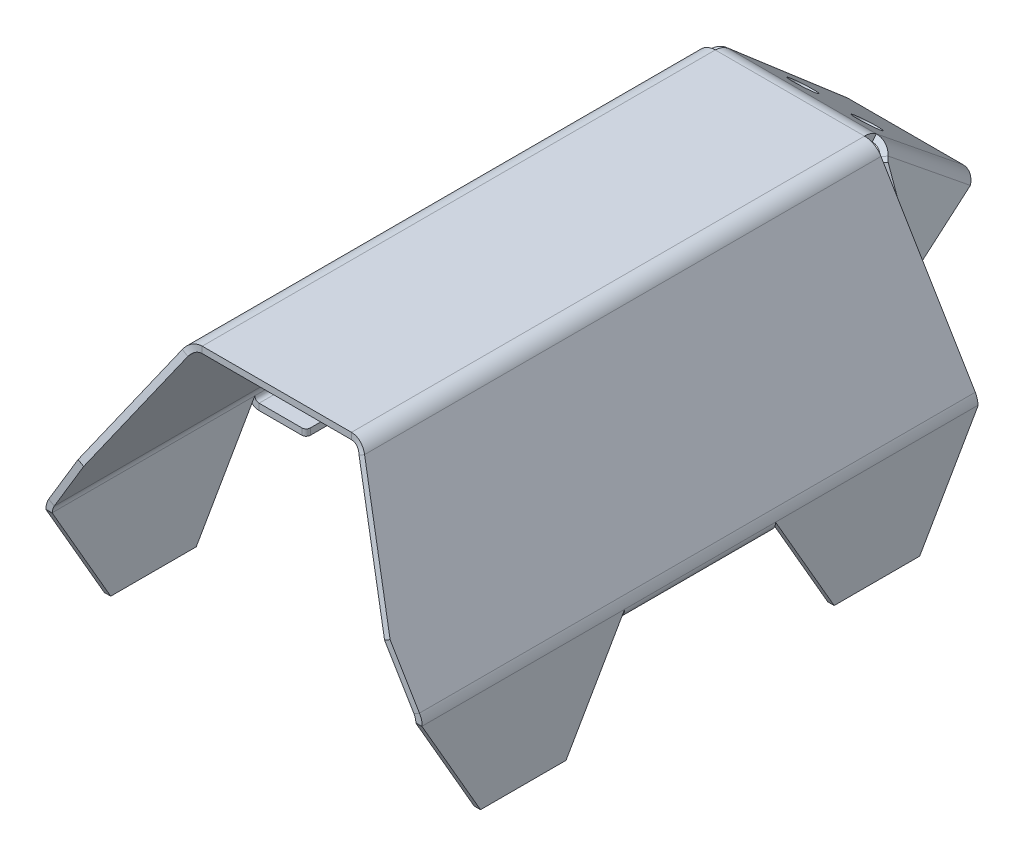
ISO-10303-21;
HEADER;
FILE_DESCRIPTION(('STEP AP214'),'2;1');
FILE_NAME('part.step','',(''),(''),'','','');
FILE_SCHEMA(('AUTOMOTIVE_DESIGN { 1 0 10303 214 1 1 1 1 }'));
ENDSEC;
DATA;
#1=APPLICATION_CONTEXT('core data for automotive mechanical design processes');
#2=APPLICATION_PROTOCOL_DEFINITION('international standard','automotive_design',2000,#1);
#3=PRODUCT_CONTEXT('',#1,'mechanical');
#4=PRODUCT('Part','Part','',(#3));
#5=PRODUCT_RELATED_PRODUCT_CATEGORY('part','',(#4));
#6=PRODUCT_DEFINITION_FORMATION('','',#4);
#7=PRODUCT_DEFINITION_CONTEXT('part definition',#1,'design');
#8=PRODUCT_DEFINITION('design','',#6,#7);
#9=PRODUCT_DEFINITION_SHAPE('','',#8);
#10=(LENGTH_UNIT() NAMED_UNIT(*) SI_UNIT(.MILLI.,.METRE.));
#11=(NAMED_UNIT(*) PLANE_ANGLE_UNIT() SI_UNIT($,.RADIAN.));
#12=(NAMED_UNIT(*) SI_UNIT($,.STERADIAN.) SOLID_ANGLE_UNIT());
#13=UNCERTAINTY_MEASURE_WITH_UNIT(LENGTH_MEASURE(1.E-05),#10,'distance_accuracy_value','');
#14=(GEOMETRIC_REPRESENTATION_CONTEXT(3) GLOBAL_UNCERTAINTY_ASSIGNED_CONTEXT((#13)) GLOBAL_UNIT_ASSIGNED_CONTEXT((#10,
#11,#12)) REPRESENTATION_CONTEXT('',''));
#15=CARTESIAN_POINT('',(0.,0.,0.));
#16=DIRECTION('',(0.,0.,1.));
#17=DIRECTION('',(1.,0.,0.));
#18=AXIS2_PLACEMENT_3D('',#15,#16,#17);
#19=CARTESIAN_POINT('',(-42.5,11.253572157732,130.));
#20=DIRECTION('',(0.,0.,1.));
#21=DIRECTION('',(1.,0.,0.));
#22=AXIS2_PLACEMENT_3D('',#19,#20,#21);
#23=PLANE('',#22);
#24=DIRECTION('',(-0.514495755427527,-0.857492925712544,0.));
#25=VECTOR('',#24,1.);
#26=CARTESIAN_POINT('',(-42.7137606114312,11.7282563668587,130.));
#27=LINE('',#26,#25);
#28=CARTESIAN_POINT('',(-35.198140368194,24.2542901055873,130.));
#29=VERTEX_POINT('',#28);
#30=CARTESIAN_POINT('',(-42.0724787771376,12.7970594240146,130.));
#31=VERTEX_POINT('',#30);
#32=EDGE_CURVE('E1079',#29,#31,#27,.T.);
#33=ORIENTED_EDGE('',*,*,#32,.F.);
#34=DIRECTION('',(-0.857492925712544,0.514495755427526,0.));
#35=VECTOR('',#34,1.);
#36=CARTESIAN_POINT('',(-36.4843797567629,25.0260337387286,130.));
#37=LINE('',#36,#35);
#38=CARTESIAN_POINT('',(-36.4843797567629,25.0260337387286,130.));
#39=VERTEX_POINT('',#38);
#40=EDGE_CURVE('E903',#39,#29,#37,.F.);
#41=ORIENTED_EDGE('',*,*,#40,.F.);
#42=DIRECTION('',(-0.514495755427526,-0.857492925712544,0.));
#43=VECTOR('',#42,1.);
#44=CARTESIAN_POINT('',(-44.,12.5,130.));
#45=LINE('',#44,#43);
#46=CARTESIAN_POINT('',(-43.3587181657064,13.5688030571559,130.));
#47=VERTEX_POINT('',#46);
#48=EDGE_CURVE('E1097',#39,#47,#45,.T.);
#49=ORIENTED_EDGE('',*,*,#48,.T.);
#50=DIRECTION('',(0.857492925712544,-0.514495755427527,0.));
#51=VECTOR('',#50,1.);
#52=CARTESIAN_POINT('',(-43.3587181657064,13.5688030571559,130.));
#53=LINE('',#52,#51);
#54=EDGE_CURVE('E13',#47,#31,#53,.T.);
#55=ORIENTED_EDGE('',*,*,#54,.T.);
#56=EDGE_LOOP('',(#33,#41,#49,#55));
#57=FACE_BOUND('',#56,.T.);
#58=ADVANCED_FACE('F154',(#57),#23,.T.);
#59=CARTESIAN_POINT('',(17.4521432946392,51.,130.));
#60=DIRECTION('',(0.,0.,1.));
#61=DIRECTION('',(1.,0.,0.));
#62=AXIS2_PLACEMENT_3D('',#59,#60,#61);
#63=PLANE('',#62);
#64=DIRECTION('',(-0.514495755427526,0.857492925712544,0.));
#65=VECTOR('',#64,1.);
#66=CARTESIAN_POINT('',(44.,12.5,130.));
#67=LINE('',#66,#65);
#68=CARTESIAN_POINT('',(43.3587181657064,13.5688030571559,130.));
#69=VERTEX_POINT('',#68);
#70=CARTESIAN_POINT('',(36.4843797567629,25.0260337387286,130.));
#71=VERTEX_POINT('',#70);
#72=EDGE_CURVE('E1094',#69,#71,#67,.T.);
#73=ORIENTED_EDGE('',*,*,#72,.T.);
#74=DIRECTION('',(0.857492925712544,0.514495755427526,0.));
#75=VECTOR('',#74,1.);
#76=CARTESIAN_POINT('',(36.4843797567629,25.0260337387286,130.));
#77=LINE('',#76,#75);
#78=CARTESIAN_POINT('',(35.198140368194,24.2542901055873,130.));
#79=VERTEX_POINT('',#78);
#80=EDGE_CURVE('E882',#71,#79,#77,.F.);
#81=ORIENTED_EDGE('',*,*,#80,.T.);
#82=DIRECTION('',(-0.514495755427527,0.857492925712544,0.));
#83=VECTOR('',#82,1.);
#84=CARTESIAN_POINT('',(42.7137606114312,11.7282563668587,130.));
#85=LINE('',#84,#83);
#86=CARTESIAN_POINT('',(42.0724787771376,12.7970594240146,130.));
#87=VERTEX_POINT('',#86);
#88=EDGE_CURVE('E1081',#87,#79,#85,.T.);
#89=ORIENTED_EDGE('',*,*,#88,.F.);
#90=DIRECTION('',(0.857492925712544,0.514495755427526,0.));
#91=VECTOR('',#90,1.);
#92=CARTESIAN_POINT('',(42.0724787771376,12.7970594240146,130.));
#93=LINE('',#92,#91);
#94=EDGE_CURVE('E1151',#87,#69,#93,.T.);
#95=ORIENTED_EDGE('',*,*,#94,.T.);
#96=EDGE_LOOP('',(#73,#81,#89,#95));
#97=FACE_BOUND('',#96,.T.);
#98=ADVANCED_FACE('F1193',(#97),#63,.T.);
#99=CARTESIAN_POINT('',(-42.7137606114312,11.7282563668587,130.));
#100=DIRECTION('',(0.857492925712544,-0.514495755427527,0.));
#101=DIRECTION('',(0.514495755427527,0.857492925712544,0.));
#102=AXIS2_PLACEMENT_3D('',#99,#100,#101);
#103=PLANE('',#102);
#104=DIRECTION('',(0.,0.,-1.));
#105=VECTOR('',#104,1.);
#106=CARTESIAN_POINT('',(-20.0246220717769,49.5434872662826,130.));
#107=LINE('',#106,#105);
#108=CARTESIAN_POINT('',(-20.0246220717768,49.5434872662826,120.795484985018));
#109=VERTEX_POINT('',#108);
#110=CARTESIAN_POINT('',(-20.0246220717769,49.5434872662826,0.));
#111=VERTEX_POINT('',#110);
#112=EDGE_CURVE('E1138',#109,#111,#107,.T.);
#113=ORIENTED_EDGE('',*,*,#112,.F.);
#114=DIRECTION('',(0.491131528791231,0.818552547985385,-0.297928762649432));
#115=VECTOR('',#114,1.);
#116=CARTESIAN_POINT('',(-42.0466625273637,12.8400865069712,134.15443035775));
#117=LINE('',#116,#115);
#118=EDGE_CURVE('E901',#29,#109,#117,.T.);
#119=ORIENTED_EDGE('',*,*,#118,.F.);
#120=ORIENTED_EDGE('',*,*,#32,.T.);
#121=DIRECTION('',(0.,0.,-1.));
#122=VECTOR('',#121,1.);
#123=CARTESIAN_POINT('',(-42.0724787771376,12.7970594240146,130.));
#124=LINE('',#123,#122);
#125=CARTESIAN_POINT('',(-42.0724787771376,12.7970594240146,0.));
#126=VERTEX_POINT('',#125);
#127=EDGE_CURVE('E1140',#31,#126,#124,.T.);
#128=ORIENTED_EDGE('',*,*,#127,.T.);
#129=DIRECTION('',(-0.514495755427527,-0.857492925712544,0.));
#130=VECTOR('',#129,1.);
#131=CARTESIAN_POINT('',(-42.7137606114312,11.7282563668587,0.));
#132=LINE('',#131,#130);
#133=EDGE_CURVE('E1028',#111,#126,#132,.T.);
#134=ORIENTED_EDGE('',*,*,#133,.F.);
#135=EDGE_LOOP('',(#113,#119,#120,#128,#134));
#136=FACE_BOUND('',#135,.T.);
#137=ADVANCED_FACE('F1199',(#136),#103,.T.);
#138=CARTESIAN_POINT('',(-17.4521432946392,48.,130.));
#139=DIRECTION('',(0.,0.,-1.));
#140=DIRECTION('',(-1.,0.,0.));
#141=AXIS2_PLACEMENT_3D('',#138,#139,#140);
#142=CYLINDRICAL_SURFACE('',#141,3.);
#143=DIRECTION('',(0.,0.,-1.));
#144=VECTOR('',#143,1.);
#145=CARTESIAN_POINT('',(-17.4521432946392,51.,130.));
#146=LINE('',#145,#144);
#147=CARTESIAN_POINT('',(-17.4521432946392,51.,120.000294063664));
#148=VERTEX_POINT('',#147);
#149=CARTESIAN_POINT('',(-17.4521432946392,51.,0.));
#150=VERTEX_POINT('',#149);
#151=EDGE_CURVE('E1135',#148,#150,#146,.T.);
#152=ORIENTED_EDGE('',*,*,#151,.F.);
#153=CARTESIAN_POINT('',(-17.4521432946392,48.,121.638160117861));
#154=DIRECTION('',(0.,-0.479190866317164,-0.877710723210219));
#155=DIRECTION('',(0.,0.877710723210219,-0.479190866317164));
#156=AXIS2_PLACEMENT_3D('',#153,#154,#155);
#157=ELLIPSE('',#156,3.41798262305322,3.);
#158=EDGE_CURVE('E869',#109,#148,#157,.T.);
#159=ORIENTED_EDGE('',*,*,#158,.F.);
#160=ORIENTED_EDGE('',*,*,#112,.T.);
#161=CARTESIAN_POINT('',(-17.4521432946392,48.,0.));
#162=DIRECTION('',(0.,0.,1.));
#163=DIRECTION('',(1.,0.,0.));
#164=AXIS2_PLACEMENT_3D('',#161,#162,#163);
#165=CIRCLE('',#164,3.);
#166=EDGE_CURVE('E1031',#150,#111,#165,.T.);
#167=ORIENTED_EDGE('',*,*,#166,.F.);
#168=EDGE_LOOP('',(#152,#159,#160,#167));
#169=FACE_BOUND('',#168,.T.);
#170=ADVANCED_FACE('F1257',(#169),#142,.F.);
#171=CARTESIAN_POINT('',(-20.,51.,130.));
#172=DIRECTION('',(0.,-1.,0.));
#173=DIRECTION('',(0.,0.,-1.));
#174=AXIS2_PLACEMENT_3D('',#171,#172,#173);
#175=PLANE('',#174);
#176=DIRECTION('',(0.,0.,-1.));
#177=VECTOR('',#176,1.);
#178=CARTESIAN_POINT('',(17.4521432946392,51.,130.));
#179=LINE('',#178,#177);
#180=CARTESIAN_POINT('',(17.4521432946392,51.,120.000294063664));
#181=VERTEX_POINT('',#180);
#182=CARTESIAN_POINT('',(17.4521432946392,51.,0.));
#183=VERTEX_POINT('',#182);
#184=EDGE_CURVE('E1132',#181,#183,#179,.T.);
#185=ORIENTED_EDGE('',*,*,#184,.F.);
#186=DIRECTION('',(1.,0.,0.));
#187=VECTOR('',#186,1.);
#188=CARTESIAN_POINT('',(-20.,51.,120.000294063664));
#189=LINE('',#188,#187);
#190=EDGE_CURVE('E890',#148,#181,#189,.T.);
#191=ORIENTED_EDGE('',*,*,#190,.F.);
#192=ORIENTED_EDGE('',*,*,#151,.T.);
#193=DIRECTION('',(1.,0.,0.));
#194=VECTOR('',#193,1.);
#195=CARTESIAN_POINT('',(-20.,51.,0.));
#196=LINE('',#195,#194);
#197=EDGE_CURVE('E1034',#183,#150,#196,.F.);
#198=ORIENTED_EDGE('',*,*,#197,.F.);
#199=EDGE_LOOP('',(#185,#191,#192,#198));
#200=FACE_BOUND('',#199,.T.);
#201=ADVANCED_FACE('F1261',(#200),#175,.T.);
#202=CARTESIAN_POINT('',(17.4521432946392,48.,130.));
#203=DIRECTION('',(0.,0.,-1.));
#204=DIRECTION('',(-1.,0.,0.));
#205=AXIS2_PLACEMENT_3D('',#202,#203,#204);
#206=CYLINDRICAL_SURFACE('',#205,3.);
#207=DIRECTION('',(0.,0.,-1.));
#208=VECTOR('',#207,1.);
#209=CARTESIAN_POINT('',(20.0246220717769,49.5434872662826,130.));
#210=LINE('',#209,#208);
#211=CARTESIAN_POINT('',(20.0246220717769,49.5434872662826,120.795484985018));
#212=VERTEX_POINT('',#211);
#213=CARTESIAN_POINT('',(20.0246220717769,49.5434872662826,0.));
#214=VERTEX_POINT('',#213);
#215=EDGE_CURVE('E1130',#212,#214,#210,.T.);
#216=ORIENTED_EDGE('',*,*,#215,.F.);
#217=CARTESIAN_POINT('',(17.4521432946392,48.,121.638160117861));
#218=DIRECTION('',(0.,-0.479190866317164,-0.877710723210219));
#219=DIRECTION('',(0.,0.877710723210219,-0.479190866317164));
#220=AXIS2_PLACEMENT_3D('',#217,#218,#219);
#221=ELLIPSE('',#220,3.41798262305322,3.);
#222=EDGE_CURVE('E874',#181,#212,#221,.T.);
#223=ORIENTED_EDGE('',*,*,#222,.F.);
#224=ORIENTED_EDGE('',*,*,#184,.T.);
#225=CARTESIAN_POINT('',(17.4521432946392,48.,0.));
#226=DIRECTION('',(0.,0.,1.));
#227=DIRECTION('',(1.,0.,0.));
#228=AXIS2_PLACEMENT_3D('',#225,#226,#227);
#229=CIRCLE('',#228,3.);
#230=EDGE_CURVE('E1036',#214,#183,#229,.T.);
#231=ORIENTED_EDGE('',*,*,#230,.F.);
#232=EDGE_LOOP('',(#216,#223,#224,#231));
#233=FACE_BOUND('',#232,.T.);
#234=ADVANCED_FACE('F1265',(#233),#206,.F.);
#235=CARTESIAN_POINT('',(42.7137606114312,11.7282563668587,130.));
#236=DIRECTION('',(-0.857492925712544,-0.514495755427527,0.));
#237=DIRECTION('',(0.514495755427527,-0.857492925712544,0.));
#238=AXIS2_PLACEMENT_3D('',#235,#236,#237);
#239=PLANE('',#238);
#240=ORIENTED_EDGE('',*,*,#88,.T.);
#241=DIRECTION('',(0.491131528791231,-0.818552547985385,0.297928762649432));
#242=VECTOR('',#241,1.);
#243=CARTESIAN_POINT('',(42.0466625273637,12.8400865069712,134.15443035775));
#244=LINE('',#243,#242);
#245=EDGE_CURVE('E879',#212,#79,#244,.T.);
#246=ORIENTED_EDGE('',*,*,#245,.F.);
#247=ORIENTED_EDGE('',*,*,#215,.T.);
#248=DIRECTION('',(-0.514495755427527,0.857492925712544,0.));
#249=VECTOR('',#248,1.);
#250=CARTESIAN_POINT('',(42.7137606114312,11.7282563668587,0.));
#251=LINE('',#250,#249);
#252=CARTESIAN_POINT('',(42.0724787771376,12.7970594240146,0.));
#253=VERTEX_POINT('',#252);
#254=EDGE_CURVE('E1039',#253,#214,#251,.T.);
#255=ORIENTED_EDGE('',*,*,#254,.F.);
#256=DIRECTION('',(0.,0.,-1.));
#257=VECTOR('',#256,1.);
#258=CARTESIAN_POINT('',(42.0724787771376,12.7970594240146,130.));
#259=LINE('',#258,#257);
#260=EDGE_CURVE('E1127',#87,#253,#259,.T.);
#261=ORIENTED_EDGE('',*,*,#260,.F.);
#262=EDGE_LOOP('',(#240,#246,#247,#255,#261));
#263=FACE_BOUND('',#262,.T.);
#264=ADVANCED_FACE('F1269',(#263),#239,.T.);
#265=CARTESIAN_POINT('',(44.,12.5,130.));
#266=DIRECTION('',(-0.857492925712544,-0.514495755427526,0.));
#267=DIRECTION('',(0.514495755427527,-0.857492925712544,0.));
#268=AXIS2_PLACEMENT_3D('',#265,#266,#267);
#269=PLANE('',#268);
#270=DIRECTION('',(0.491131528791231,-0.818552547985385,0.297928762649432));
#271=VECTOR('',#270,1.);
#272=CARTESIAN_POINT('',(43.3329019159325,13.6118301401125,134.15443035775));
#273=LINE('',#272,#271);
#274=CARTESIAN_POINT('',(21.3108614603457,50.3152308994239,120.795484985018));
#275=VERTEX_POINT('',#274);
#276=EDGE_CURVE('E876',#275,#71,#273,.T.);
#277=ORIENTED_EDGE('',*,*,#276,.T.);
#278=ORIENTED_EDGE('',*,*,#72,.F.);
#279=DIRECTION('',(0.,0.,-1.));
#280=VECTOR('',#279,1.);
#281=CARTESIAN_POINT('',(43.3587181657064,13.5688030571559,130.));
#282=LINE('',#281,#280);
#283=CARTESIAN_POINT('',(43.3587181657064,13.5688030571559,0.));
#284=VERTEX_POINT('',#283);
#285=EDGE_CURVE('E1118',#69,#284,#282,.T.);
#286=ORIENTED_EDGE('',*,*,#285,.T.);
#287=DIRECTION('',(-0.514495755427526,0.857492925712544,0.));
#288=VECTOR('',#287,1.);
#289=CARTESIAN_POINT('',(44.,12.5,0.));
#290=LINE('',#289,#288);
#291=CARTESIAN_POINT('',(21.3108614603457,50.3152308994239,0.));
#292=VERTEX_POINT('',#291);
#293=EDGE_CURVE('E1052',#284,#292,#290,.T.);
#294=ORIENTED_EDGE('',*,*,#293,.T.);
#295=DIRECTION('',(0.,0.,-1.));
#296=VECTOR('',#295,1.);
#297=CARTESIAN_POINT('',(21.3108614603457,50.3152308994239,130.));
#298=LINE('',#297,#296);
#299=EDGE_CURVE('E1116',#275,#292,#298,.T.);
#300=ORIENTED_EDGE('',*,*,#299,.F.);
#301=EDGE_LOOP('',(#277,#278,#286,#294,#300));
#302=FACE_BOUND('',#301,.T.);
#303=ADVANCED_FACE('F1273',(#302),#269,.F.);
#304=CARTESIAN_POINT('',(17.4521432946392,48.,130.));
#305=DIRECTION('',(0.,0.,-1.));
#306=DIRECTION('',(-1.,0.,0.));
#307=AXIS2_PLACEMENT_3D('',#304,#305,#306);
#308=CYLINDRICAL_SURFACE('',#307,4.5);
#309=CARTESIAN_POINT('',(17.4521432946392,48.,121.638160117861));
#310=DIRECTION('',(0.,-0.342020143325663,-0.939692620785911));
#311=DIRECTION('',(0.,0.939692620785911,-0.342020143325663));
#312=AXIS2_PLACEMENT_3D('',#309,#310,#311);
#313=ELLIPSE('',#312,4.78879997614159,4.5);
#314=CARTESIAN_POINT('',(17.4521432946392,52.5,120.000294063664));
#315=VERTEX_POINT('',#314);
#316=EDGE_CURVE('E871',#315,#275,#313,.T.);
#317=ORIENTED_EDGE('',*,*,#316,.T.);
#318=ORIENTED_EDGE('',*,*,#299,.T.);
#319=CARTESIAN_POINT('',(17.4521432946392,48.,0.));
#320=DIRECTION('',(0.,0.,1.));
#321=DIRECTION('',(1.,0.,0.));
#322=AXIS2_PLACEMENT_3D('',#319,#320,#321);
#323=CIRCLE('',#322,4.5);
#324=CARTESIAN_POINT('',(17.4521432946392,52.5,0.));
#325=VERTEX_POINT('',#324);
#326=EDGE_CURVE('E1055',#292,#325,#323,.T.);
#327=ORIENTED_EDGE('',*,*,#326,.T.);
#328=DIRECTION('',(0.,0.,-1.));
#329=VECTOR('',#328,1.);
#330=CARTESIAN_POINT('',(17.4521432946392,52.5,130.));
#331=LINE('',#330,#329);
#332=EDGE_CURVE('E1113',#315,#325,#331,.T.);
#333=ORIENTED_EDGE('',*,*,#332,.F.);
#334=EDGE_LOOP('',(#317,#318,#327,#333));
#335=FACE_BOUND('',#334,.T.);
#336=ADVANCED_FACE('F1293',(#335),#308,.T.);
#337=CARTESIAN_POINT('',(-20.,52.5,130.));
#338=DIRECTION('',(0.,-1.,0.));
#339=DIRECTION('',(0.,0.,-1.));
#340=AXIS2_PLACEMENT_3D('',#337,#338,#339);
#341=PLANE('',#340);
#342=DIRECTION('',(1.,0.,0.));
#343=VECTOR('',#342,1.);
#344=CARTESIAN_POINT('',(-20.,52.5,120.000294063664));
#345=LINE('',#344,#343);
#346=CARTESIAN_POINT('',(-17.4521432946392,52.5,120.000294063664));
#347=VERTEX_POINT('',#346);
#348=EDGE_CURVE('E885',#347,#315,#345,.T.);
#349=ORIENTED_EDGE('',*,*,#348,.T.);
#350=ORIENTED_EDGE('',*,*,#332,.T.);
#351=DIRECTION('',(-1.,0.,0.));
#352=VECTOR('',#351,1.);
#353=CARTESIAN_POINT('',(-20.,52.5,0.));
#354=LINE('',#353,#352);
#355=CARTESIAN_POINT('',(-17.4521432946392,52.5,0.));
#356=VERTEX_POINT('',#355);
#357=EDGE_CURVE('E1058',#325,#356,#354,.T.);
#358=ORIENTED_EDGE('',*,*,#357,.T.);
#359=DIRECTION('',(0.,0.,-1.));
#360=VECTOR('',#359,1.);
#361=CARTESIAN_POINT('',(-17.4521432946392,52.5,130.));
#362=LINE('',#361,#360);
#363=EDGE_CURVE('E1110',#347,#356,#362,.T.);
#364=ORIENTED_EDGE('',*,*,#363,.F.);
#365=EDGE_LOOP('',(#349,#350,#358,#364));
#366=FACE_BOUND('',#365,.T.);
#367=ADVANCED_FACE('F1297',(#366),#341,.F.);
#368=CARTESIAN_POINT('',(-17.4521432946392,48.,130.));
#369=DIRECTION('',(0.,0.,-1.));
#370=DIRECTION('',(-1.,0.,0.));
#371=AXIS2_PLACEMENT_3D('',#368,#369,#370);
#372=CYLINDRICAL_SURFACE('',#371,4.5);
#373=CARTESIAN_POINT('',(-17.4521432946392,48.,121.638160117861));
#374=DIRECTION('',(0.,-0.342020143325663,-0.939692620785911));
#375=DIRECTION('',(0.,0.939692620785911,-0.342020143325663));
#376=AXIS2_PLACEMENT_3D('',#373,#374,#375);
#377=ELLIPSE('',#376,4.78879997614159,4.5);
#378=CARTESIAN_POINT('',(-21.3108614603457,50.3152308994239,120.795484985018));
#379=VERTEX_POINT('',#378);
#380=EDGE_CURVE('E861',#379,#347,#377,.T.);
#381=ORIENTED_EDGE('',*,*,#380,.T.);
#382=ORIENTED_EDGE('',*,*,#363,.T.);
#383=CARTESIAN_POINT('',(-17.4521432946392,48.,0.));
#384=DIRECTION('',(0.,0.,1.));
#385=DIRECTION('',(1.,0.,0.));
#386=AXIS2_PLACEMENT_3D('',#383,#384,#385);
#387=CIRCLE('',#386,4.5);
#388=CARTESIAN_POINT('',(-21.3108614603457,50.3152308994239,0.));
#389=VERTEX_POINT('',#388);
#390=EDGE_CURVE('E1061',#356,#389,#387,.T.);
#391=ORIENTED_EDGE('',*,*,#390,.T.);
#392=DIRECTION('',(0.,0.,-1.));
#393=VECTOR('',#392,1.);
#394=CARTESIAN_POINT('',(-21.3108614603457,50.3152308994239,130.));
#395=LINE('',#394,#393);
#396=EDGE_CURVE('E1108',#379,#389,#395,.T.);
#397=ORIENTED_EDGE('',*,*,#396,.F.);
#398=EDGE_LOOP('',(#381,#382,#391,#397));
#399=FACE_BOUND('',#398,.T.);
#400=ADVANCED_FACE('F1301',(#399),#372,.T.);
#401=CARTESIAN_POINT('',(-44.,12.5,130.));
#402=DIRECTION('',(0.857492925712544,-0.514495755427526,0.));
#403=DIRECTION('',(0.514495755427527,0.857492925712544,0.));
#404=AXIS2_PLACEMENT_3D('',#401,#402,#403);
#405=PLANE('',#404);
#406=DIRECTION('',(0.491131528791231,0.818552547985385,-0.297928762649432));
#407=VECTOR('',#406,1.);
#408=CARTESIAN_POINT('',(-43.3329019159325,13.6118301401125,134.15443035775));
#409=LINE('',#408,#407);
#410=EDGE_CURVE('E896',#39,#379,#409,.T.);
#411=ORIENTED_EDGE('',*,*,#410,.T.);
#412=ORIENTED_EDGE('',*,*,#396,.T.);
#413=DIRECTION('',(-0.514495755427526,-0.857492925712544,0.));
#414=VECTOR('',#413,1.);
#415=CARTESIAN_POINT('',(-44.,12.5,0.));
#416=LINE('',#415,#414);
#417=CARTESIAN_POINT('',(-43.3587181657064,13.5688030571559,0.));
#418=VERTEX_POINT('',#417);
#419=EDGE_CURVE('E1064',#389,#418,#416,.T.);
#420=ORIENTED_EDGE('',*,*,#419,.T.);
#421=DIRECTION('',(0.,0.,-1.));
#422=VECTOR('',#421,1.);
#423=CARTESIAN_POINT('',(-43.3587181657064,13.5688030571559,130.));
#424=LINE('',#423,#422);
#425=EDGE_CURVE('E1105',#47,#418,#424,.T.);
#426=ORIENTED_EDGE('',*,*,#425,.F.);
#427=ORIENTED_EDGE('',*,*,#48,.F.);
#428=EDGE_LOOP('',(#411,#412,#420,#426,#427));
#429=FACE_BOUND('',#428,.T.);
#430=ADVANCED_FACE('F1213',(#429),#405,.F.);
#431=CARTESIAN_POINT('',(-42.0724787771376,12.7970594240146,0.));
#432=DIRECTION('',(0.,0.,-1.));
#433=DIRECTION('',(-1.,0.,0.));
#434=AXIS2_PLACEMENT_3D('',#431,#432,#433);
#435=PLANE('',#434);
#436=DIRECTION('',(0.,1.,0.));
#437=VECTOR('',#436,1.);
#438=CARTESIAN_POINT('',(-42.5,-12.5,0.));
#439=LINE('',#438,#437);
#440=CARTESIAN_POINT('',(-42.5,11.253572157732,0.));
#441=VERTEX_POINT('',#440);
#442=CARTESIAN_POINT('',(-42.5,11.1266066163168,0.));
#443=VERTEX_POINT('',#442);
#444=EDGE_CURVE('E1022',#441,#443,#439,.F.);
#445=ORIENTED_EDGE('',*,*,#444,.T.);
#446=DIRECTION('',(1.,0.,0.));
#447=VECTOR('',#446,1.);
#448=CARTESIAN_POINT('',(-42.5,11.1266066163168,0.));
#449=LINE('',#448,#447);
#450=CARTESIAN_POINT('',(-44.,11.1266066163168,0.));
#451=VERTEX_POINT('',#450);
#452=EDGE_CURVE('E924',#443,#451,#449,.F.);
#453=ORIENTED_EDGE('',*,*,#452,.T.);
#454=DIRECTION('',(0.,-1.,0.));
#455=VECTOR('',#454,1.);
#456=CARTESIAN_POINT('',(-44.,-12.5,0.));
#457=LINE('',#456,#455);
#458=CARTESIAN_POINT('',(-44.,11.253572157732,0.));
#459=VERTEX_POINT('',#458);
#460=EDGE_CURVE('E1017',#459,#451,#457,.T.);
#461=ORIENTED_EDGE('',*,*,#460,.F.);
#462=DIRECTION('',(1.,0.,0.));
#463=VECTOR('',#462,1.);
#464=CARTESIAN_POINT('',(-44.,11.253572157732,0.));
#465=LINE('',#464,#463);
#466=EDGE_CURVE('E1169',#459,#441,#465,.T.);
#467=ORIENTED_EDGE('',*,*,#466,.T.);
#468=EDGE_LOOP('',(#445,#453,#461,#467));
#469=FACE_BOUND('',#468,.T.);
#470=ADVANCED_FACE('F1209',(#469),#435,.T.);
#471=CARTESIAN_POINT('',(-44.,-12.5,130.));
#472=DIRECTION('',(1.,0.,0.));
#473=DIRECTION('',(0.,0.,-1.));
#474=AXIS2_PLACEMENT_3D('',#471,#472,#473);
#475=PLANE('',#474);
#476=DIRECTION('',(0.,0.86602540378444,0.499999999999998));
#477=VECTOR('',#476,1.);
#478=CARTESIAN_POINT('',(-44.,-6.59334834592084,119.769379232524));
#479=LINE('',#478,#477);
#480=CARTESIAN_POINT('',(-44.,-12.496427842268,116.36123469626));
#481=VERTEX_POINT('',#480);
#482=CARTESIAN_POINT('',(-44.,11.1266066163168,130.));
#483=VERTEX_POINT('',#482);
#484=EDGE_CURVE('E921',#481,#483,#479,.T.);
#485=ORIENTED_EDGE('',*,*,#484,.T.);
#486=DIRECTION('',(0.,-1.,0.));
#487=VECTOR('',#486,1.);
#488=CARTESIAN_POINT('',(-44.,-12.5,130.));
#489=LINE('',#488,#487);
#490=CARTESIAN_POINT('',(-44.,11.253572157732,130.));
#491=VERTEX_POINT('',#490);
#492=EDGE_CURVE('E1070',#491,#483,#489,.T.);
#493=ORIENTED_EDGE('',*,*,#492,.F.);
#494=DIRECTION('',(0.,0.,-1.));
#495=VECTOR('',#494,1.);
#496=CARTESIAN_POINT('',(-44.,11.253572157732,130.));
#497=LINE('',#496,#495);
#498=EDGE_CURVE('E1102',#491,#459,#497,.T.);
#499=ORIENTED_EDGE('',*,*,#498,.T.);
#500=ORIENTED_EDGE('',*,*,#460,.T.);
#501=DIRECTION('',(0.,-0.86602540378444,0.499999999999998));
#502=VECTOR('',#501,1.);
#503=CARTESIAN_POINT('',(-44.,-62.8849995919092,42.7306207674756));
#504=LINE('',#503,#502);
#505=CARTESIAN_POINT('',(-44.,-12.496427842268,13.6387653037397));
#506=VERTEX_POINT('',#505);
#507=EDGE_CURVE('E920',#451,#506,#504,.T.);
#508=ORIENTED_EDGE('',*,*,#507,.T.);
#509=DIRECTION('',(0.,0.,-1.));
#510=VECTOR('',#509,1.);
#511=CARTESIAN_POINT('',(-44.,-12.496427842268,130.));
#512=LINE('',#511,#510);
#513=CARTESIAN_POINT('',(-44.,-12.496427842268,33.6387653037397));
#514=VERTEX_POINT('',#513);
#515=EDGE_CURVE('E937',#506,#514,#512,.F.);
#516=ORIENTED_EDGE('',*,*,#515,.T.);
#517=DIRECTION('',(0.,0.86602540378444,0.499999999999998));
#518=VECTOR('',#517,1.);
#519=CARTESIAN_POINT('',(-44.,29.2265316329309,57.7275271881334));
#520=LINE('',#519,#518);
#521=CARTESIAN_POINT('',(-43.9999999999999,11.25,47.348771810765));
#522=VERTEX_POINT('',#521);
#523=EDGE_CURVE('E934',#514,#522,#520,.T.);
#524=ORIENTED_EDGE('',*,*,#523,.T.);
#525=DIRECTION('',(0.,0.,-1.));
#526=VECTOR('',#525,1.);
#527=CARTESIAN_POINT('',(-44.,11.25,130.));
#528=LINE('',#527,#526);
#529=CARTESIAN_POINT('',(-44.,11.25,82.651228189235));
#530=VERTEX_POINT('',#529);
#531=EDGE_CURVE('E931',#522,#530,#528,.F.);
#532=ORIENTED_EDGE('',*,*,#531,.T.);
#533=DIRECTION('',(0.,-0.86602540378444,0.499999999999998));
#534=VECTOR('',#533,1.);
#535=CARTESIAN_POINT('',(-44.,-27.0651196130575,104.772472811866));
#536=LINE('',#535,#534);
#537=CARTESIAN_POINT('',(-44.,-12.496427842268,96.3612346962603));
#538=VERTEX_POINT('',#537);
#539=EDGE_CURVE('E928',#530,#538,#536,.T.);
#540=ORIENTED_EDGE('',*,*,#539,.T.);
#541=DIRECTION('',(0.,0.,-1.));
#542=VECTOR('',#541,1.);
#543=CARTESIAN_POINT('',(-44.,-12.496427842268,130.));
#544=LINE('',#543,#542);
#545=EDGE_CURVE('E925',#538,#481,#544,.F.);
#546=ORIENTED_EDGE('',*,*,#545,.T.);
#547=EDGE_LOOP('',(#485,#493,#499,#500,#508,#516,#524,#532,#540,#546));
#548=FACE_BOUND('',#547,.T.);
#549=ADVANCED_FACE('F1212',(#548),#475,.F.);
#550=CARTESIAN_POINT('',(-42.5,-12.5,130.));
#551=DIRECTION('',(1.,0.,0.));
#552=DIRECTION('',(0.,0.,-1.));
#553=AXIS2_PLACEMENT_3D('',#550,#551,#552);
#554=PLANE('',#553);
#555=DIRECTION('',(0.,1.,0.));
#556=VECTOR('',#555,1.);
#557=CARTESIAN_POINT('',(-42.5,-12.5,130.));
#558=LINE('',#557,#556);
#559=CARTESIAN_POINT('',(-42.5,11.253572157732,130.));
#560=VERTEX_POINT('',#559);
#561=CARTESIAN_POINT('',(-42.5,11.1266066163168,130.));
#562=VERTEX_POINT('',#561);
#563=EDGE_CURVE('E1073',#560,#562,#558,.F.);
#564=ORIENTED_EDGE('',*,*,#563,.T.);
#565=DIRECTION('',(0.,0.86602540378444,0.499999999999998));
#566=VECTOR('',#565,1.);
#567=CARTESIAN_POINT('',(-42.5,-6.59334834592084,119.769379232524));
#568=LINE('',#567,#566);
#569=CARTESIAN_POINT('',(-42.5,-12.496427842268,116.36123469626));
#570=VERTEX_POINT('',#569);
#571=EDGE_CURVE('E179',#570,#562,#568,.T.);
#572=ORIENTED_EDGE('',*,*,#571,.F.);
#573=DIRECTION('',(0.,0.,1.));
#574=VECTOR('',#573,1.);
#575=CARTESIAN_POINT('',(-42.5,-12.496427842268,130.));
#576=LINE('',#575,#574);
#577=CARTESIAN_POINT('',(-42.5,-12.496427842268,96.3612346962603));
#578=VERTEX_POINT('',#577);
#579=EDGE_CURVE('E917',#578,#570,#576,.T.);
#580=ORIENTED_EDGE('',*,*,#579,.F.);
#581=DIRECTION('',(0.,-0.86602540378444,0.499999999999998));
#582=VECTOR('',#581,1.);
#583=CARTESIAN_POINT('',(-42.5,-27.0651196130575,104.772472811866));
#584=LINE('',#583,#582);
#585=CARTESIAN_POINT('',(-42.5000000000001,11.25,82.651228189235));
#586=VERTEX_POINT('',#585);
#587=EDGE_CURVE('E915',#586,#578,#584,.T.);
#588=ORIENTED_EDGE('',*,*,#587,.F.);
#589=DIRECTION('',(0.,0.,1.));
#590=VECTOR('',#589,1.);
#591=CARTESIAN_POINT('',(-42.5,11.25,130.));
#592=LINE('',#591,#590);
#593=CARTESIAN_POINT('',(-42.4999999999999,11.25,47.348771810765));
#594=VERTEX_POINT('',#593);
#595=EDGE_CURVE('E913',#594,#586,#592,.T.);
#596=ORIENTED_EDGE('',*,*,#595,.F.);
#597=DIRECTION('',(0.,0.86602540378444,0.499999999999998));
#598=VECTOR('',#597,1.);
#599=CARTESIAN_POINT('',(-42.5,29.2265316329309,57.7275271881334));
#600=LINE('',#599,#598);
#601=CARTESIAN_POINT('',(-42.5,-12.496427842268,33.6387653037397));
#602=VERTEX_POINT('',#601);
#603=EDGE_CURVE('E910',#602,#594,#600,.T.);
#604=ORIENTED_EDGE('',*,*,#603,.F.);
#605=DIRECTION('',(0.,0.,1.));
#606=VECTOR('',#605,1.);
#607=CARTESIAN_POINT('',(-42.5,-12.496427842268,130.));
#608=LINE('',#607,#606);
#609=CARTESIAN_POINT('',(-42.5,-12.496427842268,13.6387653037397));
#610=VERTEX_POINT('',#609);
#611=EDGE_CURVE('E908',#610,#602,#608,.T.);
#612=ORIENTED_EDGE('',*,*,#611,.F.);
#613=DIRECTION('',(0.,-0.86602540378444,0.499999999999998));
#614=VECTOR('',#613,1.);
#615=CARTESIAN_POINT('',(-42.5,-62.8849995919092,42.7306207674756));
#616=LINE('',#615,#614);
#617=EDGE_CURVE('E905',#443,#610,#616,.T.);
#618=ORIENTED_EDGE('',*,*,#617,.F.);
#619=ORIENTED_EDGE('',*,*,#444,.F.);
#620=DIRECTION('',(0.,0.,-1.));
#621=VECTOR('',#620,1.);
#622=CARTESIAN_POINT('',(-42.5,11.253572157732,130.));
#623=LINE('',#622,#621);
#624=EDGE_CURVE('E1143',#560,#441,#623,.T.);
#625=ORIENTED_EDGE('',*,*,#624,.F.);
#626=EDGE_LOOP('',(#564,#572,#580,#588,#596,#604,#612,#618,#619,#625));
#627=FACE_BOUND('',#626,.T.);
#628=ADVANCED_FACE('F1246',(#627),#554,.T.);
#629=CARTESIAN_POINT('',(-39.5,11.253572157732,130.));
#630=DIRECTION('',(0.,0.,1.));
#631=DIRECTION('',(1.,0.,0.));
#632=AXIS2_PLACEMENT_3D('',#629,#630,#631);
#633=PLANE('',#632);
#634=ORIENTED_EDGE('',*,*,#492,.T.);
#635=DIRECTION('',(1.,0.,0.));
#636=VECTOR('',#635,1.);
#637=CARTESIAN_POINT('',(-42.5,11.1266066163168,130.));
#638=LINE('',#637,#636);
#639=EDGE_CURVE('E942',#562,#483,#638,.F.);
#640=ORIENTED_EDGE('',*,*,#639,.F.);
#641=ORIENTED_EDGE('',*,*,#563,.F.);
#642=DIRECTION('',(-1.,0.,0.));
#643=VECTOR('',#642,1.);
#644=CARTESIAN_POINT('',(-42.5,11.253572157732,130.));
#645=LINE('',#644,#643);
#646=EDGE_CURVE('E163',#560,#491,#645,.T.);
#647=ORIENTED_EDGE('',*,*,#646,.T.);
#648=EDGE_LOOP('',(#634,#640,#641,#647));
#649=FACE_BOUND('',#648,.T.);
#650=ADVANCED_FACE('F1234',(#649),#633,.T.);
#651=CARTESIAN_POINT('',(42.0724787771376,12.7970594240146,130.));
#652=DIRECTION('',(0.,0.,1.));
#653=DIRECTION('',(1.,0.,0.));
#654=AXIS2_PLACEMENT_3D('',#651,#652,#653);
#655=PLANE('',#654);
#656=DIRECTION('',(0.,1.,0.));
#657=VECTOR('',#656,1.);
#658=CARTESIAN_POINT('',(42.5,-12.5,130.));
#659=LINE('',#658,#657);
#660=CARTESIAN_POINT('',(42.5,11.1266066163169,130.));
#661=VERTEX_POINT('',#660);
#662=CARTESIAN_POINT('',(42.5,11.253572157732,130.));
#663=VERTEX_POINT('',#662);
#664=EDGE_CURVE('E1087',#661,#663,#659,.T.);
#665=ORIENTED_EDGE('',*,*,#664,.F.);
#666=DIRECTION('',(1.,0.,0.));
#667=VECTOR('',#666,1.);
#668=CARTESIAN_POINT('',(44.,11.1266066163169,130.));
#669=LINE('',#668,#667);
#670=CARTESIAN_POINT('',(44.,11.1266066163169,130.));
#671=VERTEX_POINT('',#670);
#672=EDGE_CURVE('E1002',#671,#661,#669,.F.);
#673=ORIENTED_EDGE('',*,*,#672,.F.);
#674=DIRECTION('',(0.,1.,0.));
#675=VECTOR('',#674,1.);
#676=CARTESIAN_POINT('',(44.,-12.5,130.));
#677=LINE('',#676,#675);
#678=CARTESIAN_POINT('',(44.,11.253572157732,130.));
#679=VERTEX_POINT('',#678);
#680=EDGE_CURVE('E1089',#671,#679,#677,.T.);
#681=ORIENTED_EDGE('',*,*,#680,.T.);
#682=DIRECTION('',(-1.,0.,0.));
#683=VECTOR('',#682,1.);
#684=CARTESIAN_POINT('',(44.,11.253572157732,130.));
#685=LINE('',#684,#683);
#686=EDGE_CURVE('E1153',#679,#663,#685,.T.);
#687=ORIENTED_EDGE('',*,*,#686,.T.);
#688=EDGE_LOOP('',(#665,#673,#681,#687));
#689=FACE_BOUND('',#688,.T.);
#690=ADVANCED_FACE('F1230',(#689),#655,.T.);
#691=CARTESIAN_POINT('',(42.5,-12.5,130.));
#692=DIRECTION('',(-1.,0.,0.));
#693=DIRECTION('',(0.,0.,1.));
#694=AXIS2_PLACEMENT_3D('',#691,#692,#693);
#695=PLANE('',#694);
#696=DIRECTION('',(0.,0.,1.));
#697=VECTOR('',#696,1.);
#698=CARTESIAN_POINT('',(42.5,-12.496427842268,130.));
#699=LINE('',#698,#697);
#700=CARTESIAN_POINT('',(42.5,-12.496427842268,96.3612346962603));
#701=VERTEX_POINT('',#700);
#702=CARTESIAN_POINT('',(42.5,-12.496427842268,116.36123469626));
#703=VERTEX_POINT('',#702);
#704=EDGE_CURVE('E985',#701,#703,#699,.T.);
#705=ORIENTED_EDGE('',*,*,#704,.T.);
#706=DIRECTION('',(0.,0.86602540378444,0.499999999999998));
#707=VECTOR('',#706,1.);
#708=CARTESIAN_POINT('',(42.5,11.2598964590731,130.076954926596));
#709=LINE('',#708,#707);
#710=EDGE_CURVE('E981',#703,#661,#709,.T.);
#711=ORIENTED_EDGE('',*,*,#710,.T.);
#712=ORIENTED_EDGE('',*,*,#664,.T.);
#713=DIRECTION('',(0.,0.,-1.));
#714=VECTOR('',#713,1.);
#715=CARTESIAN_POINT('',(42.5,11.253572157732,130.));
#716=LINE('',#715,#714);
#717=CARTESIAN_POINT('',(42.5,11.253572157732,0.));
#718=VERTEX_POINT('',#717);
#719=EDGE_CURVE('E1124',#663,#718,#716,.T.);
#720=ORIENTED_EDGE('',*,*,#719,.T.);
#721=DIRECTION('',(0.,1.,0.));
#722=VECTOR('',#721,1.);
#723=CARTESIAN_POINT('',(42.5,-12.5,0.));
#724=LINE('',#723,#722);
#725=CARTESIAN_POINT('',(42.5,11.1266066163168,0.));
#726=VERTEX_POINT('',#725);
#727=EDGE_CURVE('E1045',#726,#718,#724,.T.);
#728=ORIENTED_EDGE('',*,*,#727,.F.);
#729=DIRECTION('',(0.,-0.86602540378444,0.499999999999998));
#730=VECTOR('',#729,1.);
#731=CARTESIAN_POINT('',(42.5,11.2598964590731,-0.0769549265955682));
#732=LINE('',#731,#730);
#733=CARTESIAN_POINT('',(42.5,-12.496427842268,13.6387653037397));
#734=VERTEX_POINT('',#733);
#735=EDGE_CURVE('E977',#726,#734,#732,.T.);
#736=ORIENTED_EDGE('',*,*,#735,.T.);
#737=DIRECTION('',(0.,0.,1.));
#738=VECTOR('',#737,1.);
#739=CARTESIAN_POINT('',(42.5,-12.496427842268,130.));
#740=LINE('',#739,#738);
#741=CARTESIAN_POINT('',(42.5,-12.496427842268,33.6387653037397));
#742=VERTEX_POINT('',#741);
#743=EDGE_CURVE('E980',#734,#742,#740,.T.);
#744=ORIENTED_EDGE('',*,*,#743,.T.);
#745=DIRECTION('',(0.,0.86602540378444,0.499999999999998));
#746=VECTOR('',#745,1.);
#747=CARTESIAN_POINT('',(42.5,-12.496427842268,33.6387653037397));
#748=LINE('',#747,#746);
#749=CARTESIAN_POINT('',(42.5,11.25,47.348771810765));
#750=VERTEX_POINT('',#749);
#751=EDGE_CURVE('E994',#742,#750,#748,.T.);
#752=ORIENTED_EDGE('',*,*,#751,.T.);
#753=DIRECTION('',(0.,0.,1.));
#754=VECTOR('',#753,1.);
#755=CARTESIAN_POINT('',(42.5,11.25,130.));
#756=LINE('',#755,#754);
#757=CARTESIAN_POINT('',(42.5,11.25,82.651228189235));
#758=VERTEX_POINT('',#757);
#759=EDGE_CURVE('E991',#750,#758,#756,.T.);
#760=ORIENTED_EDGE('',*,*,#759,.T.);
#761=DIRECTION('',(0.,-0.86602540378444,0.499999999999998));
#762=VECTOR('',#761,1.);
#763=CARTESIAN_POINT('',(42.5,-12.496427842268,96.3612346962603));
#764=LINE('',#763,#762);
#765=EDGE_CURVE('E988',#758,#701,#764,.T.);
#766=ORIENTED_EDGE('',*,*,#765,.T.);
#767=EDGE_LOOP('',(#705,#711,#712,#720,#728,#736,#744,#752,#760,#766));
#768=FACE_BOUND('',#767,.T.);
#769=ADVANCED_FACE('F1233',(#768),#695,.T.);
#770=CARTESIAN_POINT('',(44.,-12.5,130.));
#771=DIRECTION('',(-1.,0.,0.));
#772=DIRECTION('',(0.,0.,1.));
#773=AXIS2_PLACEMENT_3D('',#770,#771,#772);
#774=PLANE('',#773);
#775=DIRECTION('',(0.,0.86602540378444,0.499999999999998));
#776=VECTOR('',#775,1.);
#777=CARTESIAN_POINT('',(44.,11.2598964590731,130.076954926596));
#778=LINE('',#777,#776);
#779=CARTESIAN_POINT('',(44.,-12.496427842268,116.36123469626));
#780=VERTEX_POINT('',#779);
#781=EDGE_CURVE('E975',#780,#671,#778,.T.);
#782=ORIENTED_EDGE('',*,*,#781,.F.);
#783=DIRECTION('',(0.,0.,1.));
#784=VECTOR('',#783,1.);
#785=CARTESIAN_POINT('',(44.,-12.496427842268,116.36123469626));
#786=LINE('',#785,#784);
#787=CARTESIAN_POINT('',(44.,-12.496427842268,96.3612346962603));
#788=VERTEX_POINT('',#787);
#789=EDGE_CURVE('E973',#788,#780,#786,.T.);
#790=ORIENTED_EDGE('',*,*,#789,.F.);
#791=DIRECTION('',(0.,-0.86602540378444,0.499999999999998));
#792=VECTOR('',#791,1.);
#793=CARTESIAN_POINT('',(44.,-12.496427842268,96.3612346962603));
#794=LINE('',#793,#792);
#795=CARTESIAN_POINT('',(44.0000000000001,11.25,82.651228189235));
#796=VERTEX_POINT('',#795);
#797=EDGE_CURVE('E971',#796,#788,#794,.T.);
#798=ORIENTED_EDGE('',*,*,#797,.F.);
#799=DIRECTION('',(0.,0.,1.));
#800=VECTOR('',#799,1.);
#801=CARTESIAN_POINT('',(44.,11.25,47.348771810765));
#802=LINE('',#801,#800);
#803=CARTESIAN_POINT('',(44.,11.25,47.348771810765));
#804=VERTEX_POINT('',#803);
#805=EDGE_CURVE('E530',#804,#796,#802,.T.);
#806=ORIENTED_EDGE('',*,*,#805,.F.);
#807=DIRECTION('',(0.,0.86602540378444,0.499999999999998));
#808=VECTOR('',#807,1.);
#809=CARTESIAN_POINT('',(44.,-12.496427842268,33.6387653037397));
#810=LINE('',#809,#808);
#811=CARTESIAN_POINT('',(44.,-12.496427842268,33.6387653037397));
#812=VERTEX_POINT('',#811);
#813=EDGE_CURVE('E968',#812,#804,#810,.T.);
#814=ORIENTED_EDGE('',*,*,#813,.F.);
#815=DIRECTION('',(0.,0.,1.));
#816=VECTOR('',#815,1.);
#817=CARTESIAN_POINT('',(44.,-12.496427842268,13.6387653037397));
#818=LINE('',#817,#816);
#819=CARTESIAN_POINT('',(44.,-12.496427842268,13.6387653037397));
#820=VERTEX_POINT('',#819);
#821=EDGE_CURVE('E966',#820,#812,#818,.T.);
#822=ORIENTED_EDGE('',*,*,#821,.F.);
#823=DIRECTION('',(0.,-0.86602540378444,0.499999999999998));
#824=VECTOR('',#823,1.);
#825=CARTESIAN_POINT('',(44.,11.2598964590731,-0.0769549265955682));
#826=LINE('',#825,#824);
#827=CARTESIAN_POINT('',(44.,11.1266066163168,0.));
#828=VERTEX_POINT('',#827);
#829=EDGE_CURVE('E962',#828,#820,#826,.T.);
#830=ORIENTED_EDGE('',*,*,#829,.F.);
#831=DIRECTION('',(0.,1.,0.));
#832=VECTOR('',#831,1.);
#833=CARTESIAN_POINT('',(44.,-12.5,0.));
#834=LINE('',#833,#832);
#835=CARTESIAN_POINT('',(44.,11.253572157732,0.));
#836=VERTEX_POINT('',#835);
#837=EDGE_CURVE('E1047',#828,#836,#834,.T.);
#838=ORIENTED_EDGE('',*,*,#837,.T.);
#839=DIRECTION('',(0.,0.,-1.));
#840=VECTOR('',#839,1.);
#841=CARTESIAN_POINT('',(44.,11.253572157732,130.));
#842=LINE('',#841,#840);
#843=EDGE_CURVE('E1121',#679,#836,#842,.T.);
#844=ORIENTED_EDGE('',*,*,#843,.F.);
#845=ORIENTED_EDGE('',*,*,#680,.F.);
#846=EDGE_LOOP('',(#782,#790,#798,#806,#814,#822,#830,#838,#844,#845));
#847=FACE_BOUND('',#846,.T.);
#848=ADVANCED_FACE('F1281',(#847),#774,.F.);
#849=CARTESIAN_POINT('',(-39.5,11.253572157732,0.));
#850=DIRECTION('',(0.,0.,1.));
#851=DIRECTION('',(1.,0.,0.));
#852=AXIS2_PLACEMENT_3D('',#849,#850,#851);
#853=PLANE('',#852);
#854=DIRECTION('',(1.,0.,0.));
#855=VECTOR('',#854,1.);
#856=CARTESIAN_POINT('',(44.,11.1266066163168,0.));
#857=LINE('',#856,#855);
#858=EDGE_CURVE('E999',#828,#726,#857,.F.);
#859=ORIENTED_EDGE('',*,*,#858,.T.);
#860=ORIENTED_EDGE('',*,*,#727,.T.);
#861=DIRECTION('',(1.,0.,0.));
#862=VECTOR('',#861,1.);
#863=CARTESIAN_POINT('',(42.5,11.253572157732,0.));
#864=LINE('',#863,#862);
#865=EDGE_CURVE('E1146',#718,#836,#864,.T.);
#866=ORIENTED_EDGE('',*,*,#865,.T.);
#867=ORIENTED_EDGE('',*,*,#837,.F.);
#868=EDGE_LOOP('',(#859,#860,#866,#867));
#869=FACE_BOUND('',#868,.T.);
#870=ADVANCED_FACE('F1285',(#869),#853,.F.);
#871=CARTESIAN_POINT('',(-43.3587181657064,13.5688030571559,130.));
#872=DIRECTION('',(0.,0.,1.));
#873=DIRECTION('',(1.,0.,0.));
#874=AXIS2_PLACEMENT_3D('',#871,#872,#873);
#875=PLANE('',#874);
#876=ORIENTED_EDGE('',*,*,#54,.F.);
#877=CARTESIAN_POINT('',(-39.5,11.253572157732,130.));
#878=DIRECTION('',(0.,0.,1.));
#879=DIRECTION('',(1.,0.,0.));
#880=AXIS2_PLACEMENT_3D('',#877,#878,#879);
#881=CIRCLE('',#880,4.5);
#882=EDGE_CURVE('E1099',#47,#491,#881,.T.);
#883=ORIENTED_EDGE('',*,*,#882,.T.);
#884=ORIENTED_EDGE('',*,*,#646,.F.);
#885=CARTESIAN_POINT('',(-39.5,11.253572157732,130.));
#886=DIRECTION('',(0.,0.,1.));
#887=DIRECTION('',(1.,0.,0.));
#888=AXIS2_PLACEMENT_3D('',#885,#886,#887);
#889=CIRCLE('',#888,3.);
#890=EDGE_CURVE('E1076',#31,#560,#889,.T.);
#891=ORIENTED_EDGE('',*,*,#890,.F.);
#892=EDGE_LOOP('',(#876,#883,#884,#891));
#893=FACE_BOUND('',#892,.T.);
#894=ADVANCED_FACE('F156',(#893),#875,.T.);
#895=CARTESIAN_POINT('',(-44.,11.253572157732,0.));
#896=DIRECTION('',(0.,0.,-1.));
#897=DIRECTION('',(-1.,0.,0.));
#898=AXIS2_PLACEMENT_3D('',#895,#896,#897);
#899=PLANE('',#898);
#900=ORIENTED_EDGE('',*,*,#466,.F.);
#901=CARTESIAN_POINT('',(-39.5,11.253572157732,0.));
#902=DIRECTION('',(0.,0.,1.));
#903=DIRECTION('',(1.,0.,0.));
#904=AXIS2_PLACEMENT_3D('',#901,#902,#903);
#905=CIRCLE('',#904,4.5);
#906=EDGE_CURVE('E1067',#418,#459,#905,.T.);
#907=ORIENTED_EDGE('',*,*,#906,.F.);
#908=DIRECTION('',(-0.857492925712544,0.514495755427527,0.));
#909=VECTOR('',#908,1.);
#910=CARTESIAN_POINT('',(-42.0724787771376,12.7970594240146,0.));
#911=LINE('',#910,#909);
#912=EDGE_CURVE('E1167',#126,#418,#911,.T.);
#913=ORIENTED_EDGE('',*,*,#912,.F.);
#914=CARTESIAN_POINT('',(-39.5,11.253572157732,0.));
#915=DIRECTION('',(0.,0.,1.));
#916=DIRECTION('',(1.,0.,0.));
#917=AXIS2_PLACEMENT_3D('',#914,#915,#916);
#918=CIRCLE('',#917,3.);
#919=EDGE_CURVE('E1025',#126,#441,#918,.T.);
#920=ORIENTED_EDGE('',*,*,#919,.T.);
#921=EDGE_LOOP('',(#900,#907,#913,#920));
#922=FACE_BOUND('',#921,.T.);
#923=ADVANCED_FACE('F1204',(#922),#899,.T.);
#924=CARTESIAN_POINT('',(-21.3108614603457,50.3152308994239,0.));
#925=DIRECTION('',(0.,0.,-1.));
#926=DIRECTION('',(-1.,0.,0.));
#927=AXIS2_PLACEMENT_3D('',#924,#925,#926);
#928=PLANE('',#927);
#929=DIRECTION('',(0.857492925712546,-0.514495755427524,0.));
#930=VECTOR('',#929,1.);
#931=CARTESIAN_POINT('',(-21.3108614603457,50.3152308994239,0.));
#932=LINE('',#931,#930);
#933=EDGE_CURVE('E1164',#389,#111,#932,.T.);
#934=ORIENTED_EDGE('',*,*,#933,.F.);
#935=ORIENTED_EDGE('',*,*,#390,.F.);
#936=DIRECTION('',(0.,1.,0.));
#937=VECTOR('',#936,1.);
#938=CARTESIAN_POINT('',(-17.4521432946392,51.,0.));
#939=LINE('',#938,#937);
#940=EDGE_CURVE('E1161',#150,#356,#939,.T.);
#941=ORIENTED_EDGE('',*,*,#940,.F.);
#942=ORIENTED_EDGE('',*,*,#166,.T.);
#943=EDGE_LOOP('',(#934,#935,#941,#942));
#944=FACE_BOUND('',#943,.T.);
#945=ADVANCED_FACE('F1207',(#944),#928,.T.);
#946=CARTESIAN_POINT('',(-17.4521432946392,51.,0.));
#947=DIRECTION('',(0.,0.,-1.));
#948=DIRECTION('',(-1.,0.,0.));
#949=AXIS2_PLACEMENT_3D('',#946,#947,#948);
#950=PLANE('',#949);
#951=ORIENTED_EDGE('',*,*,#419,.F.);
#952=ORIENTED_EDGE('',*,*,#933,.T.);
#953=ORIENTED_EDGE('',*,*,#133,.T.);
#954=ORIENTED_EDGE('',*,*,#912,.T.);
#955=EDGE_LOOP('',(#951,#952,#953,#954));
#956=FACE_BOUND('',#955,.T.);
#957=ADVANCED_FACE('F1217',(#956),#950,.T.);
#958=CARTESIAN_POINT('',(17.4521432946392,52.5,0.));
#959=DIRECTION('',(0.,0.,-1.));
#960=DIRECTION('',(-1.,0.,0.));
#961=AXIS2_PLACEMENT_3D('',#958,#959,#960);
#962=PLANE('',#961);
#963=DIRECTION('',(0.,-1.,0.));
#964=VECTOR('',#963,1.);
#965=CARTESIAN_POINT('',(17.4521432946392,52.5,0.));
#966=LINE('',#965,#964);
#967=EDGE_CURVE('E1159',#325,#183,#966,.T.);
#968=ORIENTED_EDGE('',*,*,#967,.F.);
#969=ORIENTED_EDGE('',*,*,#326,.F.);
#970=DIRECTION('',(0.857492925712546,0.514495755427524,0.));
#971=VECTOR('',#970,1.);
#972=CARTESIAN_POINT('',(20.0246220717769,49.5434872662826,0.));
#973=LINE('',#972,#971);
#974=EDGE_CURVE('E1156',#214,#292,#973,.T.);
#975=ORIENTED_EDGE('',*,*,#974,.F.);
#976=ORIENTED_EDGE('',*,*,#230,.T.);
#977=EDGE_LOOP('',(#968,#969,#975,#976));
#978=FACE_BOUND('',#977,.T.);
#979=ADVANCED_FACE('F1220',(#978),#962,.T.);
#980=CARTESIAN_POINT('',(44.,11.253572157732,130.));
#981=DIRECTION('',(0.,0.,1.));
#982=DIRECTION('',(1.,0.,0.));
#983=AXIS2_PLACEMENT_3D('',#980,#981,#982);
#984=PLANE('',#983);
#985=ORIENTED_EDGE('',*,*,#686,.F.);
#986=CARTESIAN_POINT('',(39.5,11.253572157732,130.));
#987=DIRECTION('',(0.,0.,1.));
#988=DIRECTION('',(1.,0.,0.));
#989=AXIS2_PLACEMENT_3D('',#986,#987,#988);
#990=CIRCLE('',#989,4.5);
#991=EDGE_CURVE('E1091',#679,#69,#990,.T.);
#992=ORIENTED_EDGE('',*,*,#991,.T.);
#993=ORIENTED_EDGE('',*,*,#94,.F.);
#994=CARTESIAN_POINT('',(39.5,11.253572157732,130.));
#995=DIRECTION('',(0.,0.,1.));
#996=DIRECTION('',(1.,0.,0.));
#997=AXIS2_PLACEMENT_3D('',#994,#995,#996);
#998=CIRCLE('',#997,3.);
#999=EDGE_CURVE('E1084',#663,#87,#998,.T.);
#1000=ORIENTED_EDGE('',*,*,#999,.F.);
#1001=EDGE_LOOP('',(#985,#992,#993,#1000));
#1002=FACE_BOUND('',#1001,.T.);
#1003=ADVANCED_FACE('F1224',(#1002),#984,.T.);
#1004=CARTESIAN_POINT('',(43.3587181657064,13.5688030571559,0.));
#1005=DIRECTION('',(0.,0.,-1.));
#1006=DIRECTION('',(-1.,0.,0.));
#1007=AXIS2_PLACEMENT_3D('',#1004,#1005,#1006);
#1008=PLANE('',#1007);
#1009=DIRECTION('',(-0.857492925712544,-0.514495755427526,0.));
#1010=VECTOR('',#1009,1.);
#1011=CARTESIAN_POINT('',(43.3587181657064,13.5688030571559,0.));
#1012=LINE('',#1011,#1010);
#1013=EDGE_CURVE('E1149',#284,#253,#1012,.T.);
#1014=ORIENTED_EDGE('',*,*,#1013,.F.);
#1015=CARTESIAN_POINT('',(39.5,11.253572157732,0.));
#1016=DIRECTION('',(0.,0.,1.));
#1017=DIRECTION('',(1.,0.,0.));
#1018=AXIS2_PLACEMENT_3D('',#1015,#1016,#1017);
#1019=CIRCLE('',#1018,4.5);
#1020=EDGE_CURVE('E1049',#836,#284,#1019,.T.);
#1021=ORIENTED_EDGE('',*,*,#1020,.F.);
#1022=ORIENTED_EDGE('',*,*,#865,.F.);
#1023=CARTESIAN_POINT('',(39.5,11.253572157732,0.));
#1024=DIRECTION('',(0.,0.,1.));
#1025=DIRECTION('',(1.,0.,0.));
#1026=AXIS2_PLACEMENT_3D('',#1023,#1024,#1025);
#1027=CIRCLE('',#1026,3.);
#1028=EDGE_CURVE('E1042',#718,#253,#1027,.T.);
#1029=ORIENTED_EDGE('',*,*,#1028,.T.);
#1030=EDGE_LOOP('',(#1014,#1021,#1022,#1029));
#1031=FACE_BOUND('',#1030,.T.);
#1032=ADVANCED_FACE('F1228',(#1031),#1008,.T.);
#1033=CARTESIAN_POINT('',(42.5,11.253572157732,0.));
#1034=DIRECTION('',(0.,0.,-1.));
#1035=DIRECTION('',(-1.,0.,0.));
#1036=AXIS2_PLACEMENT_3D('',#1033,#1034,#1035);
#1037=PLANE('',#1036);
#1038=ORIENTED_EDGE('',*,*,#293,.F.);
#1039=ORIENTED_EDGE('',*,*,#1013,.T.);
#1040=ORIENTED_EDGE('',*,*,#254,.T.);
#1041=ORIENTED_EDGE('',*,*,#974,.T.);
#1042=EDGE_LOOP('',(#1038,#1039,#1040,#1041));
#1043=FACE_BOUND('',#1042,.T.);
#1044=ADVANCED_FACE('F1238',(#1043),#1037,.T.);
#1045=CARTESIAN_POINT('',(-39.5,11.253572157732,130.));
#1046=DIRECTION('',(0.,0.,-1.));
#1047=DIRECTION('',(-1.,0.,0.));
#1048=AXIS2_PLACEMENT_3D('',#1045,#1046,#1047);
#1049=CYLINDRICAL_SURFACE('',#1048,3.);
#1050=ORIENTED_EDGE('',*,*,#919,.F.);
#1051=ORIENTED_EDGE('',*,*,#127,.F.);
#1052=ORIENTED_EDGE('',*,*,#890,.T.);
#1053=ORIENTED_EDGE('',*,*,#624,.T.);
#1054=EDGE_LOOP('',(#1050,#1051,#1052,#1053));
#1055=FACE_BOUND('',#1054,.T.);
#1056=ADVANCED_FACE('F1242',(#1055),#1049,.F.);
#1057=CARTESIAN_POINT('',(39.5,11.253572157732,130.));
#1058=DIRECTION('',(0.,0.,-1.));
#1059=DIRECTION('',(-1.,0.,0.));
#1060=AXIS2_PLACEMENT_3D('',#1057,#1058,#1059);
#1061=CYLINDRICAL_SURFACE('',#1060,3.);
#1062=ORIENTED_EDGE('',*,*,#1028,.F.);
#1063=ORIENTED_EDGE('',*,*,#719,.F.);
#1064=ORIENTED_EDGE('',*,*,#999,.T.);
#1065=ORIENTED_EDGE('',*,*,#260,.T.);
#1066=EDGE_LOOP('',(#1062,#1063,#1064,#1065));
#1067=FACE_BOUND('',#1066,.T.);
#1068=ADVANCED_FACE('F1253',(#1067),#1061,.F.);
#1069=CARTESIAN_POINT('',(39.5,11.253572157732,130.));
#1070=DIRECTION('',(0.,0.,-1.));
#1071=DIRECTION('',(-1.,0.,0.));
#1072=AXIS2_PLACEMENT_3D('',#1069,#1070,#1071);
#1073=CYLINDRICAL_SURFACE('',#1072,4.5);
#1074=ORIENTED_EDGE('',*,*,#1020,.T.);
#1075=ORIENTED_EDGE('',*,*,#285,.F.);
#1076=ORIENTED_EDGE('',*,*,#991,.F.);
#1077=ORIENTED_EDGE('',*,*,#843,.T.);
#1078=EDGE_LOOP('',(#1074,#1075,#1076,#1077));
#1079=FACE_BOUND('',#1078,.T.);
#1080=ADVANCED_FACE('F1277',(#1079),#1073,.T.);
#1081=CARTESIAN_POINT('',(-39.5,11.253572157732,130.));
#1082=DIRECTION('',(0.,0.,-1.));
#1083=DIRECTION('',(-1.,0.,0.));
#1084=AXIS2_PLACEMENT_3D('',#1081,#1082,#1083);
#1085=CYLINDRICAL_SURFACE('',#1084,4.5);
#1086=ORIENTED_EDGE('',*,*,#906,.T.);
#1087=ORIENTED_EDGE('',*,*,#498,.F.);
#1088=ORIENTED_EDGE('',*,*,#882,.F.);
#1089=ORIENTED_EDGE('',*,*,#425,.T.);
#1090=EDGE_LOOP('',(#1086,#1087,#1088,#1089));
#1091=FACE_BOUND('',#1090,.T.);
#1092=ADVANCED_FACE('F1289',(#1091),#1085,.T.);
#1093=CARTESIAN_POINT('',(44.,-12.496427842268,33.6387653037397));
#1094=DIRECTION('',(0.,-0.499999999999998,0.86602540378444));
#1095=DIRECTION('',(0.,0.86602540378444,0.499999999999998));
#1096=AXIS2_PLACEMENT_3D('',#1093,#1094,#1095);
#1097=PLANE('',#1096);
#1098=DIRECTION('',(1.,0.,0.));
#1099=VECTOR('',#1098,1.);
#1100=CARTESIAN_POINT('',(44.,-12.496427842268,33.6387653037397));
#1101=LINE('',#1100,#1099);
#1102=EDGE_CURVE('E1014',#812,#742,#1101,.F.);
#1103=ORIENTED_EDGE('',*,*,#1102,.F.);
#1104=ORIENTED_EDGE('',*,*,#813,.T.);
#1105=DIRECTION('',(1.,0.,0.));
#1106=VECTOR('',#1105,1.);
#1107=CARTESIAN_POINT('',(44.,11.25,47.348771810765));
#1108=LINE('',#1107,#1106);
#1109=EDGE_CURVE('E1012',#804,#750,#1108,.F.);
#1110=ORIENTED_EDGE('',*,*,#1109,.T.);
#1111=ORIENTED_EDGE('',*,*,#751,.F.);
#1112=EDGE_LOOP('',(#1103,#1104,#1110,#1111));
#1113=FACE_BOUND('',#1112,.T.);
#1114=ADVANCED_FACE('F1311',(#1113),#1097,.T.);
#1115=CARTESIAN_POINT('',(44.,-12.496427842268,96.3612346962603));
#1116=DIRECTION('',(0.,-0.499999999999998,-0.86602540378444));
#1117=DIRECTION('',(0.,-0.86602540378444,0.499999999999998));
#1118=AXIS2_PLACEMENT_3D('',#1115,#1116,#1117);
#1119=PLANE('',#1118);
#1120=DIRECTION('',(1.,0.,0.));
#1121=VECTOR('',#1120,1.);
#1122=CARTESIAN_POINT('',(44.,11.25,82.651228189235));
#1123=LINE('',#1122,#1121);
#1124=EDGE_CURVE('E1010',#796,#758,#1123,.F.);
#1125=ORIENTED_EDGE('',*,*,#1124,.F.);
#1126=ORIENTED_EDGE('',*,*,#797,.T.);
#1127=DIRECTION('',(1.,0.,0.));
#1128=VECTOR('',#1127,1.);
#1129=CARTESIAN_POINT('',(44.,-12.496427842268,96.3612346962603));
#1130=LINE('',#1129,#1128);
#1131=EDGE_CURVE('E1007',#788,#701,#1130,.F.);
#1132=ORIENTED_EDGE('',*,*,#1131,.T.);
#1133=ORIENTED_EDGE('',*,*,#765,.F.);
#1134=EDGE_LOOP('',(#1125,#1126,#1132,#1133));
#1135=FACE_BOUND('',#1134,.T.);
#1136=ADVANCED_FACE('F1327',(#1135),#1119,.T.);
#1137=CARTESIAN_POINT('',(44.,-12.496427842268,116.36123469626));
#1138=DIRECTION('',(0.,-1.,0.));
#1139=DIRECTION('',(0.,0.,1.));
#1140=AXIS2_PLACEMENT_3D('',#1137,#1138,#1139);
#1141=PLANE('',#1140);
#1142=ORIENTED_EDGE('',*,*,#1131,.F.);
#1143=ORIENTED_EDGE('',*,*,#789,.T.);
#1144=DIRECTION('',(1.,0.,0.));
#1145=VECTOR('',#1144,1.);
#1146=CARTESIAN_POINT('',(44.,-12.496427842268,116.36123469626));
#1147=LINE('',#1146,#1145);
#1148=EDGE_CURVE('E1004',#780,#703,#1147,.F.);
#1149=ORIENTED_EDGE('',*,*,#1148,.T.);
#1150=ORIENTED_EDGE('',*,*,#704,.F.);
#1151=EDGE_LOOP('',(#1142,#1143,#1149,#1150));
#1152=FACE_BOUND('',#1151,.T.);
#1153=ADVANCED_FACE('F1331',(#1152),#1141,.T.);
#1154=CARTESIAN_POINT('',(44.,11.2598964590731,130.076954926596));
#1155=DIRECTION('',(0.,-0.499999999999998,0.86602540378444));
#1156=DIRECTION('',(0.,0.86602540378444,0.499999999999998));
#1157=AXIS2_PLACEMENT_3D('',#1154,#1155,#1156);
#1158=PLANE('',#1157);
#1159=ORIENTED_EDGE('',*,*,#1148,.F.);
#1160=ORIENTED_EDGE('',*,*,#781,.T.);
#1161=ORIENTED_EDGE('',*,*,#672,.T.);
#1162=ORIENTED_EDGE('',*,*,#710,.F.);
#1163=EDGE_LOOP('',(#1159,#1160,#1161,#1162));
#1164=FACE_BOUND('',#1163,.T.);
#1165=ADVANCED_FACE('F1335',(#1164),#1158,.T.);
#1166=CARTESIAN_POINT('',(44.,11.2598964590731,-0.0769549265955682));
#1167=DIRECTION('',(0.,-0.499999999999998,-0.86602540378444));
#1168=DIRECTION('',(0.,-0.86602540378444,0.499999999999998));
#1169=AXIS2_PLACEMENT_3D('',#1166,#1167,#1168);
#1170=PLANE('',#1169);
#1171=ORIENTED_EDGE('',*,*,#858,.F.);
#1172=ORIENTED_EDGE('',*,*,#829,.T.);
#1173=DIRECTION('',(1.,0.,0.));
#1174=VECTOR('',#1173,1.);
#1175=CARTESIAN_POINT('',(44.,-12.496427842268,13.6387653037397));
#1176=LINE('',#1175,#1174);
#1177=EDGE_CURVE('E984',#820,#734,#1176,.F.);
#1178=ORIENTED_EDGE('',*,*,#1177,.T.);
#1179=ORIENTED_EDGE('',*,*,#735,.F.);
#1180=EDGE_LOOP('',(#1171,#1172,#1178,#1179));
#1181=FACE_BOUND('',#1180,.T.);
#1182=ADVANCED_FACE('F1323',(#1181),#1170,.T.);
#1183=CARTESIAN_POINT('',(44.,-12.496427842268,13.6387653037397));
#1184=DIRECTION('',(0.,-1.,0.));
#1185=DIRECTION('',(0.,0.,1.));
#1186=AXIS2_PLACEMENT_3D('',#1183,#1184,#1185);
#1187=PLANE('',#1186);
#1188=ORIENTED_EDGE('',*,*,#821,.T.);
#1189=ORIENTED_EDGE('',*,*,#1102,.T.);
#1190=ORIENTED_EDGE('',*,*,#743,.F.);
#1191=ORIENTED_EDGE('',*,*,#1177,.F.);
#1192=EDGE_LOOP('',(#1188,#1189,#1190,#1191));
#1193=FACE_BOUND('',#1192,.T.);
#1194=ADVANCED_FACE('F1319',(#1193),#1187,.T.);
#1195=CARTESIAN_POINT('',(-42.5,-12.496427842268,130.));
#1196=DIRECTION('',(0.,1.,0.));
#1197=DIRECTION('',(0.,0.,1.));
#1198=AXIS2_PLACEMENT_3D('',#1195,#1196,#1197);
#1199=PLANE('',#1198);
#1200=DIRECTION('',(1.,0.,0.));
#1201=VECTOR('',#1200,1.);
#1202=CARTESIAN_POINT('',(-42.5,-12.496427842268,13.6387653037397));
#1203=LINE('',#1202,#1201);
#1204=EDGE_CURVE('E959',#610,#506,#1203,.F.);
#1205=ORIENTED_EDGE('',*,*,#1204,.F.);
#1206=ORIENTED_EDGE('',*,*,#611,.T.);
#1207=DIRECTION('',(1.,0.,0.));
#1208=VECTOR('',#1207,1.);
#1209=CARTESIAN_POINT('',(-42.5,-12.496427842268,33.6387653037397));
#1210=LINE('',#1209,#1208);
#1211=EDGE_CURVE('E956',#602,#514,#1210,.F.);
#1212=ORIENTED_EDGE('',*,*,#1211,.T.);
#1213=ORIENTED_EDGE('',*,*,#515,.F.);
#1214=EDGE_LOOP('',(#1205,#1206,#1212,#1213));
#1215=FACE_BOUND('',#1214,.T.);
#1216=ADVANCED_FACE('F1322',(#1215),#1199,.F.);
#1217=CARTESIAN_POINT('',(-42.5,29.2265316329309,57.7275271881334));
#1218=DIRECTION('',(0.,0.499999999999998,-0.86602540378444));
#1219=DIRECTION('',(0.,0.86602540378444,0.499999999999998));
#1220=AXIS2_PLACEMENT_3D('',#1217,#1218,#1219);
#1221=PLANE('',#1220);
#1222=ORIENTED_EDGE('',*,*,#1211,.F.);
#1223=ORIENTED_EDGE('',*,*,#603,.T.);
#1224=DIRECTION('',(1.,0.,0.));
#1225=VECTOR('',#1224,1.);
#1226=CARTESIAN_POINT('',(-42.5,11.25,47.348771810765));
#1227=LINE('',#1226,#1225);
#1228=EDGE_CURVE('E953',#594,#522,#1227,.F.);
#1229=ORIENTED_EDGE('',*,*,#1228,.T.);
#1230=ORIENTED_EDGE('',*,*,#523,.F.);
#1231=EDGE_LOOP('',(#1222,#1223,#1229,#1230));
#1232=FACE_BOUND('',#1231,.T.);
#1233=ADVANCED_FACE('F1350',(#1232),#1221,.F.);
#1234=CARTESIAN_POINT('',(-42.5,-27.0651196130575,104.772472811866));
#1235=DIRECTION('',(0.,0.499999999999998,0.86602540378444));
#1236=DIRECTION('',(0.,-0.86602540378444,0.499999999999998));
#1237=AXIS2_PLACEMENT_3D('',#1234,#1235,#1236);
#1238=PLANE('',#1237);
#1239=DIRECTION('',(1.,0.,0.));
#1240=VECTOR('',#1239,1.);
#1241=CARTESIAN_POINT('',(-42.5,11.25,82.651228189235));
#1242=LINE('',#1241,#1240);
#1243=EDGE_CURVE('E950',#586,#530,#1242,.F.);
#1244=ORIENTED_EDGE('',*,*,#1243,.F.);
#1245=ORIENTED_EDGE('',*,*,#587,.T.);
#1246=DIRECTION('',(1.,0.,0.));
#1247=VECTOR('',#1246,1.);
#1248=CARTESIAN_POINT('',(-42.5,-12.496427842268,96.3612346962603));
#1249=LINE('',#1248,#1247);
#1250=EDGE_CURVE('E947',#578,#538,#1249,.F.);
#1251=ORIENTED_EDGE('',*,*,#1250,.T.);
#1252=ORIENTED_EDGE('',*,*,#539,.F.);
#1253=EDGE_LOOP('',(#1244,#1245,#1251,#1252));
#1254=FACE_BOUND('',#1253,.T.);
#1255=ADVANCED_FACE('F1354',(#1254),#1238,.F.);
#1256=CARTESIAN_POINT('',(-42.5,-12.496427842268,130.));
#1257=DIRECTION('',(0.,1.,0.));
#1258=DIRECTION('',(0.,0.,1.));
#1259=AXIS2_PLACEMENT_3D('',#1256,#1257,#1258);
#1260=PLANE('',#1259);
#1261=ORIENTED_EDGE('',*,*,#1250,.F.);
#1262=ORIENTED_EDGE('',*,*,#579,.T.);
#1263=DIRECTION('',(1.,0.,0.));
#1264=VECTOR('',#1263,1.);
#1265=CARTESIAN_POINT('',(-42.5,-12.496427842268,116.36123469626));
#1266=LINE('',#1265,#1264);
#1267=EDGE_CURVE('E944',#570,#481,#1266,.F.);
#1268=ORIENTED_EDGE('',*,*,#1267,.T.);
#1269=ORIENTED_EDGE('',*,*,#545,.F.);
#1270=EDGE_LOOP('',(#1261,#1262,#1268,#1269));
#1271=FACE_BOUND('',#1270,.T.);
#1272=ADVANCED_FACE('F1358',(#1271),#1260,.F.);
#1273=CARTESIAN_POINT('',(-42.5,-6.59334834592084,119.769379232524));
#1274=DIRECTION('',(0.,0.499999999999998,-0.86602540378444));
#1275=DIRECTION('',(0.,0.86602540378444,0.499999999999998));
#1276=AXIS2_PLACEMENT_3D('',#1273,#1274,#1275);
#1277=PLANE('',#1276);
#1278=ORIENTED_EDGE('',*,*,#1267,.F.);
#1279=ORIENTED_EDGE('',*,*,#571,.T.);
#1280=ORIENTED_EDGE('',*,*,#639,.T.);
#1281=ORIENTED_EDGE('',*,*,#484,.F.);
#1282=EDGE_LOOP('',(#1278,#1279,#1280,#1281));
#1283=FACE_BOUND('',#1282,.T.);
#1284=ADVANCED_FACE('F1346',(#1283),#1277,.F.);
#1285=CARTESIAN_POINT('',(-42.5,-62.8849995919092,42.7306207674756));
#1286=DIRECTION('',(0.,0.499999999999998,0.86602540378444));
#1287=DIRECTION('',(0.,-0.86602540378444,0.499999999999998));
#1288=AXIS2_PLACEMENT_3D('',#1285,#1286,#1287);
#1289=PLANE('',#1288);
#1290=ORIENTED_EDGE('',*,*,#617,.T.);
#1291=ORIENTED_EDGE('',*,*,#1204,.T.);
#1292=ORIENTED_EDGE('',*,*,#507,.F.);
#1293=ORIENTED_EDGE('',*,*,#452,.F.);
#1294=EDGE_LOOP('',(#1290,#1291,#1292,#1293));
#1295=FACE_BOUND('',#1294,.T.);
#1296=ADVANCED_FACE('F1343',(#1295),#1289,.F.);
#1297=CARTESIAN_POINT('',(-43.3329019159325,13.6118301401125,134.15443035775));
#1298=DIRECTION('',(-0.153283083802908,-0.255471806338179,-0.954588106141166));
#1299=DIRECTION('',(0.491131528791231,0.818552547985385,-0.297928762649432));
#1300=AXIS2_PLACEMENT_3D('',#1297,#1298,#1299);
#1301=PLANE('',#1300);
#1302=DIRECTION('',(-0.857492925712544,0.514495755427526,0.));
#1303=VECTOR('',#1302,1.);
#1304=CARTESIAN_POINT('',(-21.3108614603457,50.3152308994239,120.795484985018));
#1305=LINE('',#1304,#1303);
#1306=EDGE_CURVE('E171',#379,#109,#1305,.F.);
#1307=ORIENTED_EDGE('',*,*,#1306,.F.);
#1308=ORIENTED_EDGE('',*,*,#410,.F.);
#1309=ORIENTED_EDGE('',*,*,#40,.T.);
#1310=ORIENTED_EDGE('',*,*,#118,.T.);
#1311=EDGE_LOOP('',(#1307,#1308,#1309,#1310));
#1312=FACE_BOUND('',#1311,.T.);
#1313=ADVANCED_FACE('F1345',(#1312),#1301,.F.);
#1314=CARTESIAN_POINT('',(-20.,52.5,120.000294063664));
#1315=DIRECTION('',(0.,0.,-1.));
#1316=DIRECTION('',(1.,0.,0.));
#1317=AXIS2_PLACEMENT_3D('',#1314,#1315,#1316);
#1318=PLANE('',#1317);
#1319=DIRECTION('',(0.,1.,0.));
#1320=VECTOR('',#1319,1.);
#1321=CARTESIAN_POINT('',(17.4521432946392,52.5,120.000294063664));
#1322=LINE('',#1321,#1320);
#1323=EDGE_CURVE('E893',#315,#181,#1322,.F.);
#1324=ORIENTED_EDGE('',*,*,#1323,.F.);
#1325=ORIENTED_EDGE('',*,*,#348,.F.);
#1326=DIRECTION('',(0.,1.,0.));
#1327=VECTOR('',#1326,1.);
#1328=CARTESIAN_POINT('',(-17.4521432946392,52.5,120.000294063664));
#1329=LINE('',#1328,#1327);
#1330=EDGE_CURVE('E892',#347,#148,#1329,.F.);
#1331=ORIENTED_EDGE('',*,*,#1330,.T.);
#1332=ORIENTED_EDGE('',*,*,#190,.T.);
#1333=EDGE_LOOP('',(#1324,#1325,#1331,#1332));
#1334=FACE_BOUND('',#1333,.T.);
#1335=ADVANCED_FACE('F1367',(#1334),#1318,.F.);
#1336=CARTESIAN_POINT('',(43.3329019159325,13.6118301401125,134.15443035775));
#1337=DIRECTION('',(0.153283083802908,-0.255471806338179,-0.954588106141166));
#1338=DIRECTION('',(0.491131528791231,-0.818552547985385,0.297928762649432));
#1339=AXIS2_PLACEMENT_3D('',#1336,#1337,#1338);
#1340=PLANE('',#1339);
#1341=ORIENTED_EDGE('',*,*,#80,.F.);
#1342=ORIENTED_EDGE('',*,*,#276,.F.);
#1343=DIRECTION('',(0.857492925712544,0.514495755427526,0.));
#1344=VECTOR('',#1343,1.);
#1345=CARTESIAN_POINT('',(21.3108614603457,50.3152308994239,120.795484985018));
#1346=LINE('',#1345,#1344);
#1347=EDGE_CURVE('E881',#275,#212,#1346,.F.);
#1348=ORIENTED_EDGE('',*,*,#1347,.T.);
#1349=ORIENTED_EDGE('',*,*,#245,.T.);
#1350=EDGE_LOOP('',(#1341,#1342,#1348,#1349));
#1351=FACE_BOUND('',#1350,.T.);
#1352=ADVANCED_FACE('F1370',(#1351),#1340,.F.);
#1353=CARTESIAN_POINT('',(17.4521432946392,51.,120.000294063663));
#1354=CARTESIAN_POINT('',(17.4521432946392,51.5,120.000294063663));
#1355=CARTESIAN_POINT('',(17.4521432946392,52.,120.000294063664));
#1356=CARTESIAN_POINT('',(17.4521432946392,52.5,120.000294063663));
#1357=CARTESIAN_POINT('',(23.4521432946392,51.,120.000294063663));
#1358=CARTESIAN_POINT('',(24.4521432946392,51.5,120.000294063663));
#1359=CARTESIAN_POINT('',(25.4521432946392,52.,120.000294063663));
#1360=CARTESIAN_POINT('',(26.4521432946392,52.5,120.000294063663));
#1361=CARTESIAN_POINT('',(23.4521432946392,45.,123.276026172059));
#1362=CARTESIAN_POINT('',(24.4521432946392,44.5,123.276026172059));
#1363=CARTESIAN_POINT('',(25.4521432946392,44.,123.276026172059));
#1364=CARTESIAN_POINT('',(26.4521432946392,43.5,123.276026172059));
#1365=CARTESIAN_POINT('',(17.4521432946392,45.,123.276026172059));
#1366=CARTESIAN_POINT('',(17.4521432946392,44.5,123.276026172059));
#1367=CARTESIAN_POINT('',(17.4521432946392,44.,123.276026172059));
#1368=CARTESIAN_POINT('',(17.4521432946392,43.5,123.276026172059));
#1369=CARTESIAN_POINT('',(11.4521432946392,45.,123.276026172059));
#1370=CARTESIAN_POINT('',(10.4521432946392,44.5,123.276026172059));
#1371=CARTESIAN_POINT('',(9.45214329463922,44.,123.276026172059));
#1372=CARTESIAN_POINT('',(8.45214329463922,43.5,123.276026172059));
#1373=CARTESIAN_POINT('',(11.4521432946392,51.,120.000294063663));
#1374=CARTESIAN_POINT('',(10.4521432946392,51.5,120.000294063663));
#1375=CARTESIAN_POINT('',(9.45214329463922,52.,120.000294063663));
#1376=CARTESIAN_POINT('',(8.45214329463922,52.5,120.000294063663));
#1377=CARTESIAN_POINT('',(17.4521432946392,51.,120.000294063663));
#1378=CARTESIAN_POINT('',(17.4521432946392,51.5,120.000294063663));
#1379=CARTESIAN_POINT('',(17.4521432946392,52.,120.000294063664));
#1380=CARTESIAN_POINT('',(17.4521432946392,52.5,120.000294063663));
#1381=(BOUNDED_SURFACE() B_SPLINE_SURFACE(3,3,((#1353,#1354,#1355,#1356),(#1357,#1358,#1359,
#1360),(#1361,#1362,#1363,#1364),(#1365,#1366,#1367,#1368),(#1369,#1370,#1371,#1372),(#1373,
#1374,#1375,#1376),(#1377,#1378,#1379,#1380)),.UNSPECIFIED.,.T.,.F.,
.F.) B_SPLINE_SURFACE_WITH_KNOTS((4,3,4),(4,4),(0.,0.5,1.),(0.,1.),
.UNSPECIFIED.) GEOMETRIC_REPRESENTATION_ITEM() RATIONAL_B_SPLINE_SURFACE(((1.,1.,1.,1.),
(0.333333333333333,0.333333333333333,0.333333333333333,0.333333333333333),(0.333333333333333,
0.333333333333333,0.333333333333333,0.333333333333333),(1.,1.,1.,1.),(0.333333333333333,
0.333333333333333,0.333333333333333,0.333333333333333),(0.333333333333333,0.333333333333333,
0.333333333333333,0.333333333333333),(1.,1.,1.,1.))) REPRESENTATION_ITEM('') SURFACE());
#1382=ORIENTED_EDGE('',*,*,#1347,.F.);
#1383=ORIENTED_EDGE('',*,*,#316,.F.);
#1384=ORIENTED_EDGE('',*,*,#1323,.T.);
#1385=ORIENTED_EDGE('',*,*,#222,.T.);
#1386=EDGE_LOOP('',(#1382,#1383,#1384,#1385));
#1387=FACE_BOUND('',#1386,.T.);
#1388=ADVANCED_FACE('F1374',(#1387),#1381,.T.);
#1389=CARTESIAN_POINT('',(-17.4521432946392,51.,120.000294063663));
#1390=CARTESIAN_POINT('',(-17.4521432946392,51.5,120.000294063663));
#1391=CARTESIAN_POINT('',(-17.4521432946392,52.,120.000294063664));
#1392=CARTESIAN_POINT('',(-17.4521432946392,52.5,120.000294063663));
#1393=CARTESIAN_POINT('',(-11.4521432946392,51.,120.000294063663));
#1394=CARTESIAN_POINT('',(-10.4521432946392,51.5,120.000294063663));
#1395=CARTESIAN_POINT('',(-9.45214329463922,52.,120.000294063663));
#1396=CARTESIAN_POINT('',(-8.45214329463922,52.5,120.000294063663));
#1397=CARTESIAN_POINT('',(-11.4521432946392,45.,123.276026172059));
#1398=CARTESIAN_POINT('',(-10.4521432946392,44.5,123.276026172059));
#1399=CARTESIAN_POINT('',(-9.45214329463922,44.,123.276026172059));
#1400=CARTESIAN_POINT('',(-8.45214329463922,43.5,123.276026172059));
#1401=CARTESIAN_POINT('',(-17.4521432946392,45.,123.276026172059));
#1402=CARTESIAN_POINT('',(-17.4521432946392,44.5,123.276026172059));
#1403=CARTESIAN_POINT('',(-17.4521432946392,44.,123.276026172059));
#1404=CARTESIAN_POINT('',(-17.4521432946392,43.5,123.276026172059));
#1405=CARTESIAN_POINT('',(-23.4521432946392,45.,123.276026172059));
#1406=CARTESIAN_POINT('',(-24.4521432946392,44.5,123.276026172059));
#1407=CARTESIAN_POINT('',(-25.4521432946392,44.,123.276026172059));
#1408=CARTESIAN_POINT('',(-26.4521432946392,43.5,123.276026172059));
#1409=CARTESIAN_POINT('',(-23.4521432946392,51.,120.000294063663));
#1410=CARTESIAN_POINT('',(-24.4521432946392,51.5,120.000294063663));
#1411=CARTESIAN_POINT('',(-25.4521432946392,52.,120.000294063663));
#1412=CARTESIAN_POINT('',(-26.4521432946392,52.5,120.000294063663));
#1413=CARTESIAN_POINT('',(-17.4521432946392,51.,120.000294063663));
#1414=CARTESIAN_POINT('',(-17.4521432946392,51.5,120.000294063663));
#1415=CARTESIAN_POINT('',(-17.4521432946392,52.,120.000294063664));
#1416=CARTESIAN_POINT('',(-17.4521432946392,52.5,120.000294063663));
#1417=(BOUNDED_SURFACE() B_SPLINE_SURFACE(3,3,((#1389,#1390,#1391,#1392),(#1393,#1394,#1395,
#1396),(#1397,#1398,#1399,#1400),(#1401,#1402,#1403,#1404),(#1405,#1406,#1407,#1408),(#1409,
#1410,#1411,#1412),(#1413,#1414,#1415,#1416)),.UNSPECIFIED.,.T.,.F.,
.F.) B_SPLINE_SURFACE_WITH_KNOTS((4,3,4),(4,4),(0.,0.5,1.),(0.,1.),
.UNSPECIFIED.) GEOMETRIC_REPRESENTATION_ITEM() RATIONAL_B_SPLINE_SURFACE(((1.,1.,1.,1.),
(0.333333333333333,0.333333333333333,0.333333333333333,0.333333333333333),(0.333333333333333,
0.333333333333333,0.333333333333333,0.333333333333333),(1.,1.,1.,1.),(0.333333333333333,
0.333333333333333,0.333333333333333,0.333333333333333),(0.333333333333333,0.333333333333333,
0.333333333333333,0.333333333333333),(1.,1.,1.,1.))) REPRESENTATION_ITEM('') SURFACE());
#1418=ORIENTED_EDGE('',*,*,#1330,.F.);
#1419=ORIENTED_EDGE('',*,*,#380,.F.);
#1420=ORIENTED_EDGE('',*,*,#1306,.T.);
#1421=ORIENTED_EDGE('',*,*,#158,.T.);
#1422=EDGE_LOOP('',(#1418,#1419,#1420,#1421));
#1423=FACE_BOUND('',#1422,.T.);
#1424=ADVANCED_FACE('F1380',(#1423),#1417,.T.);
#1425=CARTESIAN_POINT('',(-17.4521432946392,52.5,0.));
#1426=CARTESIAN_POINT('',(-17.4302011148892,52.5,-0.523657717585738));
#1427=CARTESIAN_POINT('',(-17.4082638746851,52.4076981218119,-1.04706873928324));
#1428=CARTESIAN_POINT('',(-17.364384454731,52.0495354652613,-2.03111255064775));
#1429=CARTESIAN_POINT('',(-17.3424472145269,51.7838006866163,-2.49139915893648));
#1430=CARTESIAN_POINT('',(-17.3205050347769,51.4471999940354,-2.89254424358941));
#1431=CARTESIAN_POINT('',(-17.4521432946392,51.,0.));
#1432=CARTESIAN_POINT('',(-17.4302011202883,51.,-0.349105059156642));
#1433=CARTESIAN_POINT('',(-17.4082638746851,50.9384654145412,-0.698045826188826));
#1434=CARTESIAN_POINT('',(-17.364384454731,50.6996903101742,-1.35407503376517));
#1435=CARTESIAN_POINT('',(-17.3424472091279,50.5225337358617,-1.66093283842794));
#1436=CARTESIAN_POINT('',(-17.3205050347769,50.2981333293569,-1.9283628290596));
#1437=B_SPLINE_SURFACE_WITH_KNOTS('',1,3,((#1425,#1426,#1427,#1428,#1429,#1430),(#1431,#1432,
#1433,#1434,#1435,#1436)),.UNSPECIFIED.,.F.,.F.,.F.,(2,2),(4,2,4),(0.,1.),(0.,0.5,1.),.UNSPECIFIED.);
#1438=DIRECTION('',(0.,0.766044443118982,-0.642787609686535));
#1439=VECTOR('',#1438,1.);
#1440=CARTESIAN_POINT('',(-17.3205050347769,51.4471999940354,-2.8925442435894));
#1441=LINE('',#1440,#1439);
#1442=CARTESIAN_POINT('',(-17.3205050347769,50.2981333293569,-1.9283628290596));
#1443=VERTEX_POINT('',#1442);
#1444=CARTESIAN_POINT('',(-17.3205050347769,51.4471999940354,-2.8925442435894));
#1445=VERTEX_POINT('',#1444);
#1446=EDGE_CURVE('E819',#1443,#1445,#1441,.T.);
#1447=CARTESIAN_POINT('',(-17.4521432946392,51.,0.));
#1448=CARTESIAN_POINT('',(-17.4494008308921,51.0000006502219,-0.0436332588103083));
#1449=CARTESIAN_POINT('',(-17.4466583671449,50.9990480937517,-0.0872664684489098));
#1450=CARTESIAN_POINT('',(-17.4411734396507,50.9952412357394,-0.174449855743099));
#1451=CARTESIAN_POINT('',(-17.4384309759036,50.9923869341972,-0.218000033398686));
#1452=CARTESIAN_POINT('',(-17.4329460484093,50.9847812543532,-0.304934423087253));
#1453=CARTESIAN_POINT('',(-17.4302035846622,50.9800298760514,-0.348318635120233));
#1454=CARTESIAN_POINT('',(-17.4247186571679,50.9686392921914,-0.434838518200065));
#1455=CARTESIAN_POINT('',(-17.4219761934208,50.9620000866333,-0.477974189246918));
#1456=CARTESIAN_POINT('',(-17.4164912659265,50.94684643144,-0.563914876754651));
#1457=CARTESIAN_POINT('',(-17.4137488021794,50.9383319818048,-0.606719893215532));
#1458=CARTESIAN_POINT('',(-17.4082638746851,50.9194440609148,-0.69191779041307));
#1459=CARTESIAN_POINT('',(-17.405521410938,50.9090705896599,-0.734310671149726));
#1460=CARTESIAN_POINT('',(-17.4000364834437,50.8864843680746,-0.818603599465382));
#1461=CARTESIAN_POINT('',(-17.3972940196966,50.8742716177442,-0.860503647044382));
#1462=CARTESIAN_POINT('',(-17.3918090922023,50.8480300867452,-0.943731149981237));
#1463=CARTESIAN_POINT('',(-17.3890666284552,50.8340013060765,-0.985058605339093));
#1464=CARTESIAN_POINT('',(-17.3835817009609,50.8041544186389,-1.0670622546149));
#1465=CARTESIAN_POINT('',(-17.3808392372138,50.78833631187,-1.10773844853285));
#1466=CARTESIAN_POINT('',(-17.3753543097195,50.7549408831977,-1.18836214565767));
#1467=CARTESIAN_POINT('',(-17.3726118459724,50.7373635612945,-1.22830964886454));
#1468=CARTESIAN_POINT('',(-17.3671269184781,50.7004831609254,-1.30739992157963));
#1469=CARTESIAN_POINT('',(-17.364384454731,50.6811800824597,-1.34654269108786));
#1470=CARTESIAN_POINT('',(-17.3588995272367,50.6408849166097,-1.42394898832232));
#1471=CARTESIAN_POINT('',(-17.3561570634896,50.6198928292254,-1.46221251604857));
#1472=CARTESIAN_POINT('',(-17.3506721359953,50.5762595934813,-1.53778748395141));
#1473=CARTESIAN_POINT('',(-17.3479296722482,50.5536184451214,-1.57509892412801));
#1474=CARTESIAN_POINT('',(-17.342444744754,50.506730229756,-1.64869872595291));
#1475=CARTESIAN_POINT('',(-17.3397022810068,50.4824831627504,-1.68498708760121));
#1476=CARTESIAN_POINT('',(-17.3342173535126,50.4324291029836,-1.75647153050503));
#1477=CARTESIAN_POINT('',(-17.3314748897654,50.4066221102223,-1.79166761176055));
#1478=CARTESIAN_POINT('',(-17.3259899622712,50.3534979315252,-1.86090096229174));
#1479=CARTESIAN_POINT('',(-17.323247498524,50.3261807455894,-1.8949382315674));
#1480=CARTESIAN_POINT('',(-17.3205050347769,50.2981333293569,-1.9283628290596));
#1481=B_SPLINE_CURVE_WITH_KNOTS('',3,(#1447,#1448,#1449,#1450,#1451,#1452,#1453,#1454,#1455,
#1456,#1457,#1458,#1459,#1460,#1461,#1462,#1463,#1464,#1465,#1466,#1467,#1468,#1469,#1470,#1471,
#1472,#1473,#1474,#1475,#1476,#1477,#1478,#1479,#1480),.UNSPECIFIED.,.F.,.F.,(4,2,2,2,2,2,2,2,2,
2,2,2,2,2,2,2,4),(0.,0.131147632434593,0.262295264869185,0.393442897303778,0.52459052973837,
0.655738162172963,0.786885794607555,0.918033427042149,1.04918105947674,1.18032869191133,
1.31147632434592,1.44262395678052,1.57377158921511,1.7049192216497,1.8360668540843,
1.96721448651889,2.09836211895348),.UNSPECIFIED.);
#1482=EDGE_CURVE('E822',#150,#1443,#1481,.T.);
#1483=CARTESIAN_POINT('',(-17.4521432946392,52.5,0.));
#1484=CARTESIAN_POINT('',(-17.4494008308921,52.5000009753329,-0.0654498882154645));
#1485=CARTESIAN_POINT('',(-17.4466583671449,52.4985721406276,-0.130899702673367));
#1486=CARTESIAN_POINT('',(-17.4411734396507,52.4928618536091,-0.26167478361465));
#1487=CARTESIAN_POINT('',(-17.4384309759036,52.4885804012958,-0.327000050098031));
#1488=CARTESIAN_POINT('',(-17.4329460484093,52.4771718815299,-0.457401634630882));
#1489=CARTESIAN_POINT('',(-17.4302035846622,52.4700448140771,-0.522477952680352));
#1490=CARTESIAN_POINT('',(-17.4247186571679,52.4529589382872,-0.6522577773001));
#1491=CARTESIAN_POINT('',(-17.4219761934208,52.4430001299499,-0.716961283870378));
#1492=CARTESIAN_POINT('',(-17.4164912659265,52.42026964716,-0.845872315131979));
#1493=CARTESIAN_POINT('',(-17.4137488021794,52.4074979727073,-0.910079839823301));
#1494=CARTESIAN_POINT('',(-17.4082638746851,52.3791660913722,-1.03787668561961));
#1495=CARTESIAN_POINT('',(-17.405521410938,52.3636058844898,-1.10146600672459));
#1496=CARTESIAN_POINT('',(-17.4000364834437,52.3297265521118,-1.22790539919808));
#1497=CARTESIAN_POINT('',(-17.3972940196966,52.3114074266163,-1.29075547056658));
#1498=CARTESIAN_POINT('',(-17.3918090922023,52.2720451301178,-1.41559672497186));
#1499=CARTESIAN_POINT('',(-17.3890666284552,52.2510019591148,-1.47758790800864));
#1500=CARTESIAN_POINT('',(-17.3835817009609,52.2062316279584,-1.60059338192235));
#1501=CARTESIAN_POINT('',(-17.3808392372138,52.182504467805,-1.66160767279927));
#1502=CARTESIAN_POINT('',(-17.3753543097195,52.1324113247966,-1.78254321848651));
#1503=CARTESIAN_POINT('',(-17.3726118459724,52.1060453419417,-1.84246447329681));
#1504=CARTESIAN_POINT('',(-17.3671269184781,52.0507247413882,-1.96109988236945));
#1505=CARTESIAN_POINT('',(-17.364384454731,52.0217701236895,-2.01981403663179));
#1506=CARTESIAN_POINT('',(-17.3588995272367,51.9613273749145,-2.13592348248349));
#1507=CARTESIAN_POINT('',(-17.3561570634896,51.9298392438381,-2.19331877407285));
#1508=CARTESIAN_POINT('',(-17.3506721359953,51.8643893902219,-2.30668122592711));
#1509=CARTESIAN_POINT('',(-17.3479296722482,51.8304276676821,-2.36264838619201));
#1510=CARTESIAN_POINT('',(-17.3424447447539,51.7600953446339,-2.47304808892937));
#1511=CARTESIAN_POINT('',(-17.3397022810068,51.7237247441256,-2.52748063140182));
#1512=CARTESIAN_POINT('',(-17.3342173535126,51.6486436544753,-2.63470729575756));
#1513=CARTESIAN_POINT('',(-17.3314748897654,51.6099331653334,-2.68750141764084));
#1514=CARTESIAN_POINT('',(-17.3259899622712,51.5302468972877,-2.79135144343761));
#1515=CARTESIAN_POINT('',(-17.323247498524,51.489271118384,-2.84240734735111));
#1516=CARTESIAN_POINT('',(-17.3205050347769,51.4471999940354,-2.89254424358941));
#1517=B_SPLINE_CURVE_WITH_KNOTS('',3,(#1483,#1484,#1485,#1486,#1487,#1488,#1489,#1490,#1491,
#1492,#1493,#1494,#1495,#1496,#1497,#1498,#1499,#1500,#1501,#1502,#1503,#1504,#1505,#1506,#1507,
#1508,#1509,#1510,#1511,#1512,#1513,#1514,#1515,#1516),.UNSPECIFIED.,.F.,.F.,(4,2,2,2,2,2,2,2,2,
2,2,2,2,2,2,2,4),(0.,0.196506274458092,0.393012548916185,0.589518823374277,0.786025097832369,
0.98253137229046,1.17903764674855,1.37554392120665,1.57205019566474,1.76855647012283,
1.96506274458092,2.16156901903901,2.35807529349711,2.5545815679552,2.75108784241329,
2.94759411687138,3.14410039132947),.UNSPECIFIED.);
#1518=EDGE_CURVE('E828',#356,#1445,#1517,.T.);
#1519=ORIENTED_EDGE('',*,*,#1446,.F.);
#1520=ORIENTED_EDGE('',*,*,#1482,.F.);
#1521=ORIENTED_EDGE('',*,*,#940,.T.);
#1522=ORIENTED_EDGE('',*,*,#1518,.T.);
#1523=EDGE_LOOP('',(#1519,#1520,#1521,#1522));
#1524=FACE_BOUND('',#1523,.T.);
#1525=ADVANCED_FACE('F1391',(#1524),#1437,.F.);
#1526=CARTESIAN_POINT('',(17.3205050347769,51.4471999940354,-2.89254424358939));
#1527=CARTESIAN_POINT('',(17.3424472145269,51.7838006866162,-2.49139915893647));
#1528=CARTESIAN_POINT('',(17.364384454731,52.0495354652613,-2.03111255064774));
#1529=CARTESIAN_POINT('',(17.4082638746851,52.4076981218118,-1.04706873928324));
#1530=CARTESIAN_POINT('',(17.4302011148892,52.5,-0.523657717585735));
#1531=CARTESIAN_POINT('',(17.4521432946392,52.5,0.));
#1532=CARTESIAN_POINT('',(17.3205050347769,50.2981333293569,-1.92836282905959));
#1533=CARTESIAN_POINT('',(17.3424472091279,50.5225337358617,-1.66093283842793));
#1534=CARTESIAN_POINT('',(17.364384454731,50.6996903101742,-1.35407503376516));
#1535=CARTESIAN_POINT('',(17.4082638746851,50.9384654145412,-0.698045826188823));
#1536=CARTESIAN_POINT('',(17.4302011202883,51.,-0.34910505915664));
#1537=CARTESIAN_POINT('',(17.4521432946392,51.,0.));
#1538=B_SPLINE_SURFACE_WITH_KNOTS('',1,3,((#1526,#1527,#1528,#1529,#1530,#1531),(#1532,#1533,
#1534,#1535,#1536,#1537)),.UNSPECIFIED.,.F.,.F.,.F.,(2,2),(4,2,4),(0.,1.),(0.,0.5,1.),.UNSPECIFIED.);
#1539=CARTESIAN_POINT('',(17.3205050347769,50.2981333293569,-1.92836282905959));
#1540=CARTESIAN_POINT('',(17.323247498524,50.3261807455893,-1.89493823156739));
#1541=CARTESIAN_POINT('',(17.3259899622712,50.3534979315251,-1.86090096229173));
#1542=CARTESIAN_POINT('',(17.3314748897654,50.4066221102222,-1.79166761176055));
#1543=CARTESIAN_POINT('',(17.3342173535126,50.4324291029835,-1.75647153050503));
#1544=CARTESIAN_POINT('',(17.3397022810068,50.4824831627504,-1.6849870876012));
#1545=CARTESIAN_POINT('',(17.342444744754,50.5067302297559,-1.6486987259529));
#1546=CARTESIAN_POINT('',(17.3479296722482,50.5536184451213,-1.575098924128));
#1547=CARTESIAN_POINT('',(17.3506721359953,50.5762595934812,-1.5377874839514));
#1548=CARTESIAN_POINT('',(17.3561570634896,50.6198928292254,-1.46221251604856));
#1549=CARTESIAN_POINT('',(17.3588995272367,50.6408849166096,-1.42394898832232));
#1550=CARTESIAN_POINT('',(17.364384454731,50.6811800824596,-1.34654269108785));
#1551=CARTESIAN_POINT('',(17.3671269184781,50.7004831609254,-1.30739992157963));
#1552=CARTESIAN_POINT('',(17.3726118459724,50.7373635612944,-1.22830964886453));
#1553=CARTESIAN_POINT('',(17.3753543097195,50.7549408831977,-1.18836214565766));
#1554=CARTESIAN_POINT('',(17.3808392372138,50.7883363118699,-1.10773844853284));
#1555=CARTESIAN_POINT('',(17.3835817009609,50.8041544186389,-1.06706225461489));
#1556=CARTESIAN_POINT('',(17.3890666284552,50.8340013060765,-0.985058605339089));
#1557=CARTESIAN_POINT('',(17.3918090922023,50.8480300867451,-0.943731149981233));
#1558=CARTESIAN_POINT('',(17.3972940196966,50.8742716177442,-0.860503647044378));
#1559=CARTESIAN_POINT('',(17.4000364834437,50.8864843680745,-0.818603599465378));
#1560=CARTESIAN_POINT('',(17.405521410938,50.9090705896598,-0.734310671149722));
#1561=CARTESIAN_POINT('',(17.4082638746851,50.9194440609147,-0.691917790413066));
#1562=CARTESIAN_POINT('',(17.4137488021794,50.9383319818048,-0.60671989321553));
#1563=CARTESIAN_POINT('',(17.4164912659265,50.9468464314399,-0.563914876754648));
#1564=CARTESIAN_POINT('',(17.4219761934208,50.9620000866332,-0.477974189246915));
#1565=CARTESIAN_POINT('',(17.4247186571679,50.9686392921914,-0.434838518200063));
#1566=CARTESIAN_POINT('',(17.4302035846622,50.9800298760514,-0.348318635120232));
#1567=CARTESIAN_POINT('',(17.4329460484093,50.9847812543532,-0.304934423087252));
#1568=CARTESIAN_POINT('',(17.4384309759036,50.9923869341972,-0.218000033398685));
#1569=CARTESIAN_POINT('',(17.4411734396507,50.9952412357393,-0.174449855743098));
#1570=CARTESIAN_POINT('',(17.446658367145,50.9990480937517,-0.0872664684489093));
#1571=CARTESIAN_POINT('',(17.4494008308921,51.0000006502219,-0.0436332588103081));
#1572=CARTESIAN_POINT('',(17.4521432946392,51.,0.));
#1573=B_SPLINE_CURVE_WITH_KNOTS('',3,(#1539,#1540,#1541,#1542,#1543,#1544,#1545,#1546,#1547,
#1548,#1549,#1550,#1551,#1552,#1553,#1554,#1555,#1556,#1557,#1558,#1559,#1560,#1561,#1562,#1563,
#1564,#1565,#1566,#1567,#1568,#1569,#1570,#1571,#1572),.UNSPECIFIED.,.F.,.F.,(4,2,2,2,2,2,2,2,2,
2,2,2,2,2,2,2,4),(0.,0.131147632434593,0.262295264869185,0.393442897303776,0.524590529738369,
0.655738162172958,0.786885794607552,0.918033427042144,1.04918105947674,1.18032869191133,
1.31147632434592,1.44262395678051,1.5737715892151,1.7049192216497,1.83606685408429,
1.96721448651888,2.09836211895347),.UNSPECIFIED.);
#1574=CARTESIAN_POINT('',(17.3205050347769,50.2981333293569,-1.9283628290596));
#1575=VERTEX_POINT('',#1574);
#1576=EDGE_CURVE('E792',#1575,#183,#1573,.T.);
#1577=DIRECTION('',(0.,0.766044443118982,-0.642787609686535));
#1578=VECTOR('',#1577,1.);
#1579=CARTESIAN_POINT('',(17.3205050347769,50.2981333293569,-1.92836282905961));
#1580=LINE('',#1579,#1578);
#1581=CARTESIAN_POINT('',(17.3205050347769,51.4471999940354,-2.89254424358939));
#1582=VERTEX_POINT('',#1581);
#1583=EDGE_CURVE('E814',#1575,#1582,#1580,.T.);
#1584=CARTESIAN_POINT('',(17.3205050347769,51.4471999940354,-2.8925442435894));
#1585=CARTESIAN_POINT('',(17.323247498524,51.489271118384,-2.8424073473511));
#1586=CARTESIAN_POINT('',(17.3259899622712,51.5302468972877,-2.7913514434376));
#1587=CARTESIAN_POINT('',(17.3314748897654,51.6099331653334,-2.68750141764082));
#1588=CARTESIAN_POINT('',(17.3342173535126,51.6486436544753,-2.63470729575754));
#1589=CARTESIAN_POINT('',(17.3397022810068,51.7237247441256,-2.52748063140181));
#1590=CARTESIAN_POINT('',(17.342444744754,51.7600953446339,-2.47304808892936));
#1591=CARTESIAN_POINT('',(17.3479296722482,51.830427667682,-2.362648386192));
#1592=CARTESIAN_POINT('',(17.3506721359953,51.8643893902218,-2.30668122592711));
#1593=CARTESIAN_POINT('',(17.3561570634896,51.9298392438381,-2.19331877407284));
#1594=CARTESIAN_POINT('',(17.3588995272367,51.9613273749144,-2.13592348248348));
#1595=CARTESIAN_POINT('',(17.364384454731,52.0217701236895,-2.01981403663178));
#1596=CARTESIAN_POINT('',(17.3671269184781,52.0507247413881,-1.96109988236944));
#1597=CARTESIAN_POINT('',(17.3726118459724,52.1060453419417,-1.8424644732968));
#1598=CARTESIAN_POINT('',(17.3753543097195,52.1324113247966,-1.7825432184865));
#1599=CARTESIAN_POINT('',(17.3808392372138,52.1825044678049,-1.66160767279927));
#1600=CARTESIAN_POINT('',(17.3835817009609,52.2062316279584,-1.60059338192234));
#1601=CARTESIAN_POINT('',(17.3890666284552,52.2510019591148,-1.47758790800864));
#1602=CARTESIAN_POINT('',(17.3918090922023,52.2720451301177,-1.41559672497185));
#1603=CARTESIAN_POINT('',(17.3972940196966,52.3114074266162,-1.29075547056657));
#1604=CARTESIAN_POINT('',(17.4000364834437,52.3297265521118,-1.22790539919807));
#1605=CARTESIAN_POINT('',(17.405521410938,52.3636058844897,-1.10146600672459));
#1606=CARTESIAN_POINT('',(17.4082638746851,52.3791660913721,-1.0378766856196));
#1607=CARTESIAN_POINT('',(17.4137488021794,52.4074979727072,-0.910079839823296));
#1608=CARTESIAN_POINT('',(17.4164912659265,52.4202696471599,-0.845872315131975));
#1609=CARTESIAN_POINT('',(17.4219761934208,52.4430001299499,-0.716961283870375));
#1610=CARTESIAN_POINT('',(17.4247186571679,52.4529589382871,-0.652257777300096));
#1611=CARTESIAN_POINT('',(17.4302035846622,52.4700448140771,-0.522477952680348));
#1612=CARTESIAN_POINT('',(17.4329460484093,52.4771718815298,-0.45740163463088));
#1613=CARTESIAN_POINT('',(17.4384309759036,52.4885804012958,-0.327000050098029));
#1614=CARTESIAN_POINT('',(17.4411734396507,52.4928618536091,-0.261674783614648));
#1615=CARTESIAN_POINT('',(17.446658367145,52.4985721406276,-0.130899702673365));
#1616=CARTESIAN_POINT('',(17.4494008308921,52.5000009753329,-0.0654498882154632));
#1617=CARTESIAN_POINT('',(17.4521432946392,52.5,0.));
#1618=B_SPLINE_CURVE_WITH_KNOTS('',3,(#1584,#1585,#1586,#1587,#1588,#1589,#1590,#1591,#1592,
#1593,#1594,#1595,#1596,#1597,#1598,#1599,#1600,#1601,#1602,#1603,#1604,#1605,#1606,#1607,#1608,
#1609,#1610,#1611,#1612,#1613,#1614,#1615,#1616,#1617),.UNSPECIFIED.,.F.,.F.,(4,2,2,2,2,2,2,2,2,
2,2,2,2,2,2,2,4),(0.,0.196506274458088,0.39301254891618,0.589518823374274,0.786025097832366,
0.982531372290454,1.17903764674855,1.37554392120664,1.57205019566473,1.76855647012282,
1.96506274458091,2.161569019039,2.35807529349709,2.55458156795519,2.75108784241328,
2.94759411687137,3.14410039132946),.UNSPECIFIED.);
#1619=EDGE_CURVE('E827',#1582,#325,#1618,.T.);
#1620=ORIENTED_EDGE('',*,*,#1576,.F.);
#1621=ORIENTED_EDGE('',*,*,#1583,.T.);
#1622=ORIENTED_EDGE('',*,*,#1619,.T.);
#1623=ORIENTED_EDGE('',*,*,#967,.T.);
#1624=EDGE_LOOP('',(#1620,#1621,#1622,#1623));
#1625=FACE_BOUND('',#1624,.T.);
#1626=ADVANCED_FACE('F844',(#1625),#1538,.F.);
#1627=CARTESIAN_POINT('',(17.4521432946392,48.,0.));
#1628=DIRECTION('',(1.,0.,0.));
#1629=DIRECTION('',(0.,0.766044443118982,-0.642787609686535));
#1630=AXIS2_PLACEMENT_3D('',#1627,#1628,#1629);
#1631=CYLINDRICAL_SURFACE('',#1630,4.49999999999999);
#1632=ORIENTED_EDGE('',*,*,#357,.F.);
#1633=ORIENTED_EDGE('',*,*,#1619,.F.);
#1634=DIRECTION('',(1.,0.,0.));
#1635=VECTOR('',#1634,1.);
#1636=CARTESIAN_POINT('',(17.4521432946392,51.4471999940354,-2.89254424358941));
#1637=LINE('',#1636,#1635);
#1638=EDGE_CURVE('E812',#1445,#1582,#1637,.T.);
#1639=ORIENTED_EDGE('',*,*,#1638,.F.);
#1640=ORIENTED_EDGE('',*,*,#1518,.F.);
#1641=EDGE_LOOP('',(#1632,#1633,#1639,#1640));
#1642=FACE_BOUND('',#1641,.T.);
#1643=ADVANCED_FACE('F842',(#1642),#1631,.T.);
#1644=CARTESIAN_POINT('',(17.4521432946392,48.,0.));
#1645=DIRECTION('',(1.,0.,0.));
#1646=DIRECTION('',(0.,0.766044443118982,-0.642787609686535));
#1647=AXIS2_PLACEMENT_3D('',#1644,#1645,#1646);
#1648=CYLINDRICAL_SURFACE('',#1647,2.99999999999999);
#1649=ORIENTED_EDGE('',*,*,#197,.T.);
#1650=ORIENTED_EDGE('',*,*,#1482,.T.);
#1651=DIRECTION('',(-1.,0.,0.));
#1652=VECTOR('',#1651,1.);
#1653=CARTESIAN_POINT('',(-17.3205050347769,50.2981333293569,-1.9283628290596));
#1654=LINE('',#1653,#1652);
#1655=EDGE_CURVE('E817',#1443,#1575,#1654,.F.);
#1656=ORIENTED_EDGE('',*,*,#1655,.T.);
#1657=ORIENTED_EDGE('',*,*,#1576,.T.);
#1658=EDGE_LOOP('',(#1649,#1650,#1656,#1657));
#1659=FACE_BOUND('',#1658,.T.);
#1660=ADVANCED_FACE('F832',(#1659),#1648,.F.);
#1661=CARTESIAN_POINT('',(17.4521432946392,52.1490666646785,-2.0560921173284));
#1662=DIRECTION('',(0.,0.766044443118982,-0.642787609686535));
#1663=DIRECTION('',(0.,0.642787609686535,0.766044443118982));
#1664=AXIS2_PLACEMENT_3D('',#1661,#1662,#1663);
#1665=PLANE('',#1664);
#1666=CARTESIAN_POINT('',(-7.5,45.0193238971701,-10.5529886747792));
#1667=DIRECTION('',(0.,0.766044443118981,-0.642787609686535));
#1668=DIRECTION('',(0.,0.642787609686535,0.766044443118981));
#1669=AXIS2_PLACEMENT_3D('',#1666,#1667,#1668);
#1670=CIRCLE('',#1669,3.);
#1671=CARTESIAN_POINT('',(-7.5,46.9476867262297,-8.25485534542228));
#1672=VERTEX_POINT('',#1671);
#1673=EDGE_CURVE('E778',#1672,#1672,#1670,.T.);
#1674=ORIENTED_EDGE('',*,*,#1673,.F.);
#1675=EDGE_LOOP('',(#1674));
#1676=FACE_BOUND('',#1675,.T.);
#1677=CARTESIAN_POINT('',(7.5,45.0193238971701,-10.5529886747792));
#1678=DIRECTION('',(0.,0.766044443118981,-0.642787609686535));
#1679=DIRECTION('',(0.,0.642787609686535,0.766044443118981));
#1680=AXIS2_PLACEMENT_3D('',#1677,#1678,#1679);
#1681=CIRCLE('',#1680,3.);
#1682=CARTESIAN_POINT('',(7.5,46.9476867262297,-8.25485534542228));
#1683=VERTEX_POINT('',#1682);
#1684=EDGE_CURVE('E786',#1683,#1683,#1681,.T.);
#1685=ORIENTED_EDGE('',*,*,#1684,.F.);
#1686=EDGE_LOOP('',(#1685));
#1687=FACE_BOUND('',#1686,.T.);
#1688=DIRECTION('',(0.119691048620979,-0.638166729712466,-0.760537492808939));
#1689=VECTOR('',#1688,1.);
#1690=CARTESIAN_POINT('',(-17.4521432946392,52.1490666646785,-2.0560921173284));
#1691=LINE('',#1690,#1689);
#1692=CARTESIAN_POINT('',(-13.5,31.0770951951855,-27.1686898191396));
#1693=VERTEX_POINT('',#1692);
#1694=EDGE_CURVE('E801',#1445,#1693,#1691,.T.);
#1695=ORIENTED_EDGE('',*,*,#1694,.F.);
#1696=ORIENTED_EDGE('',*,*,#1638,.T.);
#1697=DIRECTION('',(0.119691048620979,0.638166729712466,0.760537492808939));
#1698=VECTOR('',#1697,1.);
#1699=CARTESIAN_POINT('',(17.4521432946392,52.1490666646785,-2.0560921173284));
#1700=LINE('',#1699,#1698);
#1701=CARTESIAN_POINT('',(13.5,31.0770951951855,-27.1686898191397));
#1702=VERTEX_POINT('',#1701);
#1703=EDGE_CURVE('E796',#1702,#1582,#1700,.T.);
#1704=ORIENTED_EDGE('',*,*,#1703,.F.);
#1705=DIRECTION('',(1.,0.,0.));
#1706=VECTOR('',#1705,1.);
#1707=CARTESIAN_POINT('',(-13.5,31.0770951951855,-27.1686898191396));
#1708=LINE('',#1707,#1706);
#1709=EDGE_CURVE('E799',#1693,#1702,#1708,.T.);
#1710=ORIENTED_EDGE('',*,*,#1709,.F.);
#1711=EDGE_LOOP('',(#1695,#1696,#1704,#1710));
#1712=FACE_BOUND('',#1711,.T.);
#1713=ADVANCED_FACE('F841',(#1676,#1687,#1712),#1665,.T.);
#1714=CARTESIAN_POINT('',(17.4521432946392,51.,-1.0919107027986));
#1715=DIRECTION('',(0.,0.766044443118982,-0.642787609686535));
#1716=DIRECTION('',(0.,0.642787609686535,0.766044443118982));
#1717=AXIS2_PLACEMENT_3D('',#1714,#1715,#1716);
#1718=PLANE('',#1717);
#1719=CARTESIAN_POINT('',(-7.5,43.8702572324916,-9.58880726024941));
#1720=DIRECTION('',(0.,0.766044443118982,-0.642787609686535));
#1721=DIRECTION('',(0.,0.642787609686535,0.766044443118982));
#1722=AXIS2_PLACEMENT_3D('',#1719,#1720,#1721);
#1723=CIRCLE('',#1722,3.);
#1724=CARTESIAN_POINT('',(-7.5,45.7986200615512,-7.29067393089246));
#1725=VERTEX_POINT('',#1724);
#1726=EDGE_CURVE('E158',#1725,#1725,#1723,.T.);
#1727=ORIENTED_EDGE('',*,*,#1726,.T.);
#1728=EDGE_LOOP('',(#1727));
#1729=FACE_BOUND('',#1728,.T.);
#1730=CARTESIAN_POINT('',(7.5,43.8702572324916,-9.58880726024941));
#1731=DIRECTION('',(0.,0.766044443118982,-0.642787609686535));
#1732=DIRECTION('',(0.,0.642787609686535,0.766044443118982));
#1733=AXIS2_PLACEMENT_3D('',#1730,#1731,#1732);
#1734=CIRCLE('',#1733,3.);
#1735=CARTESIAN_POINT('',(7.5,45.7986200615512,-7.29067393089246));
#1736=VERTEX_POINT('',#1735);
#1737=EDGE_CURVE('E789',#1736,#1736,#1734,.T.);
#1738=ORIENTED_EDGE('',*,*,#1737,.T.);
#1739=EDGE_LOOP('',(#1738));
#1740=FACE_BOUND('',#1739,.T.);
#1741=ORIENTED_EDGE('',*,*,#1655,.F.);
#1742=DIRECTION('',(-0.119691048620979,0.638166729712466,0.760537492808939));
#1743=VECTOR('',#1742,1.);
#1744=CARTESIAN_POINT('',(-16.9521063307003,48.333911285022,-4.26923150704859));
#1745=LINE('',#1744,#1743);
#1746=CARTESIAN_POINT('',(-13.5,29.928028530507,-26.2045084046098));
#1747=VERTEX_POINT('',#1746);
#1748=EDGE_CURVE('E810',#1443,#1747,#1745,.F.);
#1749=ORIENTED_EDGE('',*,*,#1748,.T.);
#1750=DIRECTION('',(-1.,0.,0.));
#1751=VECTOR('',#1750,1.);
#1752=CARTESIAN_POINT('',(17.4521432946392,29.928028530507,-26.2045084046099));
#1753=LINE('',#1752,#1751);
#1754=CARTESIAN_POINT('',(13.5,29.928028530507,-26.2045084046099));
#1755=VERTEX_POINT('',#1754);
#1756=EDGE_CURVE('E807',#1747,#1755,#1753,.F.);
#1757=ORIENTED_EDGE('',*,*,#1756,.T.);
#1758=DIRECTION('',(-0.119691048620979,-0.638166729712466,-0.760537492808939));
#1759=VECTOR('',#1758,1.);
#1760=CARTESIAN_POINT('',(17.4521432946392,51.,-1.0919107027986));
#1761=LINE('',#1760,#1759);
#1762=EDGE_CURVE('E804',#1755,#1575,#1761,.F.);
#1763=ORIENTED_EDGE('',*,*,#1762,.T.);
#1764=EDGE_LOOP('',(#1741,#1749,#1757,#1763));
#1765=FACE_BOUND('',#1764,.T.);
#1766=ADVANCED_FACE('F1174',(#1729,#1740,#1765),#1718,.F.);
#1767=CARTESIAN_POINT('',(-13.5,31.0770951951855,-27.1686898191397));
#1768=DIRECTION('',(0.,-0.642787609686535,-0.766044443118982));
#1769=DIRECTION('',(0.,0.766044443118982,-0.642787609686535));
#1770=AXIS2_PLACEMENT_3D('',#1767,#1768,#1769);
#1771=PLANE('',#1770);
#1772=ORIENTED_EDGE('',*,*,#1756,.F.);
#1773=DIRECTION('',(0.,-0.766044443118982,0.642787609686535));
#1774=VECTOR('',#1773,1.);
#1775=CARTESIAN_POINT('',(-13.5,31.0770951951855,-27.1686898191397));
#1776=LINE('',#1775,#1774);
#1777=EDGE_CURVE('E793',#1693,#1747,#1776,.T.);
#1778=ORIENTED_EDGE('',*,*,#1777,.F.);
#1779=ORIENTED_EDGE('',*,*,#1709,.T.);
#1780=DIRECTION('',(0.,-0.766044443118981,0.642787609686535));
#1781=VECTOR('',#1780,1.);
#1782=CARTESIAN_POINT('',(13.5,31.0770951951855,-27.1686898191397));
#1783=LINE('',#1782,#1781);
#1784=EDGE_CURVE('E790',#1702,#1755,#1783,.T.);
#1785=ORIENTED_EDGE('',*,*,#1784,.T.);
#1786=EDGE_LOOP('',(#1772,#1778,#1779,#1785));
#1787=FACE_BOUND('',#1786,.T.);
#1788=ADVANCED_FACE('F845',(#1787),#1771,.T.);
#1789=CARTESIAN_POINT('',(7.5,37.3588794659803,-4.12511257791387));
#1790=DIRECTION('',(0.,0.766044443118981,-0.642787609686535));
#1791=DIRECTION('',(0.,0.642787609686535,0.766044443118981));
#1792=AXIS2_PLACEMENT_3D('',#1789,#1790,#1791);
#1793=CYLINDRICAL_SURFACE('',#1792,3.);
#1794=ORIENTED_EDGE('',*,*,#1684,.T.);
#1795=EDGE_LOOP('',(#1794));
#1796=FACE_BOUND('',#1795,.T.);
#1797=ORIENTED_EDGE('',*,*,#1737,.F.);
#1798=EDGE_LOOP('',(#1797));
#1799=FACE_BOUND('',#1798,.T.);
#1800=ADVANCED_FACE('F1177',(#1796,#1799),#1793,.F.);
#1801=CARTESIAN_POINT('',(-7.5,37.3588794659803,-4.12511257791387));
#1802=DIRECTION('',(0.,0.766044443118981,-0.642787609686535));
#1803=DIRECTION('',(0.,0.642787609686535,0.766044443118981));
#1804=AXIS2_PLACEMENT_3D('',#1801,#1802,#1803);
#1805=CYLINDRICAL_SURFACE('',#1804,3.);
#1806=ORIENTED_EDGE('',*,*,#1673,.T.);
#1807=EDGE_LOOP('',(#1806));
#1808=FACE_BOUND('',#1807,.T.);
#1809=ORIENTED_EDGE('',*,*,#1726,.F.);
#1810=EDGE_LOOP('',(#1809));
#1811=FACE_BOUND('',#1810,.T.);
#1812=ADVANCED_FACE('F1179',(#1808,#1811),#1805,.F.);
#1813=CARTESIAN_POINT('',(-17.3205050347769,48.,0.));
#1814=DIRECTION('',(-0.119691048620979,0.638166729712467,0.760537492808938));
#1815=DIRECTION('',(0.,-0.766044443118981,0.642787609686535));
#1816=AXIS2_PLACEMENT_3D('',#1813,#1814,#1815);
#1817=PLANE('',#1816);
#1818=DIRECTION('',(-0.859799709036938,0.316393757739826,-0.400798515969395));
#1819=VECTOR('',#1818,1.);
#1820=CARTESIAN_POINT('',(-21.1896037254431,49.4237719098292,-1.80359332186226));
#1821=LINE('',#1820,#1819);
#1822=CARTESIAN_POINT('',(-19.8999041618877,48.9491812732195,-1.20239554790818));
#1823=VERTEX_POINT('',#1822);
#1824=CARTESIAN_POINT('',(-21.1896037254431,49.4237719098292,-1.80359332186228));
#1825=VERTEX_POINT('',#1824);
#1826=EDGE_CURVE('E1484',#1823,#1825,#1821,.T.);
#1827=ORIENTED_EDGE('',*,*,#1826,.F.);
#1828=CARTESIAN_POINT('',(-17.3205050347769,48.,0.));
#1829=DIRECTION('',(0.119691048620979,-0.638166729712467,-0.760537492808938));
#1830=DIRECTION('',(0.,0.766044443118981,-0.642787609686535));
#1831=AXIS2_PLACEMENT_3D('',#1828,#1829,#1830);
#1832=CIRCLE('',#1831,2.99999999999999);
#1833=EDGE_CURVE('E765',#1443,#1823,#1832,.F.);
#1834=ORIENTED_EDGE('',*,*,#1833,.F.);
#1835=ORIENTED_EDGE('',*,*,#1446,.T.);
#1836=CARTESIAN_POINT('',(-17.3205050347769,48.,0.));
#1837=DIRECTION('',(0.119691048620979,-0.638166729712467,-0.760537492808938));
#1838=DIRECTION('',(0.,0.766044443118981,-0.642787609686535));
#1839=AXIS2_PLACEMENT_3D('',#1836,#1837,#1838);
#1840=CIRCLE('',#1839,4.5);
#1841=EDGE_CURVE('E767',#1445,#1825,#1840,.F.);
#1842=ORIENTED_EDGE('',*,*,#1841,.T.);
#1843=EDGE_LOOP('',(#1827,#1834,#1835,#1842));
#1844=FACE_BOUND('',#1843,.T.);
#1845=ADVANCED_FACE('F1186',(#1844),#1817,.T.);
#1846=CARTESIAN_POINT('',(-17.6121560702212,30.2855783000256,-24.623272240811));
#1847=CARTESIAN_POINT('',(-17.3973816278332,30.4598670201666,-24.9464249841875));
#1848=CARTESIAN_POINT('',(-17.1380394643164,30.6177127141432,-25.2487535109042));
#1849=CARTESIAN_POINT('',(-16.5464735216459,30.8829035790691,-25.7995786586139));
#1850=CARTESIAN_POINT('',(-16.2142995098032,30.9902067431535,-26.0480413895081));
#1851=CARTESIAN_POINT('',(-15.4984033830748,31.1400112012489,-26.4824791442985));
#1852=CARTESIAN_POINT('',(-15.1147341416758,31.1824848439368,-26.6684392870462));
#1853=CARTESIAN_POINT('',(-14.3206807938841,31.1927557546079,-26.9734943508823));
#1854=CARTESIAN_POINT('',(-13.9103682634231,31.1605384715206,-27.0925818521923));
#1855=CARTESIAN_POINT('',(-13.5,31.0885858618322,-27.1783316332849));
#1856=CARTESIAN_POINT('',(-17.5992590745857,30.2808323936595,-24.6172602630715));
#1857=CARTESIAN_POINT('',(-17.3851344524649,30.4542023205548,-24.9397443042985));
#1858=CARTESIAN_POINT('',(-17.1265901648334,30.6111838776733,-25.2414733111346));
#1859=CARTESIAN_POINT('',(-16.5368621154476,30.8748142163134,-25.791278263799));
#1860=CARTESIAN_POINT('',(-16.205727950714,30.9814211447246,-26.0393204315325));
#1861=CARTESIAN_POINT('',(-15.4920827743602,31.1300484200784,-26.473124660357));
#1862=CARTESIAN_POINT('',(-15.1096244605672,31.1720412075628,-26.6588718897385));
#1863=CARTESIAN_POINT('',(-14.3180817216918,31.1815985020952,-26.9637232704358));
#1864=CARTESIAN_POINT('',(-13.9090686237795,31.1491485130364,-27.0828200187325));
#1865=CARTESIAN_POINT('',(-13.5,31.0770951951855,-27.1686898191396));
#1866=CARTESIAN_POINT('',(-16.3095595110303,29.8062417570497,-24.0160624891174));
#1867=CARTESIAN_POINT('',(-16.1604169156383,29.8877323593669,-24.2716763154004));
#1868=CARTESIAN_POINT('',(-15.9816602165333,29.9583002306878,-24.5134533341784));
#1869=CARTESIAN_POINT('',(-15.5757214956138,30.0658779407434,-24.961238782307));
#1870=CARTESIAN_POINT('',(-15.3485720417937,30.102861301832,-25.1672246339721));
#1871=CARTESIAN_POINT('',(-14.8600219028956,30.1337703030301,-25.5376762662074));
#1872=CARTESIAN_POINT('',(-14.5986563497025,30.1276775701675,-25.7021321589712));
#1873=CARTESIAN_POINT('',(-14.0581745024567,30.0658732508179,-25.9866152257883));
#1874=CARTESIAN_POINT('',(-13.7791046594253,30.0101526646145,-26.1066366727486));
#1875=CARTESIAN_POINT('',(-13.5,29.928028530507,-26.2045084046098));
#1876=CARTESIAN_POINT('',(-16.2965335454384,29.80144839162,-24.0099903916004));
#1877=CARTESIAN_POINT('',(-16.1480472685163,29.8820110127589,-24.2649288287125));
#1878=CARTESIAN_POINT('',(-15.9700964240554,29.9517061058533,-24.5061003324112));
#1879=CARTESIAN_POINT('',(-15.5660139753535,30.0577076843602,-24.9528553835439));
#1880=CARTESIAN_POINT('',(-15.3399147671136,30.0939878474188,-25.1584164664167));
#1881=CARTESIAN_POINT('',(-14.8536380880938,30.1237078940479,-25.5282282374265));
#1882=CARTESIAN_POINT('',(-14.5934955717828,30.1171294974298,-25.6924690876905));
#1883=CARTESIAN_POINT('',(-14.0555494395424,30.05460442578,-25.9767464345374));
#1884=CARTESIAN_POINT('',(-13.7777920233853,29.9986488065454,-26.0967772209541));
#1885=CARTESIAN_POINT('',(-13.5,29.9164229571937,-26.1947701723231));
#1886=B_SPLINE_SURFACE_WITH_KNOTS('',1,3,((#1846,#1847,#1848,#1849,#1850,#1851,#1852,#1853,
#1854,#1855),(#1856,#1857,#1858,#1859,#1860,#1861,#1862,#1863,#1864,#1865),(#1866,#1867,#1868,
#1869,#1870,#1871,#1872,#1873,#1874,#1875),(#1876,#1877,#1878,#1879,#1880,#1881,#1882,#1883,
#1884,#1885)),.UNSPECIFIED.,.F.,.F.,.F.,(2,1,1,2),(4,2,2,2,4),(-0.01,0.,1.,1.0101),(0.,0.25,0.5,
0.75,1.),.UNSPECIFIED.);
#1887=CARTESIAN_POINT('',(-16.3095595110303,29.8062417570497,-24.0160624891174));
#1888=CARTESIAN_POINT('',(-16.2722775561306,29.8266150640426,-24.0799657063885));
#1889=CARTESIAN_POINT('',(-16.2331486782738,29.8463084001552,-24.1430076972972));
#1890=CARTESIAN_POINT('',(-16.1513560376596,29.8841465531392,-24.2672360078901));
#1891=CARTESIAN_POINT('',(-16.1086922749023,29.9022913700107,-24.3284223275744));
#1892=CARTESIAN_POINT('',(-16.0199888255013,29.9368439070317,-24.4488060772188));
#1893=CARTESIAN_POINT('',(-15.9739491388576,29.9532516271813,-24.508003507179));
#1894=CARTESIAN_POINT('',(-15.8786713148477,29.9841506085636,-24.6242869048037));
#1895=CARTESIAN_POINT('',(-15.8294331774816,29.9986418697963,-24.6813728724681));
#1896=CARTESIAN_POINT('',(-15.7279485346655,30.025536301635,-24.7933192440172));
#1897=CARTESIAN_POINT('',(-15.6757020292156,30.037939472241,-24.8481796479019));
#1898=CARTESIAN_POINT('',(-15.568403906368,30.0604951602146,-24.9555704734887));
#1899=CARTESIAN_POINT('',(-15.5133522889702,30.0706476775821,-25.0081008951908));
#1900=CARTESIAN_POINT('',(-15.4006591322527,30.0885490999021,-25.1107372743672));
#1901=CARTESIAN_POINT('',(-15.343017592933,30.0962980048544,-25.1608432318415));
#1902=CARTESIAN_POINT('',(-15.225370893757,30.1092495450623,-25.2585465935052));
#1903=CARTESIAN_POINT('',(-15.1653657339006,30.1144521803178,-25.3061439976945));
#1904=CARTESIAN_POINT('',(-15.0432282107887,30.1221794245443,-25.398756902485));
#1905=CARTESIAN_POINT('',(-14.9810958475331,30.1247040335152,-25.4437724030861));
#1906=CARTESIAN_POINT('',(-14.8549494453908,30.1269549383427,-25.5311592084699));
#1907=CARTESIAN_POINT('',(-14.7909354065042,30.1266812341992,-25.5735305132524));
#1908=CARTESIAN_POINT('',(-14.661279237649,30.123227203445,-25.6555779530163));
#1909=CARTESIAN_POINT('',(-14.5956371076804,30.1200468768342,-25.6952540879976));
#1910=CARTESIAN_POINT('',(-14.4629853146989,30.1106837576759,-25.7718717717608));
#1911=CARTESIAN_POINT('',(-14.395975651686,30.1045009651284,-25.8088133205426));
#1912=CARTESIAN_POINT('',(-14.2608552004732,30.089049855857,-25.8799340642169));
#1913=CARTESIAN_POINT('',(-14.1927444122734,30.0797815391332,-25.9141132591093));
#1914=CARTESIAN_POINT('',(-14.0556928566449,30.0580898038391,-25.9796935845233));
#1915=CARTESIAN_POINT('',(-13.9867520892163,30.0456663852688,-26.0110947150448));
#1916=CARTESIAN_POINT('',(-13.848315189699,30.0176073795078,-26.0711142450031));
#1917=CARTESIAN_POINT('',(-13.7788190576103,30.001971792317,-26.0997326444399));
#1918=CARTESIAN_POINT('',(-13.6395487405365,29.9674488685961,-26.1541971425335));
#1919=CARTESIAN_POINT('',(-13.5697745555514,29.9485615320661,-26.1800432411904));
#1920=CARTESIAN_POINT('',(-13.5,29.928028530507,-26.2045084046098));
#1921=B_SPLINE_CURVE_WITH_KNOTS('',3,(#1887,#1888,#1889,#1890,#1891,#1892,#1893,#1894,#1895,
#1896,#1897,#1898,#1899,#1900,#1901,#1902,#1903,#1904,#1905,#1906,#1907,#1908,#1909,#1910,#1911,
#1912,#1913,#1914,#1915,#1916,#1917,#1918,#1919,#1920),.UNSPECIFIED.,.F.,.F.,(4,2,2,2,2,2,2,2,2,
2,2,2,2,2,2,2,4),(0.,0.230181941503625,0.460363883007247,0.690545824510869,0.920727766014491,
1.15090970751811,1.38109164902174,1.61127359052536,1.84145553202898,2.0716374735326,
2.30181941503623,2.53200135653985,2.76218329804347,2.99236523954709,3.22254718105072,
3.45272912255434,3.68291106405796),.UNSPECIFIED.);
#1922=CARTESIAN_POINT('',(-16.3095595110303,29.8062417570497,-24.0160624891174));
#1923=VERTEX_POINT('',#1922);
#1924=EDGE_CURVE('E760',#1923,#1747,#1921,.T.);
#1925=DIRECTION('',(-0.859799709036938,0.316393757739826,-0.400798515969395));
#1926=VECTOR('',#1925,1.);
#1927=CARTESIAN_POINT('',(-16.3095595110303,29.8062417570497,-24.0160624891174));
#1928=LINE('',#1927,#1926);
#1929=CARTESIAN_POINT('',(-17.5992590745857,30.2808323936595,-24.6172602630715));
#1930=VERTEX_POINT('',#1929);
#1931=EDGE_CURVE('E1475',#1923,#1930,#1928,.T.);
#1932=CARTESIAN_POINT('',(-17.5992590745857,30.2808323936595,-24.6172602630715));
#1933=CARTESIAN_POINT('',(-17.5724945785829,30.3025030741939,-24.6575696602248));
#1934=CARTESIAN_POINT('',(-17.5450389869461,30.3239194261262,-24.697556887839));
#1935=CARTESIAN_POINT('',(-17.4887735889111,30.3662073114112,-24.7768610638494));
#1936=CARTESIAN_POINT('',(-17.459963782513,30.3870788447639,-24.8161780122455));
#1937=CARTESIAN_POINT('',(-17.4010179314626,30.428240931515,-24.8941156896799));
#1938=CARTESIAN_POINT('',(-17.3708818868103,30.4485314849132,-24.9327364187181));
#1939=CARTESIAN_POINT('',(-17.3093133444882,30.4884962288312,-25.0092566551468));
#1940=CARTESIAN_POINT('',(-17.2778808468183,30.5081704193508,-25.0471561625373));
#1941=CARTESIAN_POINT('',(-17.2137504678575,30.5468676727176,-25.1222096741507));
#1942=CARTESIAN_POINT('',(-17.1810525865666,30.5658907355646,-25.1593636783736));
#1943=CARTESIAN_POINT('',(-17.114423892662,30.6032516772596,-25.2329027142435));
#1944=CARTESIAN_POINT('',(-17.0804930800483,30.6215895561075,-25.2692877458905));
#1945=CARTESIAN_POINT('',(-17.0114322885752,30.6575468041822,-25.3412661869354));
#1946=CARTESIAN_POINT('',(-16.9763023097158,30.6751661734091,-25.3768595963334));
#1947=CARTESIAN_POINT('',(-16.9048782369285,30.709653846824,-25.4472329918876));
#1948=CARTESIAN_POINT('',(-16.8685841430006,30.726522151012,-25.4820129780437));
#1949=CARTESIAN_POINT('',(-16.7948681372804,30.7594759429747,-25.5507385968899));
#1950=CARTESIAN_POINT('',(-16.7574462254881,30.7755614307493,-25.5846842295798));
#1951=CARTESIAN_POINT('',(-16.6815120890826,30.806918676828,-25.6517211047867));
#1952=CARTESIAN_POINT('',(-16.6429998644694,30.822190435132,-25.6848123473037));
#1953=CARTESIAN_POINT('',(-16.5649237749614,30.8518901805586,-25.7501213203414));
#1954=CARTESIAN_POINT('',(-16.5253599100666,30.8663181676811,-25.7823390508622));
#1955=CARTESIAN_POINT('',(-16.4452203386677,30.8943012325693,-25.8458828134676));
#1956=CARTESIAN_POINT('',(-16.4046446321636,30.907856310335,-25.8772088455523));
#1957=CARTESIAN_POINT('',(-16.3225222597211,30.9340653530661,-25.9389519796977));
#1958=CARTESIAN_POINT('',(-16.2809755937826,30.9467193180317,-25.9693690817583));
#1959=CARTESIAN_POINT('',(-16.1969532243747,30.9710988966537,-26.0292780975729));
#1960=CARTESIAN_POINT('',(-16.1544775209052,30.9828245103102,-26.0587700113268));
#1961=CARTESIAN_POINT('',(-16.0686399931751,31.0053211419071,-26.1168133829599));
#1962=CARTESIAN_POINT('',(-16.0252781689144,31.0160921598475,-26.1453648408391));
#1963=CARTESIAN_POINT('',(-15.937712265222,31.0366543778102,-26.2015130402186));
#1964=CARTESIAN_POINT('',(-15.8935081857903,31.0464455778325,-26.2291097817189));
#1965=CARTESIAN_POINT('',(-15.8043025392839,31.0650239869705,-26.2833353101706));
#1966=CARTESIAN_POINT('',(-15.7593009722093,31.0738111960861,-26.309964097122));
#1967=CARTESIAN_POINT('',(-15.668545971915,31.0903585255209,-26.3622415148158));
#1968=CARTESIAN_POINT('',(-15.6227925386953,31.09811864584,-26.3878901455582));
#1969=CARTESIAN_POINT('',(-15.5305802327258,31.1125897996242,-26.4381960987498));
#1970=CARTESIAN_POINT('',(-15.484121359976,31.1193008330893,-26.462853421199));
#1971=CARTESIAN_POINT('',(-15.3905453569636,31.1316529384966,-26.5111666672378));
#1972=CARTESIAN_POINT('',(-15.343428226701,31.1372940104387,-26.5348225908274));
#1973=CARTESIAN_POINT('',(-15.2485835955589,31.1474864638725,-26.5811240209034));
#1974=CARTESIAN_POINT('',(-15.2008560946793,31.1520378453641,-26.6037695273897));
#1975=CARTESIAN_POINT('',(-15.1048392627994,31.1600323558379,-26.6480421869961));
#1976=CARTESIAN_POINT('',(-15.056549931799,31.1634754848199,-26.6696693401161));
#1977=CARTESIAN_POINT('',(-14.9594585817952,31.1692361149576,-26.7118984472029));
#1978=CARTESIAN_POINT('',(-14.9106565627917,31.1715536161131,-26.7325004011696));
#1979=CARTESIAN_POINT('',(-14.8125895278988,31.1750468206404,-26.7726733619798));
#1980=CARTESIAN_POINT('',(-14.7633245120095,31.1762225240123,-26.7922443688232));
#1981=CARTESIAN_POINT('',(-14.6643816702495,31.1774171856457,-26.8303507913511));
#1982=CARTESIAN_POINT('',(-14.6147038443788,31.1774361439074,-26.8488862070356));
#1983=CARTESIAN_POINT('',(-14.5149860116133,31.1763036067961,-26.8849179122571));
#1984=CARTESIAN_POINT('',(-14.4649460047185,31.175152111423,-26.9024142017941));
#1985=CARTESIAN_POINT('',(-14.364554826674,31.1716662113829,-26.9363652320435));
#1986=CARTESIAN_POINT('',(-14.3142036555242,31.1693318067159,-26.9528199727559));
#1987=CARTESIAN_POINT('',(-14.2132414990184,31.1634689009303,-26.9846865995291));
#1988=CARTESIAN_POINT('',(-14.1626305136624,31.1599403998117,-27.0000984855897));
#1989=CARTESIAN_POINT('',(-14.0612003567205,31.1516793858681,-27.0298792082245));
#1990=CARTESIAN_POINT('',(-14.0103811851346,31.1469468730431,-27.0442480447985));
#1991=CARTESIAN_POINT('',(-13.908586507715,31.1362692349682,-27.0719436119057));
#1992=CARTESIAN_POINT('',(-13.8576110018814,31.1303241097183,-27.0852703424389));
#1993=CARTESIAN_POINT('',(-13.7555556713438,31.1172138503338,-27.1108836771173));
#1994=CARTESIAN_POINT('',(-13.7044758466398,31.1100487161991,-27.1231702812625));
#1995=CARTESIAN_POINT('',(-13.6022640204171,31.0944927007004,-27.1467067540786));
#1996=CARTESIAN_POINT('',(-13.5511320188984,31.0861018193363,-27.1579566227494));
#1997=CARTESIAN_POINT('',(-13.5,31.0770951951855,-27.1686898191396));
#1998=B_SPLINE_CURVE_WITH_KNOTS('',3,(#1932,#1933,#1934,#1935,#1936,#1937,#1938,#1939,#1940,
#1941,#1942,#1943,#1944,#1945,#1946,#1947,#1948,#1949,#1950,#1951,#1952,#1953,#1954,#1955,#1956,
#1957,#1958,#1959,#1960,#1961,#1962,#1963,#1964,#1965,#1966,#1967,#1968,#1969,#1970,#1971,#1972,
#1973,#1974,#1975,#1976,#1977,#1978,#1979,#1980,#1981,#1982,#1983,#1984,#1985,#1986,#1987,#1988,
#1989,#1990,#1991,#1992,#1993,#1994,#1995,#1996,#1997),.UNSPECIFIED.,.F.,.F.,(4,2,2,2,2,2,2,2,2,
2,2,2,2,2,2,2,2,2,2,2,2,2,2,2,2,2,2,2,2,2,2,2,4),(0.,0.159044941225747,0.318089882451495,
0.477134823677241,0.636179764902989,0.795224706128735,0.954269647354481,1.11331458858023,
1.27235952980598,1.43140447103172,1.59044941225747,1.74949435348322,1.90853929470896,
2.06758423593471,2.22662917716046,2.38567411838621,2.54471905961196,2.7037640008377,
2.86280894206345,3.02185388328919,3.18089882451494,3.33994376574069,3.49898870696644,
3.65803364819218,3.81707858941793,3.97612353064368,4.13516847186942,4.29421341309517,
4.45325835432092,4.61230329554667,4.77134823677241,4.93039317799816,5.08943811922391),.UNSPECIFIED.);
#1999=EDGE_CURVE('E769',#1930,#1693,#1998,.T.);
#2000=ORIENTED_EDGE('',*,*,#1924,.F.);
#2001=ORIENTED_EDGE('',*,*,#1931,.T.);
#2002=ORIENTED_EDGE('',*,*,#1999,.T.);
#2003=ORIENTED_EDGE('',*,*,#1777,.T.);
#2004=EDGE_LOOP('',(#2000,#2001,#2002,#2003));
#2005=FACE_BOUND('',#2004,.T.);
#2006=ADVANCED_FACE('F756',(#2005),#1886,.F.);
#2007=CARTESIAN_POINT('',(-13.5,27.62989520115,-24.2761455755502));
#2008=DIRECTION('',(0.119691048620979,-0.638166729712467,-0.760537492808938));
#2009=DIRECTION('',(-0.859799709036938,0.316393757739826,-0.400798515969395));
#2010=AXIS2_PLACEMENT_3D('',#2007,#2008,#2009);
#2011=CYLINDRICAL_SURFACE('',#2010,4.5);
#2012=ORIENTED_EDGE('',*,*,#1694,.T.);
#2013=ORIENTED_EDGE('',*,*,#1999,.F.);
#2014=DIRECTION('',(0.119691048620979,-0.638166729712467,-0.760537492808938));
#2015=VECTOR('',#2014,1.);
#2016=CARTESIAN_POINT('',(-21.1896037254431,49.4237719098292,-1.80359332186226));
#2017=LINE('',#2016,#2015);
#2018=EDGE_CURVE('E1469',#1930,#1825,#2017,.F.);
#2019=ORIENTED_EDGE('',*,*,#2018,.T.);
#2020=ORIENTED_EDGE('',*,*,#1841,.F.);
#2021=EDGE_LOOP('',(#2012,#2013,#2019,#2020));
#2022=FACE_BOUND('',#2021,.T.);
#2023=ADVANCED_FACE('F754',(#2022),#2011,.T.);
#2024=CARTESIAN_POINT('',(-13.5,27.62989520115,-24.2761455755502));
#2025=DIRECTION('',(0.119691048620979,-0.638166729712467,-0.760537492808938));
#2026=DIRECTION('',(-0.859799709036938,0.316393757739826,-0.400798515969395));
#2027=AXIS2_PLACEMENT_3D('',#2024,#2025,#2026);
#2028=CYLINDRICAL_SURFACE('',#2027,2.99999999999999);
#2029=ORIENTED_EDGE('',*,*,#1748,.F.);
#2030=ORIENTED_EDGE('',*,*,#1833,.T.);
#2031=DIRECTION('',(0.119691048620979,-0.638166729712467,-0.760537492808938));
#2032=VECTOR('',#2031,1.);
#2033=CARTESIAN_POINT('',(-19.8999041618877,48.9491812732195,-1.20239554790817));
#2034=LINE('',#2033,#2032);
#2035=EDGE_CURVE('E1479',#1823,#1923,#2034,.T.);
#2036=ORIENTED_EDGE('',*,*,#2035,.T.);
#2037=ORIENTED_EDGE('',*,*,#1924,.T.);
#2038=EDGE_LOOP('',(#2029,#2030,#2036,#2037));
#2039=FACE_BOUND('',#2038,.T.);
#2040=ADVANCED_FACE('F743',(#2039),#2028,.F.);
#2041=CARTESIAN_POINT('',(-16.5092989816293,30.2693622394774,-26.9645156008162));
#2042=DIRECTION('',(-0.288737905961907,-0.948617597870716,-0.129441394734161));
#2043=DIRECTION('',(0.956665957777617,-0.291187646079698,0.));
#2044=AXIS2_PLACEMENT_3D('',#2041,#2042,#2043);
#2045=PLANE('',#2044);
#2046=DIRECTION('',(-0.421158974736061,0.00443205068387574,0.906976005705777));
#2047=VECTOR('',#2046,1.);
#2048=CARTESIAN_POINT('',(-16.5092989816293,30.2693622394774,-26.9645156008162));
#2049=LINE('',#2048,#2047);
#2050=CARTESIAN_POINT('',(-28.5340680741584,30.3959044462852,-1.06888545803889));
#2051=VERTEX_POINT('',#2050);
#2052=EDGE_CURVE('E1500',#2051,#1930,#2049,.F.);
#2053=ORIENTED_EDGE('',*,*,#2052,.T.);
#2054=ORIENTED_EDGE('',*,*,#1931,.F.);
#2055=DIRECTION('',(0.421158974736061,-0.00443205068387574,-0.906976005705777));
#2056=VECTOR('',#2055,1.);
#2057=CARTESIAN_POINT('',(-25.2083122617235,29.89988744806,-4.85238390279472));
#2058=LINE('',#2057,#2056);
#2059=CARTESIAN_POINT('',(-27.244368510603,29.9213138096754,-0.467687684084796));
#2060=VERTEX_POINT('',#2059);
#2061=EDGE_CURVE('E1493',#2060,#1923,#2058,.T.);
#2062=ORIENTED_EDGE('',*,*,#2061,.F.);
#2063=DIRECTION('',(0.859799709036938,-0.316393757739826,0.400798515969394));
#2064=VECTOR('',#2063,1.);
#2065=CARTESIAN_POINT('',(-28.5340680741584,30.3959044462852,-1.06888545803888));
#2066=LINE('',#2065,#2064);
#2067=EDGE_CURVE('E766',#2051,#2060,#2066,.T.);
#2068=ORIENTED_EDGE('',*,*,#2067,.F.);
#2069=EDGE_LOOP('',(#2053,#2054,#2062,#2068));
#2070=FACE_BOUND('',#2069,.T.);
#2071=ADVANCED_FACE('F740',(#2070),#2045,.T.);
#2072=CARTESIAN_POINT('',(-21.7026672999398,48.698336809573,-1.2756253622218));
#2073=DIRECTION('',(-0.119691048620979,0.638166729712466,0.760537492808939));
#2074=DIRECTION('',(0.,-0.766044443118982,0.642787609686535));
#2075=AXIS2_PLACEMENT_3D('',#2072,#2073,#2074);
#2076=PLANE('',#2075);
#2077=DIRECTION('',(-0.496405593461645,-0.701881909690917,0.510826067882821));
#2078=VECTOR('',#2077,1.);
#2079=CARTESIAN_POINT('',(-19.0401044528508,50.1648764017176,-2.08717225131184));
#2080=LINE('',#2079,#2078);
#2081=CARTESIAN_POINT('',(-20.4129677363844,48.2237461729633,-0.674427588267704));
#2082=VERTEX_POINT('',#2081);
#2083=EDGE_CURVE('E1474',#1823,#2082,#2080,.T.);
#2084=ORIENTED_EDGE('',*,*,#2083,.F.);
#2085=ORIENTED_EDGE('',*,*,#1826,.T.);
#2086=DIRECTION('',(0.496405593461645,0.701881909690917,-0.510826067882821));
#2087=VECTOR('',#2086,1.);
#2088=CARTESIAN_POINT('',(-21.7026672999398,48.698336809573,-1.2756253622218));
#2089=LINE('',#2088,#2087);
#2090=CARTESIAN_POINT('',(-21.7026672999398,48.698336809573,-1.2756253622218));
#2091=VERTEX_POINT('',#2090);
#2092=EDGE_CURVE('E1497',#1825,#2091,#2089,.F.);
#2093=ORIENTED_EDGE('',*,*,#2092,.T.);
#2094=DIRECTION('',(0.859799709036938,-0.316393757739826,0.400798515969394));
#2095=VECTOR('',#2094,1.);
#2096=CARTESIAN_POINT('',(-21.7026672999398,48.698336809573,-1.2756253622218));
#2097=LINE('',#2096,#2095);
#2098=EDGE_CURVE('E1495',#2091,#2082,#2097,.T.);
#2099=ORIENTED_EDGE('',*,*,#2098,.T.);
#2100=EDGE_LOOP('',(#2084,#2085,#2093,#2099));
#2101=FACE_BOUND('',#2100,.T.);
#2102=ADVANCED_FACE('F738',(#2101),#2076,.T.);
#2103=CARTESIAN_POINT('',(-20.3298040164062,50.6394670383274,-2.68837002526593));
#2104=DIRECTION('',(0.859799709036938,-0.316393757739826,0.400798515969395));
#2105=DIRECTION('',(0.422503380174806,0.,-0.906361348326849));
#2106=AXIS2_PLACEMENT_3D('',#2103,#2104,#2105);
#2107=PLANE('',#2106);
#2108=ORIENTED_EDGE('',*,*,#2018,.F.);
#2109=ORIENTED_EDGE('',*,*,#2052,.F.);
#2110=DIRECTION('',(0.349666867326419,0.936814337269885,-0.0105820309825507));
#2111=VECTOR('',#2110,1.);
#2112=CARTESIAN_POINT('',(-28.5340680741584,30.3959044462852,-1.06888545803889));
#2113=LINE('',#2112,#2111);
#2114=EDGE_CURVE('E1505',#2091,#2051,#2113,.F.);
#2115=ORIENTED_EDGE('',*,*,#2114,.F.);
#2116=ORIENTED_EDGE('',*,*,#2092,.F.);
#2117=EDGE_LOOP('',(#2108,#2109,#2115,#2116));
#2118=FACE_BOUND('',#2117,.T.);
#2119=ADVANCED_FACE('F734',(#2118),#2107,.F.);
#2120=CARTESIAN_POINT('',(-19.0401044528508,50.1648764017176,-2.08717225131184));
#2121=DIRECTION('',(0.859799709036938,-0.316393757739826,0.400798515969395));
#2122=DIRECTION('',(0.422503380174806,0.,-0.906361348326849));
#2123=AXIS2_PLACEMENT_3D('',#2120,#2121,#2122);
#2124=PLANE('',#2123);
#2125=ORIENTED_EDGE('',*,*,#2061,.T.);
#2126=ORIENTED_EDGE('',*,*,#2035,.F.);
#2127=ORIENTED_EDGE('',*,*,#2083,.T.);
#2128=DIRECTION('',(-0.349666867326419,-0.936814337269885,0.0105820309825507));
#2129=VECTOR('',#2128,1.);
#2130=CARTESIAN_POINT('',(-19.6040228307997,50.3910409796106,-0.698908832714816));
#2131=LINE('',#2130,#2129);
#2132=EDGE_CURVE('E1477',#2082,#2060,#2131,.T.);
#2133=ORIENTED_EDGE('',*,*,#2132,.T.);
#2134=EDGE_LOOP('',(#2125,#2126,#2127,#2133));
#2135=FACE_BOUND('',#2134,.T.);
#2136=ADVANCED_FACE('F731',(#2135),#2124,.T.);
#2137=CARTESIAN_POINT('',(-28.5340680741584,30.3959044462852,-1.06888545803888));
#2138=DIRECTION('',(-0.372125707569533,0.149244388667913,0.916105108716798));
#2139=DIRECTION('',(0.92648138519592,0.,0.37634059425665));
#2140=AXIS2_PLACEMENT_3D('',#2137,#2138,#2139);
#2141=PLANE('',#2140);
#2142=ORIENTED_EDGE('',*,*,#2132,.F.);
#2143=ORIENTED_EDGE('',*,*,#2098,.F.);
#2144=ORIENTED_EDGE('',*,*,#2114,.T.);
#2145=ORIENTED_EDGE('',*,*,#2067,.T.);
#2146=EDGE_LOOP('',(#2142,#2143,#2144,#2145));
#2147=FACE_BOUND('',#2146,.T.);
#2148=ADVANCED_FACE('F721',(#2147),#2141,.T.);
#2149=CARTESIAN_POINT('',(13.5,31.0885858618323,-27.178331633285));
#2150=CARTESIAN_POINT('',(13.9103682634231,31.1605384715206,-27.0925818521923));
#2151=CARTESIAN_POINT('',(14.3206807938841,31.192755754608,-26.9734943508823));
#2152=CARTESIAN_POINT('',(15.1147341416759,31.1824848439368,-26.6684392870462));
#2153=CARTESIAN_POINT('',(15.4984033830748,31.1400112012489,-26.4824791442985));
#2154=CARTESIAN_POINT('',(16.2142995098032,30.9902067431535,-26.0480413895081));
#2155=CARTESIAN_POINT('',(16.5464735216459,30.8829035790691,-25.7995786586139));
#2156=CARTESIAN_POINT('',(17.1380394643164,30.6177127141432,-25.2487535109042));
#2157=CARTESIAN_POINT('',(17.3973816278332,30.4598670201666,-24.9464249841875));
#2158=CARTESIAN_POINT('',(17.6121560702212,30.2855783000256,-24.623272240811));
#2159=CARTESIAN_POINT('',(13.5,31.0770951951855,-27.1686898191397));
#2160=CARTESIAN_POINT('',(13.9090686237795,31.1491485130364,-27.0828200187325));
#2161=CARTESIAN_POINT('',(14.3180817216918,31.1815985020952,-26.9637232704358));
#2162=CARTESIAN_POINT('',(15.1096244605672,31.1720412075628,-26.6588718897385));
#2163=CARTESIAN_POINT('',(15.4920827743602,31.1300484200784,-26.473124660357));
#2164=CARTESIAN_POINT('',(16.205727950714,30.9814211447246,-26.0393204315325));
#2165=CARTESIAN_POINT('',(16.5368621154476,30.8748142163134,-25.791278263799));
#2166=CARTESIAN_POINT('',(17.1265901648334,30.6111838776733,-25.2414733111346));
#2167=CARTESIAN_POINT('',(17.3851344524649,30.4542023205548,-24.9397443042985));
#2168=CARTESIAN_POINT('',(17.5992590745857,30.2808323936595,-24.6172602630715));
#2169=CARTESIAN_POINT('',(13.5,29.928028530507,-26.2045084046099));
#2170=CARTESIAN_POINT('',(13.7791046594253,30.0101526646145,-26.1066366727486));
#2171=CARTESIAN_POINT('',(14.0581745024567,30.0658732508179,-25.9866152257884));
#2172=CARTESIAN_POINT('',(14.5986563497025,30.1276775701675,-25.7021321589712));
#2173=CARTESIAN_POINT('',(14.8600219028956,30.1337703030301,-25.5376762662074));
#2174=CARTESIAN_POINT('',(15.3485720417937,30.102861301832,-25.1672246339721));
#2175=CARTESIAN_POINT('',(15.5757214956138,30.0658779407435,-24.961238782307));
#2176=CARTESIAN_POINT('',(15.9816602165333,29.9583002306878,-24.5134533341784));
#2177=CARTESIAN_POINT('',(16.1604169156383,29.8877323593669,-24.2716763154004));
#2178=CARTESIAN_POINT('',(16.3095595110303,29.8062417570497,-24.0160624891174));
#2179=CARTESIAN_POINT('',(13.5,29.9164229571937,-26.1947701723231));
#2180=CARTESIAN_POINT('',(13.7777920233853,29.9986488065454,-26.0967772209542));
#2181=CARTESIAN_POINT('',(14.0555494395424,30.05460442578,-25.9767464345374));
#2182=CARTESIAN_POINT('',(14.5934955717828,30.1171294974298,-25.6924690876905));
#2183=CARTESIAN_POINT('',(14.8536380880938,30.1237078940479,-25.5282282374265));
#2184=CARTESIAN_POINT('',(15.3399147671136,30.0939878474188,-25.1584164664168));
#2185=CARTESIAN_POINT('',(15.5660139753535,30.0577076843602,-24.9528553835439));
#2186=CARTESIAN_POINT('',(15.9700964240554,29.9517061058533,-24.5061003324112));
#2187=CARTESIAN_POINT('',(16.1480472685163,29.8820110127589,-24.2649288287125));
#2188=CARTESIAN_POINT('',(16.2965335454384,29.80144839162,-24.0099903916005));
#2189=B_SPLINE_SURFACE_WITH_KNOTS('',1,3,((#2149,#2150,#2151,#2152,#2153,#2154,#2155,#2156,
#2157,#2158),(#2159,#2160,#2161,#2162,#2163,#2164,#2165,#2166,#2167,#2168),(#2169,#2170,#2171,
#2172,#2173,#2174,#2175,#2176,#2177,#2178),(#2179,#2180,#2181,#2182,#2183,#2184,#2185,#2186,
#2187,#2188)),.UNSPECIFIED.,.F.,.F.,.F.,(2,1,1,2),(4,2,2,2,4),(-0.01,0.,1.,1.0101),(0.,0.25,0.5,
0.75,1.),.UNSPECIFIED.);
#2190=DIRECTION('',(-0.859799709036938,-0.316393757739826,0.400798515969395));
#2191=VECTOR('',#2190,1.);
#2192=CARTESIAN_POINT('',(17.5992590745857,30.2808323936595,-24.6172602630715));
#2193=LINE('',#2192,#2191);
#2194=CARTESIAN_POINT('',(16.3095595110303,29.8062417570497,-24.0160624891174));
#2195=VERTEX_POINT('',#2194);
#2196=CARTESIAN_POINT('',(17.5992590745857,30.2808323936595,-24.6172602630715));
#2197=VERTEX_POINT('',#2196);
#2198=EDGE_CURVE('E650',#2195,#2197,#2193,.F.);
#2199=CARTESIAN_POINT('',(13.5,29.928028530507,-26.2045084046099));
#2200=CARTESIAN_POINT('',(13.5697745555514,29.9485615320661,-26.1800432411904));
#2201=CARTESIAN_POINT('',(13.6395487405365,29.9674488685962,-26.1541971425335));
#2202=CARTESIAN_POINT('',(13.7788190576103,30.001971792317,-26.0997326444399));
#2203=CARTESIAN_POINT('',(13.848315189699,30.0176073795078,-26.0711142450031));
#2204=CARTESIAN_POINT('',(13.9867520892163,30.0456663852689,-26.0110947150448));
#2205=CARTESIAN_POINT('',(14.0556928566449,30.0580898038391,-25.9796935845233));
#2206=CARTESIAN_POINT('',(14.1927444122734,30.0797815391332,-25.9141132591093));
#2207=CARTESIAN_POINT('',(14.2608552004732,30.089049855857,-25.8799340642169));
#2208=CARTESIAN_POINT('',(14.395975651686,30.1045009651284,-25.8088133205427));
#2209=CARTESIAN_POINT('',(14.4629853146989,30.1106837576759,-25.7718717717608));
#2210=CARTESIAN_POINT('',(14.5956371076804,30.1200468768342,-25.6952540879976));
#2211=CARTESIAN_POINT('',(14.661279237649,30.123227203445,-25.6555779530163));
#2212=CARTESIAN_POINT('',(14.7909354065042,30.1266812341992,-25.5735305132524));
#2213=CARTESIAN_POINT('',(14.8549494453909,30.1269549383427,-25.5311592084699));
#2214=CARTESIAN_POINT('',(14.9810958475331,30.1247040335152,-25.4437724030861));
#2215=CARTESIAN_POINT('',(15.0432282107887,30.1221794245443,-25.398756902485));
#2216=CARTESIAN_POINT('',(15.1653657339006,30.1144521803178,-25.3061439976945));
#2217=CARTESIAN_POINT('',(15.225370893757,30.1092495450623,-25.2585465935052));
#2218=CARTESIAN_POINT('',(15.343017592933,30.0962980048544,-25.1608432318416));
#2219=CARTESIAN_POINT('',(15.4006591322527,30.0885490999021,-25.1107372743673));
#2220=CARTESIAN_POINT('',(15.5133522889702,30.0706476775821,-25.0081008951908));
#2221=CARTESIAN_POINT('',(15.568403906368,30.0604951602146,-24.9555704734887));
#2222=CARTESIAN_POINT('',(15.6757020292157,30.037939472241,-24.8481796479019));
#2223=CARTESIAN_POINT('',(15.7279485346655,30.025536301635,-24.7933192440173));
#2224=CARTESIAN_POINT('',(15.8294331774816,29.9986418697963,-24.6813728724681));
#2225=CARTESIAN_POINT('',(15.8786713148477,29.9841506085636,-24.6242869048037));
#2226=CARTESIAN_POINT('',(15.9739491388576,29.9532516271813,-24.508003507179));
#2227=CARTESIAN_POINT('',(16.0199888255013,29.9368439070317,-24.4488060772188));
#2228=CARTESIAN_POINT('',(16.1086922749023,29.9022913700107,-24.3284223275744));
#2229=CARTESIAN_POINT('',(16.1513560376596,29.8841465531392,-24.2672360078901));
#2230=CARTESIAN_POINT('',(16.2331486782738,29.8463084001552,-24.1430076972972));
#2231=CARTESIAN_POINT('',(16.2722775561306,29.8266150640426,-24.0799657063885));
#2232=CARTESIAN_POINT('',(16.3095595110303,29.8062417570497,-24.0160624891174));
#2233=B_SPLINE_CURVE_WITH_KNOTS('',3,(#2199,#2200,#2201,#2202,#2203,#2204,#2205,#2206,#2207,
#2208,#2209,#2210,#2211,#2212,#2213,#2214,#2215,#2216,#2217,#2218,#2219,#2220,#2221,#2222,#2223,
#2224,#2225,#2226,#2227,#2228,#2229,#2230,#2231,#2232),.UNSPECIFIED.,.F.,.F.,(4,2,2,2,2,2,2,2,2,
2,2,2,2,2,2,2,4),(0.,0.230181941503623,0.460363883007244,0.690545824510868,0.920727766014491,
1.15090970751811,1.38109164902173,1.61127359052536,1.84145553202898,2.0716374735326,
2.30181941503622,2.53200135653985,2.76218329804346,2.99236523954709,3.22254718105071,
3.45272912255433,3.68291106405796),.UNSPECIFIED.);
#2234=EDGE_CURVE('E685',#1755,#2195,#2233,.T.);
#2235=CARTESIAN_POINT('',(13.5,31.0770951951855,-27.1686898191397));
#2236=CARTESIAN_POINT('',(13.5511320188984,31.0861018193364,-27.1579566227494));
#2237=CARTESIAN_POINT('',(13.6022640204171,31.0944927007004,-27.1467067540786));
#2238=CARTESIAN_POINT('',(13.7044758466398,31.1100487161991,-27.1231702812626));
#2239=CARTESIAN_POINT('',(13.7555556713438,31.1172138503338,-27.1108836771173));
#2240=CARTESIAN_POINT('',(13.8576110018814,31.1303241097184,-27.0852703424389));
#2241=CARTESIAN_POINT('',(13.9085865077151,31.1362692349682,-27.0719436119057));
#2242=CARTESIAN_POINT('',(14.0103811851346,31.1469468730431,-27.0442480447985));
#2243=CARTESIAN_POINT('',(14.0612003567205,31.1516793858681,-27.0298792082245));
#2244=CARTESIAN_POINT('',(14.1626305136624,31.1599403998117,-27.0000984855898));
#2245=CARTESIAN_POINT('',(14.2132414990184,31.1634689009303,-26.9846865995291));
#2246=CARTESIAN_POINT('',(14.3142036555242,31.1693318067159,-26.952819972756));
#2247=CARTESIAN_POINT('',(14.364554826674,31.1716662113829,-26.9363652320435));
#2248=CARTESIAN_POINT('',(14.4649460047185,31.175152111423,-26.9024142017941));
#2249=CARTESIAN_POINT('',(14.5149860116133,31.1763036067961,-26.8849179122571));
#2250=CARTESIAN_POINT('',(14.6147038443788,31.1774361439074,-26.8488862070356));
#2251=CARTESIAN_POINT('',(14.6643816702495,31.1774171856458,-26.8303507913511));
#2252=CARTESIAN_POINT('',(14.7633245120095,31.1762225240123,-26.7922443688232));
#2253=CARTESIAN_POINT('',(14.8125895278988,31.1750468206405,-26.7726733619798));
#2254=CARTESIAN_POINT('',(14.9106565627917,31.1715536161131,-26.7325004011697));
#2255=CARTESIAN_POINT('',(14.9594585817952,31.1692361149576,-26.7118984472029));
#2256=CARTESIAN_POINT('',(15.056549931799,31.1634754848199,-26.6696693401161));
#2257=CARTESIAN_POINT('',(15.1048392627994,31.1600323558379,-26.6480421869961));
#2258=CARTESIAN_POINT('',(15.2008560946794,31.1520378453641,-26.6037695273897));
#2259=CARTESIAN_POINT('',(15.2485835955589,31.1474864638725,-26.5811240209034));
#2260=CARTESIAN_POINT('',(15.343428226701,31.1372940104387,-26.5348225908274));
#2261=CARTESIAN_POINT('',(15.3905453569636,31.1316529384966,-26.5111666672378));
#2262=CARTESIAN_POINT('',(15.484121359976,31.1193008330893,-26.462853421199));
#2263=CARTESIAN_POINT('',(15.5305802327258,31.1125897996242,-26.4381960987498));
#2264=CARTESIAN_POINT('',(15.6227925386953,31.09811864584,-26.3878901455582));
#2265=CARTESIAN_POINT('',(15.668545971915,31.0903585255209,-26.3622415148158));
#2266=CARTESIAN_POINT('',(15.7593009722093,31.0738111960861,-26.309964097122));
#2267=CARTESIAN_POINT('',(15.8043025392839,31.0650239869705,-26.2833353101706));
#2268=CARTESIAN_POINT('',(15.8935081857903,31.0464455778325,-26.2291097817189));
#2269=CARTESIAN_POINT('',(15.937712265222,31.0366543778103,-26.2015130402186));
#2270=CARTESIAN_POINT('',(16.0252781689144,31.0160921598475,-26.1453648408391));
#2271=CARTESIAN_POINT('',(16.0686399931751,31.0053211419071,-26.1168133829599));
#2272=CARTESIAN_POINT('',(16.1544775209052,30.9828245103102,-26.0587700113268));
#2273=CARTESIAN_POINT('',(16.1969532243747,30.9710988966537,-26.0292780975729));
#2274=CARTESIAN_POINT('',(16.2809755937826,30.9467193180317,-25.9693690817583));
#2275=CARTESIAN_POINT('',(16.3225222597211,30.9340653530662,-25.9389519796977));
#2276=CARTESIAN_POINT('',(16.4046446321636,30.907856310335,-25.8772088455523));
#2277=CARTESIAN_POINT('',(16.4452203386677,30.8943012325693,-25.8458828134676));
#2278=CARTESIAN_POINT('',(16.5253599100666,30.8663181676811,-25.7823390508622));
#2279=CARTESIAN_POINT('',(16.5649237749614,30.8518901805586,-25.7501213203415));
#2280=CARTESIAN_POINT('',(16.6429998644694,30.822190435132,-25.6848123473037));
#2281=CARTESIAN_POINT('',(16.6815120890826,30.806918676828,-25.6517211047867));
#2282=CARTESIAN_POINT('',(16.7574462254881,30.7755614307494,-25.5846842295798));
#2283=CARTESIAN_POINT('',(16.7948681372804,30.7594759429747,-25.5507385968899));
#2284=CARTESIAN_POINT('',(16.8685841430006,30.726522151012,-25.4820129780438));
#2285=CARTESIAN_POINT('',(16.9048782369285,30.709653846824,-25.4472329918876));
#2286=CARTESIAN_POINT('',(16.9763023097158,30.6751661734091,-25.3768595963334));
#2287=CARTESIAN_POINT('',(17.0114322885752,30.6575468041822,-25.3412661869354));
#2288=CARTESIAN_POINT('',(17.0804930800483,30.6215895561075,-25.2692877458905));
#2289=CARTESIAN_POINT('',(17.114423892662,30.6032516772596,-25.2329027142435));
#2290=CARTESIAN_POINT('',(17.1810525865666,30.5658907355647,-25.1593636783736));
#2291=CARTESIAN_POINT('',(17.2137504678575,30.5468676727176,-25.1222096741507));
#2292=CARTESIAN_POINT('',(17.2778808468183,30.5081704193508,-25.0471561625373));
#2293=CARTESIAN_POINT('',(17.3093133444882,30.4884962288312,-25.0092566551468));
#2294=CARTESIAN_POINT('',(17.3708818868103,30.4485314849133,-24.9327364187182));
#2295=CARTESIAN_POINT('',(17.4010179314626,30.428240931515,-24.8941156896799));
#2296=CARTESIAN_POINT('',(17.459963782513,30.3870788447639,-24.8161780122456));
#2297=CARTESIAN_POINT('',(17.4887735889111,30.3662073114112,-24.7768610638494));
#2298=CARTESIAN_POINT('',(17.5450389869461,30.3239194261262,-24.697556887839));
#2299=CARTESIAN_POINT('',(17.5724945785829,30.3025030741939,-24.6575696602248));
#2300=CARTESIAN_POINT('',(17.5992590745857,30.2808323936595,-24.6172602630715));
#2301=B_SPLINE_CURVE_WITH_KNOTS('',3,(#2235,#2236,#2237,#2238,#2239,#2240,#2241,#2242,#2243,
#2244,#2245,#2246,#2247,#2248,#2249,#2250,#2251,#2252,#2253,#2254,#2255,#2256,#2257,#2258,#2259,
#2260,#2261,#2262,#2263,#2264,#2265,#2266,#2267,#2268,#2269,#2270,#2271,#2272,#2273,#2274,#2275,
#2276,#2277,#2278,#2279,#2280,#2281,#2282,#2283,#2284,#2285,#2286,#2287,#2288,#2289,#2290,#2291,
#2292,#2293,#2294,#2295,#2296,#2297,#2298,#2299,#2300),.UNSPECIFIED.,.F.,.F.,(4,2,2,2,2,2,2,2,2,
2,2,2,2,2,2,2,2,2,2,2,2,2,2,2,2,2,2,2,2,2,2,2,4),(0.,0.159044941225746,0.318089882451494,
0.477134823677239,0.636179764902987,0.795224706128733,0.954269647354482,1.11331458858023,
1.27235952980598,1.43140447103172,1.59044941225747,1.74949435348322,1.90853929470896,
2.06758423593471,2.22662917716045,2.3856741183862,2.54471905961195,2.70376400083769,
2.86280894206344,3.02185388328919,3.18089882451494,3.33994376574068,3.49898870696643,
3.65803364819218,3.81707858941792,3.97612353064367,4.13516847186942,4.29421341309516,
4.45325835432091,4.61230329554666,4.7713482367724,4.93039317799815,5.0894381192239),.UNSPECIFIED.);
#2302=EDGE_CURVE('E689',#1702,#2197,#2301,.T.);
#2303=ORIENTED_EDGE('',*,*,#2198,.F.);
#2304=ORIENTED_EDGE('',*,*,#2234,.F.);
#2305=ORIENTED_EDGE('',*,*,#1784,.F.);
#2306=ORIENTED_EDGE('',*,*,#2302,.T.);
#2307=EDGE_LOOP('',(#2303,#2304,#2305,#2306));
#2308=FACE_BOUND('',#2307,.T.);
#2309=ADVANCED_FACE('F716',(#2308),#2189,.F.);
#2310=CARTESIAN_POINT('',(17.3205050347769,48.,0.));
#2311=DIRECTION('',(-0.119691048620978,-0.638166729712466,-0.760537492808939));
#2312=DIRECTION('',(0.,0.766044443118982,-0.642787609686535));
#2313=AXIS2_PLACEMENT_3D('',#2310,#2311,#2312);
#2314=PLANE('',#2313);
#2315=CARTESIAN_POINT('',(17.3205050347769,48.,0.));
#2316=DIRECTION('',(0.119691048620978,0.638166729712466,0.760537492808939));
#2317=DIRECTION('',(0.,-0.766044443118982,0.642787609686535));
#2318=AXIS2_PLACEMENT_3D('',#2315,#2316,#2317);
#2319=CIRCLE('',#2318,3.);
#2320=CARTESIAN_POINT('',(19.8999041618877,48.9491812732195,-1.20239554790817));
#2321=VERTEX_POINT('',#2320);
#2322=EDGE_CURVE('E656',#2321,#1575,#2319,.T.);
#2323=ORIENTED_EDGE('',*,*,#2322,.F.);
#2324=DIRECTION('',(-0.859799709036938,-0.316393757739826,0.400798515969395));
#2325=VECTOR('',#2324,1.);
#2326=CARTESIAN_POINT('',(19.8999041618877,48.9491812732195,-1.20239554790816));
#2327=LINE('',#2326,#2325);
#2328=CARTESIAN_POINT('',(21.1896037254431,49.4237719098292,-1.80359332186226));
#2329=VERTEX_POINT('',#2328);
#2330=EDGE_CURVE('E676',#2321,#2329,#2327,.F.);
#2331=ORIENTED_EDGE('',*,*,#2330,.T.);
#2332=CARTESIAN_POINT('',(17.3205050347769,48.,0.));
#2333=DIRECTION('',(0.119691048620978,0.638166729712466,0.760537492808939));
#2334=DIRECTION('',(0.,-0.766044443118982,0.642787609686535));
#2335=AXIS2_PLACEMENT_3D('',#2332,#2333,#2334);
#2336=CIRCLE('',#2335,4.5);
#2337=EDGE_CURVE('E686',#2329,#1582,#2336,.T.);
#2338=ORIENTED_EDGE('',*,*,#2337,.T.);
#2339=ORIENTED_EDGE('',*,*,#1583,.F.);
#2340=EDGE_LOOP('',(#2323,#2331,#2338,#2339));
#2341=FACE_BOUND('',#2340,.T.);
#2342=ADVANCED_FACE('F709',(#2341),#2314,.F.);
#2343=CARTESIAN_POINT('',(17.3205050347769,48.,0.));
#2344=DIRECTION('',(0.119691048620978,0.638166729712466,0.760537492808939));
#2345=DIRECTION('',(0.859799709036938,0.316393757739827,-0.400798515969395));
#2346=AXIS2_PLACEMENT_3D('',#2343,#2344,#2345);
#2347=CYLINDRICAL_SURFACE('',#2346,4.5);
#2348=ORIENTED_EDGE('',*,*,#1703,.T.);
#2349=ORIENTED_EDGE('',*,*,#2337,.F.);
#2350=DIRECTION('',(0.119691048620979,0.638166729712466,0.760537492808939));
#2351=VECTOR('',#2350,1.);
#2352=CARTESIAN_POINT('',(17.5992590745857,30.2808323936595,-24.6172602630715));
#2353=LINE('',#2352,#2351);
#2354=EDGE_CURVE('E674',#2329,#2197,#2353,.F.);
#2355=ORIENTED_EDGE('',*,*,#2354,.T.);
#2356=ORIENTED_EDGE('',*,*,#2302,.F.);
#2357=EDGE_LOOP('',(#2348,#2349,#2355,#2356));
#2358=FACE_BOUND('',#2357,.T.);
#2359=ADVANCED_FACE('F707',(#2358),#2347,.T.);
#2360=CARTESIAN_POINT('',(17.3205050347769,48.,0.));
#2361=DIRECTION('',(0.119691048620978,0.638166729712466,0.760537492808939));
#2362=DIRECTION('',(0.859799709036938,0.316393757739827,-0.400798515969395));
#2363=AXIS2_PLACEMENT_3D('',#2360,#2361,#2362);
#2364=CYLINDRICAL_SURFACE('',#2363,3.);
#2365=ORIENTED_EDGE('',*,*,#1762,.F.);
#2366=ORIENTED_EDGE('',*,*,#2234,.T.);
#2367=DIRECTION('',(0.119691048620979,0.638166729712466,0.760537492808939));
#2368=VECTOR('',#2367,1.);
#2369=CARTESIAN_POINT('',(16.3095595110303,29.8062417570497,-24.0160624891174));
#2370=LINE('',#2369,#2368);
#2371=EDGE_CURVE('E679',#2195,#2321,#2370,.T.);
#2372=ORIENTED_EDGE('',*,*,#2371,.T.);
#2373=ORIENTED_EDGE('',*,*,#2322,.T.);
#2374=EDGE_LOOP('',(#2365,#2366,#2372,#2373));
#2375=FACE_BOUND('',#2374,.T.);
#2376=ADVANCED_FACE('F697',(#2375),#2364,.F.);
#2377=CARTESIAN_POINT('',(21.7026672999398,48.698336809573,-1.2756253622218));
#2378=DIRECTION('',(-0.119691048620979,-0.638166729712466,-0.760537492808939));
#2379=DIRECTION('',(0.,0.766044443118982,-0.642787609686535));
#2380=AXIS2_PLACEMENT_3D('',#2377,#2378,#2379);
#2381=PLANE('',#2380);
#2382=ORIENTED_EDGE('',*,*,#2330,.F.);
#2383=DIRECTION('',(-0.496405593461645,0.701881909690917,-0.510826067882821));
#2384=VECTOR('',#2383,1.);
#2385=CARTESIAN_POINT('',(20.4129677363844,48.2237461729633,-0.674427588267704));
#2386=LINE('',#2385,#2384);
#2387=CARTESIAN_POINT('',(20.4129677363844,48.2237461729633,-0.674427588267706));
#2388=VERTEX_POINT('',#2387);
#2389=EDGE_CURVE('E667',#2321,#2388,#2386,.F.);
#2390=ORIENTED_EDGE('',*,*,#2389,.T.);
#2391=DIRECTION('',(-0.859799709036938,-0.316393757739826,0.400798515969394));
#2392=VECTOR('',#2391,1.);
#2393=CARTESIAN_POINT('',(21.7026672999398,48.698336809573,-1.27562536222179));
#2394=LINE('',#2393,#2392);
#2395=CARTESIAN_POINT('',(21.7026672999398,48.698336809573,-1.2756253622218));
#2396=VERTEX_POINT('',#2395);
#2397=EDGE_CURVE('E653',#2396,#2388,#2394,.T.);
#2398=ORIENTED_EDGE('',*,*,#2397,.F.);
#2399=DIRECTION('',(0.496405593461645,-0.701881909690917,0.510826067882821));
#2400=VECTOR('',#2399,1.);
#2401=CARTESIAN_POINT('',(20.3298040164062,50.6394670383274,-2.68837002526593));
#2402=LINE('',#2401,#2400);
#2403=EDGE_CURVE('E660',#2329,#2396,#2402,.T.);
#2404=ORIENTED_EDGE('',*,*,#2403,.F.);
#2405=EDGE_LOOP('',(#2382,#2390,#2398,#2404));
#2406=FACE_BOUND('',#2405,.T.);
#2407=ADVANCED_FACE('F706',(#2406),#2381,.F.);
#2408=CARTESIAN_POINT('',(16.5092989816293,30.2693622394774,-26.9645156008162));
#2409=DIRECTION('',(-0.288737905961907,0.948617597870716,0.129441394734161));
#2410=DIRECTION('',(-0.956665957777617,-0.291187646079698,0.));
#2411=AXIS2_PLACEMENT_3D('',#2408,#2409,#2410);
#2412=PLANE('',#2411);
#2413=ORIENTED_EDGE('',*,*,#2198,.T.);
#2414=DIRECTION('',(-0.421158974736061,-0.00443205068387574,-0.906976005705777));
#2415=VECTOR('',#2414,1.);
#2416=CARTESIAN_POINT('',(26.4980118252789,30.3744780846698,-5.45358167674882));
#2417=LINE('',#2416,#2415);
#2418=CARTESIAN_POINT('',(28.5340680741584,30.3959044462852,-1.06888545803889));
#2419=VERTEX_POINT('',#2418);
#2420=EDGE_CURVE('E664',#2419,#2197,#2417,.T.);
#2421=ORIENTED_EDGE('',*,*,#2420,.F.);
#2422=DIRECTION('',(-0.859799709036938,-0.316393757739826,0.400798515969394));
#2423=VECTOR('',#2422,1.);
#2424=CARTESIAN_POINT('',(28.5340680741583,30.3959044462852,-1.06888545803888));
#2425=LINE('',#2424,#2423);
#2426=CARTESIAN_POINT('',(27.244368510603,29.9213138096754,-0.4676876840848));
#2427=VERTEX_POINT('',#2426);
#2428=EDGE_CURVE('E657',#2419,#2427,#2425,.T.);
#2429=ORIENTED_EDGE('',*,*,#2428,.T.);
#2430=DIRECTION('',(0.421158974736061,0.00443205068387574,0.906976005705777));
#2431=VECTOR('',#2430,1.);
#2432=CARTESIAN_POINT('',(15.2195994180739,29.7947716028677,-26.3633178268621));
#2433=LINE('',#2432,#2431);
#2434=EDGE_CURVE('E671',#2427,#2195,#2433,.F.);
#2435=ORIENTED_EDGE('',*,*,#2434,.T.);
#2436=EDGE_LOOP('',(#2413,#2421,#2429,#2435));
#2437=FACE_BOUND('',#2436,.T.);
#2438=ADVANCED_FACE('F710',(#2437),#2412,.F.);
#2439=CARTESIAN_POINT('',(20.3298040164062,50.6394670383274,-2.68837002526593));
#2440=DIRECTION('',(-0.859799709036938,-0.316393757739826,0.400798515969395));
#2441=DIRECTION('',(-0.422503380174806,0.,-0.906361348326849));
#2442=AXIS2_PLACEMENT_3D('',#2439,#2440,#2441);
#2443=PLANE('',#2442);
#2444=ORIENTED_EDGE('',*,*,#2354,.F.);
#2445=ORIENTED_EDGE('',*,*,#2403,.T.);
#2446=DIRECTION('',(0.349666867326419,-0.936814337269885,0.0105820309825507));
#2447=VECTOR('',#2446,1.);
#2448=CARTESIAN_POINT('',(20.8937223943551,50.8656316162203,-1.30010660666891));
#2449=LINE('',#2448,#2447);
#2450=EDGE_CURVE('E662',#2396,#2419,#2449,.T.);
#2451=ORIENTED_EDGE('',*,*,#2450,.T.);
#2452=ORIENTED_EDGE('',*,*,#2420,.T.);
#2453=EDGE_LOOP('',(#2444,#2445,#2451,#2452));
#2454=FACE_BOUND('',#2453,.T.);
#2455=ADVANCED_FACE('F1524',(#2454),#2443,.F.);
#2456=CARTESIAN_POINT('',(19.0401044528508,50.1648764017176,-2.08717225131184));
#2457=DIRECTION('',(-0.859799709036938,-0.316393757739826,0.400798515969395));
#2458=DIRECTION('',(-0.422503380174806,0.,-0.906361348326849));
#2459=AXIS2_PLACEMENT_3D('',#2456,#2457,#2458);
#2460=PLANE('',#2459);
#2461=ORIENTED_EDGE('',*,*,#2389,.F.);
#2462=ORIENTED_EDGE('',*,*,#2371,.F.);
#2463=ORIENTED_EDGE('',*,*,#2434,.F.);
#2464=DIRECTION('',(-0.349666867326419,0.936814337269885,-0.0105820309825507));
#2465=VECTOR('',#2464,1.);
#2466=CARTESIAN_POINT('',(27.244368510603,29.9213138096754,-0.467687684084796));
#2467=LINE('',#2466,#2465);
#2468=EDGE_CURVE('E669',#2388,#2427,#2467,.F.);
#2469=ORIENTED_EDGE('',*,*,#2468,.F.);
#2470=EDGE_LOOP('',(#2461,#2462,#2463,#2469));
#2471=FACE_BOUND('',#2470,.T.);
#2472=ADVANCED_FACE('F1534',(#2471),#2460,.T.);
#2473=CARTESIAN_POINT('',(28.5340680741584,30.3959044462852,-1.06888545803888));
#2474=DIRECTION('',(-0.372125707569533,-0.149244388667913,-0.916105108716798));
#2475=DIRECTION('',(-0.92648138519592,0.,0.37634059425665));
#2476=AXIS2_PLACEMENT_3D('',#2473,#2474,#2475);
#2477=PLANE('',#2476);
#2478=ORIENTED_EDGE('',*,*,#2468,.T.);
#2479=ORIENTED_EDGE('',*,*,#2428,.F.);
#2480=ORIENTED_EDGE('',*,*,#2450,.F.);
#2481=ORIENTED_EDGE('',*,*,#2397,.T.);
#2482=EDGE_LOOP('',(#2478,#2479,#2480,#2481));
#2483=FACE_BOUND('',#2482,.T.);
#2484=ADVANCED_FACE('F1530',(#2483),#2477,.F.);
#2485=CARTESIAN_POINT('',(-41.5000000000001,11.25,82.651228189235));
#2486=DIRECTION('',(0.,0.,1.));
#2487=DIRECTION('',(1.,0.,0.));
#2488=AXIS2_PLACEMENT_3D('',#2485,#2486,#2487);
#2489=PLANE('',#2488);
#2490=DIRECTION('',(0.,-1.,0.));
#2491=VECTOR('',#2490,1.);
#2492=CARTESIAN_POINT('',(-41.5,8.74999999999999,82.651228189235));
#2493=LINE('',#2492,#2491);
#2494=CARTESIAN_POINT('',(-41.5000000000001,10.25,82.651228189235));
#2495=VERTEX_POINT('',#2494);
#2496=CARTESIAN_POINT('',(-41.5000000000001,8.74999999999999,82.651228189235));
#2497=VERTEX_POINT('',#2496);
#2498=EDGE_CURVE('E591',#2495,#2497,#2493,.T.);
#2499=ORIENTED_EDGE('',*,*,#2498,.F.);
#2500=CARTESIAN_POINT('',(-41.5000000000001,11.25,82.651228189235));
#2501=DIRECTION('',(0.,0.,-1.));
#2502=DIRECTION('',(-1.,0.,0.));
#2503=AXIS2_PLACEMENT_3D('',#2500,#2501,#2502);
#2504=CIRCLE('',#2503,1.00000000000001);
#2505=EDGE_CURVE('E641',#586,#2495,#2504,.F.);
#2506=ORIENTED_EDGE('',*,*,#2505,.F.);
#2507=ORIENTED_EDGE('',*,*,#1243,.T.);
#2508=CARTESIAN_POINT('',(-41.5000000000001,11.25,82.651228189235));
#2509=DIRECTION('',(0.,0.,-1.));
#2510=DIRECTION('',(-1.,0.,0.));
#2511=AXIS2_PLACEMENT_3D('',#2508,#2509,#2510);
#2512=CIRCLE('',#2511,2.50000000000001);
#2513=EDGE_CURVE('E647',#530,#2497,#2512,.F.);
#2514=ORIENTED_EDGE('',*,*,#2513,.T.);
#2515=EDGE_LOOP('',(#2499,#2506,#2507,#2514));
#2516=FACE_BOUND('',#2515,.T.);
#2517=ADVANCED_FACE('F1545',(#2516),#2489,.T.);
#2518=CARTESIAN_POINT('',(-41.4999999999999,11.25,47.348771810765));
#2519=DIRECTION('',(0.,0.,1.));
#2520=DIRECTION('',(1.,0.,0.));
#2521=AXIS2_PLACEMENT_3D('',#2518,#2519,#2520);
#2522=PLANE('',#2521);
#2523=CARTESIAN_POINT('',(-41.4999999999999,11.25,47.348771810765));
#2524=DIRECTION('',(0.,0.,-1.));
#2525=DIRECTION('',(-1.,0.,0.));
#2526=AXIS2_PLACEMENT_3D('',#2523,#2524,#2525);
#2527=CIRCLE('',#2526,1.00000000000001);
#2528=CARTESIAN_POINT('',(-41.4999999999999,10.25,47.348771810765));
#2529=VERTEX_POINT('',#2528);
#2530=EDGE_CURVE('E595',#2529,#594,#2527,.T.);
#2531=ORIENTED_EDGE('',*,*,#2530,.F.);
#2532=DIRECTION('',(0.,-1.,0.));
#2533=VECTOR('',#2532,1.);
#2534=CARTESIAN_POINT('',(-41.5,10.25,47.348771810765));
#2535=LINE('',#2534,#2533);
#2536=CARTESIAN_POINT('',(-41.5,8.75,47.348771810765));
#2537=VERTEX_POINT('',#2536);
#2538=EDGE_CURVE('E634',#2529,#2537,#2535,.T.);
#2539=ORIENTED_EDGE('',*,*,#2538,.T.);
#2540=CARTESIAN_POINT('',(-41.4999999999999,11.25,47.348771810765));
#2541=DIRECTION('',(0.,0.,-1.));
#2542=DIRECTION('',(-1.,0.,0.));
#2543=AXIS2_PLACEMENT_3D('',#2540,#2541,#2542);
#2544=CIRCLE('',#2543,2.50000000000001);
#2545=EDGE_CURVE('E644',#2537,#522,#2544,.T.);
#2546=ORIENTED_EDGE('',*,*,#2545,.T.);
#2547=ORIENTED_EDGE('',*,*,#1228,.F.);
#2548=EDGE_LOOP('',(#2531,#2539,#2546,#2547));
#2549=FACE_BOUND('',#2548,.T.);
#2550=ADVANCED_FACE('F1550',(#2549),#2522,.F.);
#2551=CARTESIAN_POINT('',(-41.4999999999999,11.25,47.348771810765));
#2552=DIRECTION('',(0.,0.,-1.));
#2553=DIRECTION('',(0.,-1.,0.));
#2554=AXIS2_PLACEMENT_3D('',#2551,#2552,#2553);
#2555=CYLINDRICAL_SURFACE('',#2554,2.50000000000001);
#2556=ORIENTED_EDGE('',*,*,#531,.F.);
#2557=ORIENTED_EDGE('',*,*,#2545,.F.);
#2558=DIRECTION('',(0.,0.,-1.));
#2559=VECTOR('',#2558,1.);
#2560=CARTESIAN_POINT('',(-41.5,8.75,48.348771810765));
#2561=LINE('',#2560,#2559);
#2562=EDGE_CURVE('E631',#2497,#2537,#2561,.T.);
#2563=ORIENTED_EDGE('',*,*,#2562,.F.);
#2564=ORIENTED_EDGE('',*,*,#2513,.F.);
#2565=EDGE_LOOP('',(#2556,#2557,#2563,#2564));
#2566=FACE_BOUND('',#2565,.T.);
#2567=ADVANCED_FACE('F1553',(#2566),#2555,.T.);
#2568=CARTESIAN_POINT('',(-41.4999999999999,11.25,47.348771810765));
#2569=DIRECTION('',(0.,0.,-1.));
#2570=DIRECTION('',(0.,-1.,0.));
#2571=AXIS2_PLACEMENT_3D('',#2568,#2569,#2570);
#2572=CYLINDRICAL_SURFACE('',#2571,1.00000000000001);
#2573=ORIENTED_EDGE('',*,*,#595,.T.);
#2574=ORIENTED_EDGE('',*,*,#2505,.T.);
#2575=DIRECTION('',(0.,0.,1.));
#2576=VECTOR('',#2575,1.);
#2577=CARTESIAN_POINT('',(-41.5,10.25,82.651228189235));
#2578=LINE('',#2577,#2576);
#2579=EDGE_CURVE('E637',#2495,#2529,#2578,.F.);
#2580=ORIENTED_EDGE('',*,*,#2579,.T.);
#2581=ORIENTED_EDGE('',*,*,#2530,.T.);
#2582=EDGE_LOOP('',(#2573,#2574,#2580,#2581));
#2583=FACE_BOUND('',#2582,.T.);
#2584=ADVANCED_FACE('F1560',(#2583),#2572,.F.);
#2585=CARTESIAN_POINT('',(-42.5,8.75,47.348771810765));
#2586=DIRECTION('',(0.,0.,-1.));
#2587=DIRECTION('',(-1.,0.,0.));
#2588=AXIS2_PLACEMENT_3D('',#2585,#2586,#2587);
#2589=PLANE('',#2588);
#2590=DIRECTION('',(-1.,0.,0.));
#2591=VECTOR('',#2590,1.);
#2592=CARTESIAN_POINT('',(-42.5,8.75,47.348771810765));
#2593=LINE('',#2592,#2591);
#2594=CARTESIAN_POINT('',(-31.5,8.74999999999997,47.348771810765));
#2595=VERTEX_POINT('',#2594);
#2596=EDGE_CURVE('E603',#2595,#2537,#2593,.T.);
#2597=ORIENTED_EDGE('',*,*,#2596,.T.);
#2598=ORIENTED_EDGE('',*,*,#2538,.F.);
#2599=DIRECTION('',(1.,0.,0.));
#2600=VECTOR('',#2599,1.);
#2601=CARTESIAN_POINT('',(-31.5,10.25,47.348771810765));
#2602=LINE('',#2601,#2600);
#2603=CARTESIAN_POINT('',(-31.5,10.25,47.348771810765));
#2604=VERTEX_POINT('',#2603);
#2605=EDGE_CURVE('E617',#2604,#2529,#2602,.F.);
#2606=ORIENTED_EDGE('',*,*,#2605,.F.);
#2607=DIRECTION('',(0.,1.,0.));
#2608=VECTOR('',#2607,1.);
#2609=CARTESIAN_POINT('',(-31.5,8.74999999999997,47.348771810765));
#2610=LINE('',#2609,#2608);
#2611=EDGE_CURVE('E593',#2595,#2604,#2610,.T.);
#2612=ORIENTED_EDGE('',*,*,#2611,.F.);
#2613=EDGE_LOOP('',(#2597,#2598,#2606,#2612));
#2614=FACE_BOUND('',#2613,.T.);
#2615=ADVANCED_FACE('F1567',(#2614),#2589,.T.);
#2616=CARTESIAN_POINT('',(-31.5,8.74999999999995,82.651228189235));
#2617=DIRECTION('',(0.,0.,1.));
#2618=DIRECTION('',(0.,-1.,0.));
#2619=AXIS2_PLACEMENT_3D('',#2616,#2617,#2618);
#2620=PLANE('',#2619);
#2621=DIRECTION('',(-1.,0.,0.));
#2622=VECTOR('',#2621,1.);
#2623=CARTESIAN_POINT('',(-31.5,10.25,82.651228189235));
#2624=LINE('',#2623,#2622);
#2625=CARTESIAN_POINT('',(-31.5,10.25,82.651228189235));
#2626=VERTEX_POINT('',#2625);
#2627=EDGE_CURVE('E629',#2495,#2626,#2624,.F.);
#2628=ORIENTED_EDGE('',*,*,#2627,.F.);
#2629=ORIENTED_EDGE('',*,*,#2498,.T.);
#2630=DIRECTION('',(1.,0.,0.));
#2631=VECTOR('',#2630,1.);
#2632=CARTESIAN_POINT('',(-31.5,8.74999999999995,82.651228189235));
#2633=LINE('',#2632,#2631);
#2634=CARTESIAN_POINT('',(-31.5,8.74999999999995,82.651228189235));
#2635=VERTEX_POINT('',#2634);
#2636=EDGE_CURVE('E615',#2497,#2635,#2633,.T.);
#2637=ORIENTED_EDGE('',*,*,#2636,.T.);
#2638=DIRECTION('',(0.,1.,0.));
#2639=VECTOR('',#2638,1.);
#2640=CARTESIAN_POINT('',(-31.5,8.74999999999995,82.651228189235));
#2641=LINE('',#2640,#2639);
#2642=EDGE_CURVE('E600',#2635,#2626,#2641,.T.);
#2643=ORIENTED_EDGE('',*,*,#2642,.T.);
#2644=EDGE_LOOP('',(#2628,#2629,#2637,#2643));
#2645=FACE_BOUND('',#2644,.T.);
#2646=ADVANCED_FACE('F1569',(#2645),#2620,.T.);
#2647=CARTESIAN_POINT('',(-31.5,8.74999999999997,48.348771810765));
#2648=DIRECTION('',(0.,-1.,0.));
#2649=DIRECTION('',(1.,0.,0.));
#2650=AXIS2_PLACEMENT_3D('',#2647,#2648,#2649);
#2651=PLANE('',#2650);
#2652=ORIENTED_EDGE('',*,*,#2636,.F.);
#2653=ORIENTED_EDGE('',*,*,#2562,.T.);
#2654=ORIENTED_EDGE('',*,*,#2596,.F.);
#2655=CARTESIAN_POINT('',(-31.5,8.74999999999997,48.348771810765));
#2656=DIRECTION('',(0.,-1.,0.));
#2657=DIRECTION('',(1.,0.,0.));
#2658=AXIS2_PLACEMENT_3D('',#2655,#2656,#2657);
#2659=CIRCLE('',#2658,0.999999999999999);
#2660=CARTESIAN_POINT('',(-30.5,8.74999999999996,48.348771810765));
#2661=VERTEX_POINT('',#2660);
#2662=EDGE_CURVE('E606',#2661,#2595,#2659,.F.);
#2663=ORIENTED_EDGE('',*,*,#2662,.F.);
#2664=DIRECTION('',(0.,0.,-1.));
#2665=VECTOR('',#2664,1.);
#2666=CARTESIAN_POINT('',(-30.5,8.74999999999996,48.348771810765));
#2667=LINE('',#2666,#2665);
#2668=CARTESIAN_POINT('',(-30.5,8.74999999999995,81.651228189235));
#2669=VERTEX_POINT('',#2668);
#2670=EDGE_CURVE('E609',#2669,#2661,#2667,.T.);
#2671=ORIENTED_EDGE('',*,*,#2670,.F.);
#2672=CARTESIAN_POINT('',(-31.5,8.74999999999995,81.651228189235));
#2673=DIRECTION('',(0.,-1.,0.));
#2674=DIRECTION('',(1.,0.,0.));
#2675=AXIS2_PLACEMENT_3D('',#2672,#2673,#2674);
#2676=CIRCLE('',#2675,0.999999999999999);
#2677=EDGE_CURVE('E612',#2635,#2669,#2676,.F.);
#2678=ORIENTED_EDGE('',*,*,#2677,.F.);
#2679=EDGE_LOOP('',(#2652,#2653,#2654,#2663,#2671,#2678));
#2680=FACE_BOUND('',#2679,.T.);
#2681=ADVANCED_FACE('F1572',(#2680),#2651,.T.);
#2682=CARTESIAN_POINT('',(-31.5,10.25,48.348771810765));
#2683=DIRECTION('',(0.,-1.,0.));
#2684=DIRECTION('',(1.,0.,0.));
#2685=AXIS2_PLACEMENT_3D('',#2682,#2683,#2684);
#2686=PLANE('',#2685);
#2687=ORIENTED_EDGE('',*,*,#2579,.F.);
#2688=ORIENTED_EDGE('',*,*,#2627,.T.);
#2689=CARTESIAN_POINT('',(-31.5,10.25,81.651228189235));
#2690=DIRECTION('',(0.,-1.,0.));
#2691=DIRECTION('',(1.,0.,0.));
#2692=AXIS2_PLACEMENT_3D('',#2689,#2690,#2691);
#2693=CIRCLE('',#2692,0.999999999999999);
#2694=CARTESIAN_POINT('',(-30.5,10.2499999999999,81.651228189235));
#2695=VERTEX_POINT('',#2694);
#2696=EDGE_CURVE('E626',#2626,#2695,#2693,.F.);
#2697=ORIENTED_EDGE('',*,*,#2696,.T.);
#2698=DIRECTION('',(0.,0.,1.));
#2699=VECTOR('',#2698,1.);
#2700=CARTESIAN_POINT('',(-30.5,10.25,48.348771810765));
#2701=LINE('',#2700,#2699);
#2702=CARTESIAN_POINT('',(-30.5,10.25,48.348771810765));
#2703=VERTEX_POINT('',#2702);
#2704=EDGE_CURVE('E623',#2695,#2703,#2701,.F.);
#2705=ORIENTED_EDGE('',*,*,#2704,.T.);
#2706=CARTESIAN_POINT('',(-31.5,10.25,48.348771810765));
#2707=DIRECTION('',(0.,-1.,0.));
#2708=DIRECTION('',(1.,0.,0.));
#2709=AXIS2_PLACEMENT_3D('',#2706,#2707,#2708);
#2710=CIRCLE('',#2709,0.999999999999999);
#2711=EDGE_CURVE('E620',#2703,#2604,#2710,.F.);
#2712=ORIENTED_EDGE('',*,*,#2711,.T.);
#2713=ORIENTED_EDGE('',*,*,#2605,.T.);
#2714=EDGE_LOOP('',(#2687,#2688,#2697,#2705,#2712,#2713));
#2715=FACE_BOUND('',#2714,.T.);
#2716=ADVANCED_FACE('F1586',(#2715),#2686,.F.);
#2717=CARTESIAN_POINT('',(-31.5,8.74999999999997,48.348771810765));
#2718=DIRECTION('',(0.,1.,0.));
#2719=DIRECTION('',(-1.,0.,0.));
#2720=AXIS2_PLACEMENT_3D('',#2717,#2718,#2719);
#2721=CYLINDRICAL_SURFACE('',#2720,0.999999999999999);
#2722=ORIENTED_EDGE('',*,*,#2711,.F.);
#2723=DIRECTION('',(0.,1.,0.));
#2724=VECTOR('',#2723,1.);
#2725=CARTESIAN_POINT('',(-30.5,8.74999999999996,48.348771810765));
#2726=LINE('',#2725,#2724);
#2727=EDGE_CURVE('E596',#2661,#2703,#2726,.T.);
#2728=ORIENTED_EDGE('',*,*,#2727,.F.);
#2729=ORIENTED_EDGE('',*,*,#2662,.T.);
#2730=ORIENTED_EDGE('',*,*,#2611,.T.);
#2731=EDGE_LOOP('',(#2722,#2728,#2729,#2730));
#2732=FACE_BOUND('',#2731,.T.);
#2733=ADVANCED_FACE('F1582',(#2732),#2721,.T.);
#2734=CARTESIAN_POINT('',(-30.5,8.74999999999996,48.348771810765));
#2735=DIRECTION('',(1.,0.,0.));
#2736=DIRECTION('',(0.,1.,0.));
#2737=AXIS2_PLACEMENT_3D('',#2734,#2735,#2736);
#2738=PLANE('',#2737);
#2739=ORIENTED_EDGE('',*,*,#2704,.F.);
#2740=DIRECTION('',(0.,1.,0.));
#2741=VECTOR('',#2740,1.);
#2742=CARTESIAN_POINT('',(-30.5,8.74999999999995,81.651228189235));
#2743=LINE('',#2742,#2741);
#2744=EDGE_CURVE('E598',#2669,#2695,#2743,.T.);
#2745=ORIENTED_EDGE('',*,*,#2744,.F.);
#2746=ORIENTED_EDGE('',*,*,#2670,.T.);
#2747=ORIENTED_EDGE('',*,*,#2727,.T.);
#2748=EDGE_LOOP('',(#2739,#2745,#2746,#2747));
#2749=FACE_BOUND('',#2748,.T.);
#2750=ADVANCED_FACE('F1578',(#2749),#2738,.T.);
#2751=CARTESIAN_POINT('',(-31.5,8.74999999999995,81.651228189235));
#2752=DIRECTION('',(0.,1.,0.));
#2753=DIRECTION('',(-1.,0.,0.));
#2754=AXIS2_PLACEMENT_3D('',#2751,#2752,#2753);
#2755=CYLINDRICAL_SURFACE('',#2754,0.999999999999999);
#2756=ORIENTED_EDGE('',*,*,#2696,.F.);
#2757=ORIENTED_EDGE('',*,*,#2642,.F.);
#2758=ORIENTED_EDGE('',*,*,#2677,.T.);
#2759=ORIENTED_EDGE('',*,*,#2744,.T.);
#2760=EDGE_LOOP('',(#2756,#2757,#2758,#2759));
#2761=FACE_BOUND('',#2760,.T.);
#2762=ADVANCED_FACE('F1574',(#2761),#2755,.T.);
#2763=CARTESIAN_POINT('',(41.4999999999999,11.25,47.348771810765));
#2764=DIRECTION('',(0.,0.,-1.));
#2765=DIRECTION('',(-1.,0.,0.));
#2766=AXIS2_PLACEMENT_3D('',#2763,#2764,#2765);
#2767=PLANE('',#2766);
#2768=DIRECTION('',(0.,1.,0.));
#2769=VECTOR('',#2768,1.);
#2770=CARTESIAN_POINT('',(41.5,8.75,47.348771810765));
#2771=LINE('',#2770,#2769);
#2772=CARTESIAN_POINT('',(41.4999999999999,10.25,47.348771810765));
#2773=VERTEX_POINT('',#2772);
#2774=CARTESIAN_POINT('',(41.5,8.75,47.348771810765));
#2775=VERTEX_POINT('',#2774);
#2776=EDGE_CURVE('E585',#2773,#2775,#2771,.F.);
#2777=ORIENTED_EDGE('',*,*,#2776,.F.);
#2778=CARTESIAN_POINT('',(41.4999999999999,11.25,47.348771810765));
#2779=DIRECTION('',(0.,0.,1.));
#2780=DIRECTION('',(1.,0.,0.));
#2781=AXIS2_PLACEMENT_3D('',#2778,#2779,#2780);
#2782=CIRCLE('',#2781,0.999999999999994);
#2783=EDGE_CURVE('E534',#750,#2773,#2782,.F.);
#2784=ORIENTED_EDGE('',*,*,#2783,.F.);
#2785=ORIENTED_EDGE('',*,*,#1109,.F.);
#2786=CARTESIAN_POINT('',(41.4999999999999,11.25,47.348771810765));
#2787=DIRECTION('',(0.,0.,1.));
#2788=DIRECTION('',(1.,0.,0.));
#2789=AXIS2_PLACEMENT_3D('',#2786,#2787,#2788);
#2790=CIRCLE('',#2789,2.49999999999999);
#2791=EDGE_CURVE('E533',#804,#2775,#2790,.F.);
#2792=ORIENTED_EDGE('',*,*,#2791,.T.);
#2793=EDGE_LOOP('',(#2777,#2784,#2785,#2792));
#2794=FACE_BOUND('',#2793,.T.);
#2795=ADVANCED_FACE('F1577',(#2794),#2767,.T.);
#2796=CARTESIAN_POINT('',(41.5000000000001,11.25,82.651228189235));
#2797=DIRECTION('',(0.,0.,-1.));
#2798=DIRECTION('',(-1.,0.,0.));
#2799=AXIS2_PLACEMENT_3D('',#2796,#2797,#2798);
#2800=PLANE('',#2799);
#2801=CARTESIAN_POINT('',(41.5000000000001,11.25,82.651228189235));
#2802=DIRECTION('',(0.,0.,1.));
#2803=DIRECTION('',(1.,0.,0.));
#2804=AXIS2_PLACEMENT_3D('',#2801,#2802,#2803);
#2805=CIRCLE('',#2804,0.999999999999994);
#2806=CARTESIAN_POINT('',(41.5000000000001,10.25,82.651228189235));
#2807=VERTEX_POINT('',#2806);
#2808=EDGE_CURVE('E541',#2807,#758,#2805,.T.);
#2809=ORIENTED_EDGE('',*,*,#2808,.F.);
#2810=DIRECTION('',(0.,1.,0.));
#2811=VECTOR('',#2810,1.);
#2812=CARTESIAN_POINT('',(41.5,10.25,82.651228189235));
#2813=LINE('',#2812,#2811);
#2814=CARTESIAN_POINT('',(41.5,8.74999999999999,82.651228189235));
#2815=VERTEX_POINT('',#2814);
#2816=EDGE_CURVE('E538',#2807,#2815,#2813,.F.);
#2817=ORIENTED_EDGE('',*,*,#2816,.T.);
#2818=CARTESIAN_POINT('',(41.5000000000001,11.25,82.651228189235));
#2819=DIRECTION('',(0.,0.,1.));
#2820=DIRECTION('',(1.,0.,0.));
#2821=AXIS2_PLACEMENT_3D('',#2818,#2819,#2820);
#2822=CIRCLE('',#2821,2.49999999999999);
#2823=EDGE_CURVE('E522',#2815,#796,#2822,.T.);
#2824=ORIENTED_EDGE('',*,*,#2823,.T.);
#2825=ORIENTED_EDGE('',*,*,#1124,.T.);
#2826=EDGE_LOOP('',(#2809,#2817,#2824,#2825));
#2827=FACE_BOUND('',#2826,.T.);
#2828=ADVANCED_FACE('F539',(#2827),#2800,.F.);
#2829=CARTESIAN_POINT('',(41.5000000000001,11.25,82.651228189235));
#2830=DIRECTION('',(0.,0.,1.));
#2831=DIRECTION('',(0.,-1.,0.));
#2832=AXIS2_PLACEMENT_3D('',#2829,#2830,#2831);
#2833=CYLINDRICAL_SURFACE('',#2832,2.49999999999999);
#2834=ORIENTED_EDGE('',*,*,#805,.T.);
#2835=ORIENTED_EDGE('',*,*,#2823,.F.);
#2836=DIRECTION('',(0.,0.,1.));
#2837=VECTOR('',#2836,1.);
#2838=CARTESIAN_POINT('',(41.5,8.75,48.348771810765));
#2839=LINE('',#2838,#2837);
#2840=EDGE_CURVE('E527',#2775,#2815,#2839,.T.);
#2841=ORIENTED_EDGE('',*,*,#2840,.F.);
#2842=ORIENTED_EDGE('',*,*,#2791,.F.);
#2843=EDGE_LOOP('',(#2834,#2835,#2841,#2842));
#2844=FACE_BOUND('',#2843,.T.);
#2845=ADVANCED_FACE('F524',(#2844),#2833,.T.);
#2846=CARTESIAN_POINT('',(41.5000000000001,11.25,82.651228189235));
#2847=DIRECTION('',(0.,0.,1.));
#2848=DIRECTION('',(0.,-1.,0.));
#2849=AXIS2_PLACEMENT_3D('',#2846,#2847,#2848);
#2850=CYLINDRICAL_SURFACE('',#2849,0.999999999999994);
#2851=ORIENTED_EDGE('',*,*,#759,.F.);
#2852=ORIENTED_EDGE('',*,*,#2783,.T.);
#2853=DIRECTION('',(0.,0.,-1.));
#2854=VECTOR('',#2853,1.);
#2855=CARTESIAN_POINT('',(41.5,10.25,47.348771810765));
#2856=LINE('',#2855,#2854);
#2857=EDGE_CURVE('E545',#2773,#2807,#2856,.F.);
#2858=ORIENTED_EDGE('',*,*,#2857,.T.);
#2859=ORIENTED_EDGE('',*,*,#2808,.T.);
#2860=EDGE_LOOP('',(#2851,#2852,#2858,#2859));
#2861=FACE_BOUND('',#2860,.T.);
#2862=ADVANCED_FACE('F1599',(#2861),#2850,.F.);
#2863=CARTESIAN_POINT('',(31.5,8.74999999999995,82.651228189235));
#2864=DIRECTION('',(0.,0.,-1.));
#2865=DIRECTION('',(0.,1.,0.));
#2866=AXIS2_PLACEMENT_3D('',#2863,#2864,#2865);
#2867=PLANE('',#2866);
#2868=ORIENTED_EDGE('',*,*,#2816,.F.);
#2869=DIRECTION('',(-1.,0.,0.));
#2870=VECTOR('',#2869,1.);
#2871=CARTESIAN_POINT('',(31.5,10.25,82.651228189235));
#2872=LINE('',#2871,#2870);
#2873=CARTESIAN_POINT('',(31.5,10.25,82.651228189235));
#2874=VERTEX_POINT('',#2873);
#2875=EDGE_CURVE('E574',#2807,#2874,#2872,.T.);
#2876=ORIENTED_EDGE('',*,*,#2875,.T.);
#2877=DIRECTION('',(0.,1.,0.));
#2878=VECTOR('',#2877,1.);
#2879=CARTESIAN_POINT('',(31.5,8.74999999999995,82.651228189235));
#2880=LINE('',#2879,#2878);
#2881=CARTESIAN_POINT('',(31.5,8.74999999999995,82.651228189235));
#2882=VERTEX_POINT('',#2881);
#2883=EDGE_CURVE('E558',#2882,#2874,#2880,.T.);
#2884=ORIENTED_EDGE('',*,*,#2883,.F.);
#2885=DIRECTION('',(1.,0.,0.));
#2886=VECTOR('',#2885,1.);
#2887=CARTESIAN_POINT('',(31.5,8.74999999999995,82.651228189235));
#2888=LINE('',#2887,#2886);
#2889=EDGE_CURVE('E550',#2815,#2882,#2888,.F.);
#2890=ORIENTED_EDGE('',*,*,#2889,.F.);
#2891=EDGE_LOOP('',(#2868,#2876,#2884,#2890));
#2892=FACE_BOUND('',#2891,.T.);
#2893=ADVANCED_FACE('F556',(#2892),#2867,.F.);
#2894=CARTESIAN_POINT('',(42.5,8.75,47.348771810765));
#2895=DIRECTION('',(0.,0.,1.));
#2896=DIRECTION('',(1.,0.,0.));
#2897=AXIS2_PLACEMENT_3D('',#2894,#2895,#2896);
#2898=PLANE('',#2897);
#2899=ORIENTED_EDGE('',*,*,#2776,.T.);
#2900=DIRECTION('',(-1.,0.,0.));
#2901=VECTOR('',#2900,1.);
#2902=CARTESIAN_POINT('',(31.5,8.74999999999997,47.348771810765));
#2903=LINE('',#2902,#2901);
#2904=CARTESIAN_POINT('',(31.5,8.74999999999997,47.348771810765));
#2905=VERTEX_POINT('',#2904);
#2906=EDGE_CURVE('E553',#2905,#2775,#2903,.F.);
#2907=ORIENTED_EDGE('',*,*,#2906,.F.);
#2908=DIRECTION('',(0.,1.,0.));
#2909=VECTOR('',#2908,1.);
#2910=CARTESIAN_POINT('',(31.5,8.74999999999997,47.348771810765));
#2911=LINE('',#2910,#2909);
#2912=CARTESIAN_POINT('',(31.5,10.25,47.348771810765));
#2913=VERTEX_POINT('',#2912);
#2914=EDGE_CURVE('E560',#2905,#2913,#2911,.T.);
#2915=ORIENTED_EDGE('',*,*,#2914,.T.);
#2916=DIRECTION('',(1.,0.,0.));
#2917=VECTOR('',#2916,1.);
#2918=CARTESIAN_POINT('',(42.5,10.25,47.348771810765));
#2919=LINE('',#2918,#2917);
#2920=EDGE_CURVE('E554',#2913,#2773,#2919,.T.);
#2921=ORIENTED_EDGE('',*,*,#2920,.T.);
#2922=EDGE_LOOP('',(#2899,#2907,#2915,#2921));
#2923=FACE_BOUND('',#2922,.T.);
#2924=ADVANCED_FACE('F1608',(#2923),#2898,.F.);
#2925=CARTESIAN_POINT('',(31.5,8.74999999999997,48.348771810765));
#2926=DIRECTION('',(0.,-1.,0.));
#2927=DIRECTION('',(-1.,0.,0.));
#2928=AXIS2_PLACEMENT_3D('',#2925,#2926,#2927);
#2929=PLANE('',#2928);
#2930=ORIENTED_EDGE('',*,*,#2906,.T.);
#2931=ORIENTED_EDGE('',*,*,#2840,.T.);
#2932=ORIENTED_EDGE('',*,*,#2889,.T.);
#2933=CARTESIAN_POINT('',(31.5,8.74999999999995,81.651228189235));
#2934=DIRECTION('',(0.,-1.,0.));
#2935=DIRECTION('',(1.,0.,0.));
#2936=AXIS2_PLACEMENT_3D('',#2933,#2934,#2935);
#2937=CIRCLE('',#2936,0.999999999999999);
#2938=CARTESIAN_POINT('',(30.5,8.74999999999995,81.651228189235));
#2939=VERTEX_POINT('',#2938);
#2940=EDGE_CURVE('E561',#2882,#2939,#2937,.T.);
#2941=ORIENTED_EDGE('',*,*,#2940,.T.);
#2942=DIRECTION('',(0.,0.,1.));
#2943=VECTOR('',#2942,1.);
#2944=CARTESIAN_POINT('',(30.5,8.74999999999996,48.348771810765));
#2945=LINE('',#2944,#2943);
#2946=CARTESIAN_POINT('',(30.5,8.74999999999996,48.348771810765));
#2947=VERTEX_POINT('',#2946);
#2948=EDGE_CURVE('E566',#2939,#2947,#2945,.F.);
#2949=ORIENTED_EDGE('',*,*,#2948,.T.);
#2950=CARTESIAN_POINT('',(31.5,8.74999999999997,48.348771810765));
#2951=DIRECTION('',(0.,-1.,0.));
#2952=DIRECTION('',(1.,0.,0.));
#2953=AXIS2_PLACEMENT_3D('',#2950,#2951,#2952);
#2954=CIRCLE('',#2953,0.999999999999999);
#2955=EDGE_CURVE('E571',#2947,#2905,#2954,.T.);
#2956=ORIENTED_EDGE('',*,*,#2955,.T.);
#2957=EDGE_LOOP('',(#2930,#2931,#2932,#2941,#2949,#2956));
#2958=FACE_BOUND('',#2957,.T.);
#2959=ADVANCED_FACE('F549',(#2958),#2929,.T.);
#2960=CARTESIAN_POINT('',(31.5,10.25,48.348771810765));
#2961=DIRECTION('',(0.,-1.,0.));
#2962=DIRECTION('',(-1.,0.,0.));
#2963=AXIS2_PLACEMENT_3D('',#2960,#2961,#2962);
#2964=PLANE('',#2963);
#2965=ORIENTED_EDGE('',*,*,#2857,.F.);
#2966=ORIENTED_EDGE('',*,*,#2920,.F.);
#2967=CARTESIAN_POINT('',(31.5,10.25,48.348771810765));
#2968=DIRECTION('',(0.,-1.,0.));
#2969=DIRECTION('',(1.,0.,0.));
#2970=AXIS2_PLACEMENT_3D('',#2967,#2968,#2969);
#2971=CIRCLE('',#2970,0.999999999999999);
#2972=CARTESIAN_POINT('',(30.5,10.25,48.348771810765));
#2973=VERTEX_POINT('',#2972);
#2974=EDGE_CURVE('E580',#2973,#2913,#2971,.T.);
#2975=ORIENTED_EDGE('',*,*,#2974,.F.);
#2976=DIRECTION('',(0.,0.,-1.));
#2977=VECTOR('',#2976,1.);
#2978=CARTESIAN_POINT('',(30.5,10.25,48.348771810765));
#2979=LINE('',#2978,#2977);
#2980=CARTESIAN_POINT('',(30.5,10.2499999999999,81.651228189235));
#2981=VERTEX_POINT('',#2980);
#2982=EDGE_CURVE('E578',#2981,#2973,#2979,.T.);
#2983=ORIENTED_EDGE('',*,*,#2982,.F.);
#2984=CARTESIAN_POINT('',(31.5,10.25,81.651228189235));
#2985=DIRECTION('',(0.,-1.,0.));
#2986=DIRECTION('',(1.,0.,0.));
#2987=AXIS2_PLACEMENT_3D('',#2984,#2985,#2986);
#2988=CIRCLE('',#2987,0.999999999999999);
#2989=EDGE_CURVE('E576',#2874,#2981,#2988,.T.);
#2990=ORIENTED_EDGE('',*,*,#2989,.F.);
#2991=ORIENTED_EDGE('',*,*,#2875,.F.);
#2992=EDGE_LOOP('',(#2965,#2966,#2975,#2983,#2990,#2991));
#2993=FACE_BOUND('',#2992,.T.);
#2994=ADVANCED_FACE('F1623',(#2993),#2964,.F.);
#2995=CARTESIAN_POINT('',(31.5,8.74999999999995,81.651228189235));
#2996=DIRECTION('',(0.,1.,0.));
#2997=DIRECTION('',(-1.,0.,0.));
#2998=AXIS2_PLACEMENT_3D('',#2995,#2996,#2997);
#2999=CYLINDRICAL_SURFACE('',#2998,0.999999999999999);
#3000=ORIENTED_EDGE('',*,*,#2989,.T.);
#3001=DIRECTION('',(0.,1.,0.));
#3002=VECTOR('',#3001,1.);
#3003=CARTESIAN_POINT('',(30.5,8.74999999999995,81.651228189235));
#3004=LINE('',#3003,#3002);
#3005=EDGE_CURVE('E1645',#2939,#2981,#3004,.T.);
#3006=ORIENTED_EDGE('',*,*,#3005,.F.);
#3007=ORIENTED_EDGE('',*,*,#2940,.F.);
#3008=ORIENTED_EDGE('',*,*,#2883,.T.);
#3009=EDGE_LOOP('',(#3000,#3006,#3007,#3008));
#3010=FACE_BOUND('',#3009,.T.);
#3011=ADVANCED_FACE('F1619',(#3010),#2999,.T.);
#3012=CARTESIAN_POINT('',(30.5,8.74999999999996,48.348771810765));
#3013=DIRECTION('',(1.,0.,0.));
#3014=DIRECTION('',(0.,1.,0.));
#3015=AXIS2_PLACEMENT_3D('',#3012,#3013,#3014);
#3016=PLANE('',#3015);
#3017=ORIENTED_EDGE('',*,*,#2982,.T.);
#3018=DIRECTION('',(0.,1.,0.));
#3019=VECTOR('',#3018,1.);
#3020=CARTESIAN_POINT('',(30.5,8.74999999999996,48.348771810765));
#3021=LINE('',#3020,#3019);
#3022=EDGE_CURVE('E564',#2947,#2973,#3021,.T.);
#3023=ORIENTED_EDGE('',*,*,#3022,.F.);
#3024=ORIENTED_EDGE('',*,*,#2948,.F.);
#3025=ORIENTED_EDGE('',*,*,#3005,.T.);
#3026=EDGE_LOOP('',(#3017,#3023,#3024,#3025));
#3027=FACE_BOUND('',#3026,.T.);
#3028=ADVANCED_FACE('F1615',(#3027),#3016,.F.);
#3029=CARTESIAN_POINT('',(31.5,8.74999999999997,48.348771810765));
#3030=DIRECTION('',(0.,1.,0.));
#3031=DIRECTION('',(-1.,0.,0.));
#3032=AXIS2_PLACEMENT_3D('',#3029,#3030,#3031);
#3033=CYLINDRICAL_SURFACE('',#3032,0.999999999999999);
#3034=ORIENTED_EDGE('',*,*,#2974,.T.);
#3035=ORIENTED_EDGE('',*,*,#2914,.F.);
#3036=ORIENTED_EDGE('',*,*,#2955,.F.);
#3037=ORIENTED_EDGE('',*,*,#3022,.T.);
#3038=EDGE_LOOP('',(#3034,#3035,#3036,#3037));
#3039=FACE_BOUND('',#3038,.T.);
#3040=ADVANCED_FACE('F1612',(#3039),#3033,.T.);
#3041=CLOSED_SHELL('',(#58,#98,#137,#170,#201,#234,#264,#303,#336,#367,#400,#430,#470,#549,#628,
#650,#690,#769,#848,#870,#894,#923,#945,#957,#979,#1003,#1032,#1044,#1056,#1068,#1080,#1092,
#1114,#1136,#1153,#1165,#1182,#1194,#1216,#1233,#1255,#1272,#1284,#1296,#1313,#1335,#1352,#1388,
#1424,#1525,#1626,#1643,#1660,#1713,#1766,#1788,#1800,#1812,#1845,#2006,#2023,#2040,#2071,#2102,
#2119,#2136,#2148,#2309,#2342,#2359,#2376,#2407,#2438,#2455,#2472,#2484,#2517,#2550,#2567,#2584,
#2615,#2646,#2681,#2716,#2733,#2750,#2762,#2795,#2828,#2845,#2862,#2893,#2924,#2959,#2994,#3011,
#3028,#3040));
#3042=MANIFOLD_SOLID_BREP('B2',#3041);
#3043=ADVANCED_BREP_SHAPE_REPRESENTATION('',(#18,#3042),#14);
#3044=SHAPE_DEFINITION_REPRESENTATION(#9,#3043);
ENDSEC;
END-ISO-10303-21;
